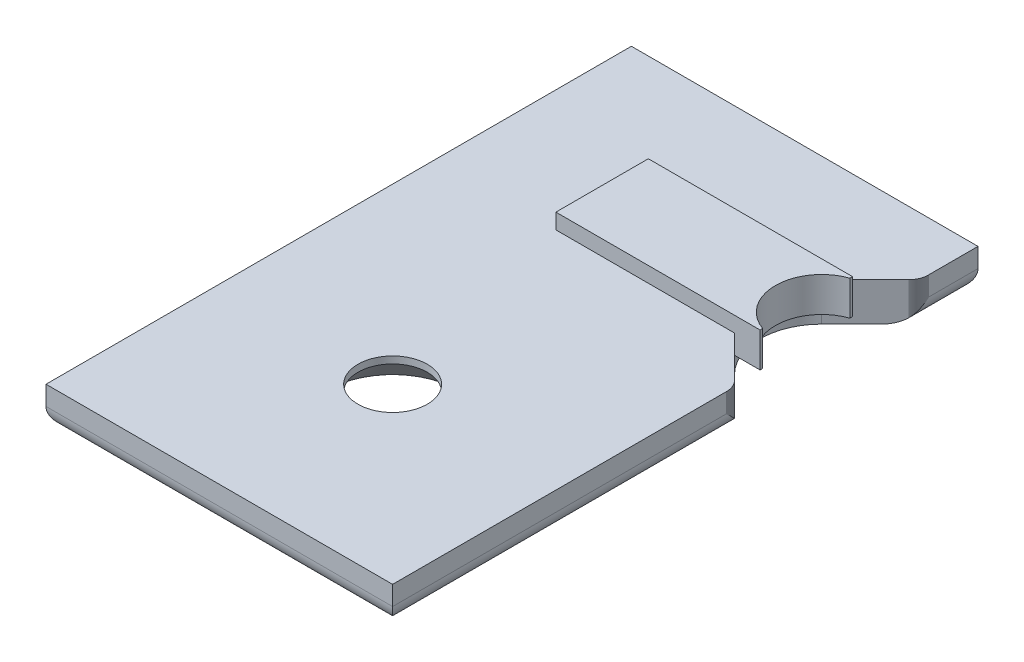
ISO-10303-21;
HEADER;
FILE_DESCRIPTION(('STEP AP214'),'2;1');
FILE_NAME('part.step','',(''),(''),'','','');
FILE_SCHEMA(('AUTOMOTIVE_DESIGN { 1 0 10303 214 1 1 1 1 }'));
ENDSEC;
DATA;
#1=APPLICATION_CONTEXT('core data for automotive mechanical design processes');
#2=APPLICATION_PROTOCOL_DEFINITION('international standard','automotive_design',2000,#1);
#3=PRODUCT_CONTEXT('',#1,'mechanical');
#4=PRODUCT('Part','Part','',(#3));
#5=PRODUCT_RELATED_PRODUCT_CATEGORY('part','',(#4));
#6=PRODUCT_DEFINITION_FORMATION('','',#4);
#7=PRODUCT_DEFINITION_CONTEXT('part definition',#1,'design');
#8=PRODUCT_DEFINITION('design','',#6,#7);
#9=PRODUCT_DEFINITION_SHAPE('','',#8);
#10=(LENGTH_UNIT() NAMED_UNIT(*) SI_UNIT(.MILLI.,.METRE.));
#11=(NAMED_UNIT(*) PLANE_ANGLE_UNIT() SI_UNIT($,.RADIAN.));
#12=(NAMED_UNIT(*) SI_UNIT($,.STERADIAN.) SOLID_ANGLE_UNIT());
#13=UNCERTAINTY_MEASURE_WITH_UNIT(LENGTH_MEASURE(1.E-05),#10,'distance_accuracy_value','');
#14=(GEOMETRIC_REPRESENTATION_CONTEXT(3) GLOBAL_UNCERTAINTY_ASSIGNED_CONTEXT((#13)) GLOBAL_UNIT_ASSIGNED_CONTEXT((#10,
#11,#12)) REPRESENTATION_CONTEXT('',''));
#15=CARTESIAN_POINT('',(0.,0.,0.));
#16=DIRECTION('',(0.,0.,1.));
#17=DIRECTION('',(1.,0.,0.));
#18=AXIS2_PLACEMENT_3D('',#15,#16,#17);
#19=CARTESIAN_POINT('',(-0.201180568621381,0.,-68.5666925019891));
#20=DIRECTION('',(0.923879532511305,0.,0.382683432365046));
#21=DIRECTION('',(0.382683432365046,0.,-0.923879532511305));
#22=AXIS2_PLACEMENT_3D('',#19,#20,#21);
#23=PLANE('',#22);
#24=DIRECTION('',(0.382683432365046,0.,-0.923879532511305));
#25=VECTOR('',#24,1.);
#26=CARTESIAN_POINT('',(-0.201180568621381,0.,-68.5666925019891));
#27=LINE('',#26,#25);
#28=CARTESIAN_POINT('',(-0.17971252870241,0.,-68.618520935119));
#29=VERTEX_POINT('',#28);
#30=CARTESIAN_POINT('',(-0.20118056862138,0.,-68.5666925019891));
#31=VERTEX_POINT('',#30);
#32=EDGE_CURVE('E574',#29,#31,#27,.F.);
#33=ORIENTED_EDGE('',*,*,#32,.T.);
#34=DIRECTION('',(0.,1.,0.));
#35=VECTOR('',#34,1.);
#36=CARTESIAN_POINT('',(-0.20118056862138,0.,-68.5666925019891));
#37=LINE('',#36,#35);
#38=CARTESIAN_POINT('',(-0.201180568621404,-3.48256257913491,-68.566692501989));
#39=VERTEX_POINT('',#38);
#40=EDGE_CURVE('E576',#39,#31,#37,.T.);
#41=ORIENTED_EDGE('',*,*,#40,.F.);
#42=CARTESIAN_POINT('',(-2.5,-2.50000000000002,-63.0168514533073));
#43=DIRECTION('',(0.923879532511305,0.,0.382683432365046));
#44=DIRECTION('',(0.382683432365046,0.,-0.923879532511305));
#45=AXIS2_PLACEMENT_3D('',#42,#43,#44);
#46=ELLIPSE('',#45,6.53281482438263,2.5);
#47=CARTESIAN_POINT('',(-0.179712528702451,-3.43073414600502,-68.6185209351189));
#48=VERTEX_POINT('',#47);
#49=EDGE_CURVE('E19',#39,#48,#46,.T.);
#50=ORIENTED_EDGE('',*,*,#49,.T.);
#51=DIRECTION('',(0.,1.,0.));
#52=VECTOR('',#51,1.);
#53=CARTESIAN_POINT('',(-0.17971252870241,0.,-68.618520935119));
#54=LINE('',#53,#52);
#55=EDGE_CURVE('E598',#29,#48,#54,.F.);
#56=ORIENTED_EDGE('',*,*,#55,.F.);
#57=EDGE_LOOP('',(#33,#41,#50,#56));
#58=FACE_BOUND('',#57,.T.);
#59=ADVANCED_FACE('F16',(#58),#23,.T.);
#60=CARTESIAN_POINT('',(-0.179712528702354,0.,-44.281479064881));
#61=DIRECTION('',(0.923879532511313,0.,-0.382683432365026));
#62=DIRECTION('',(-0.382683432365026,0.,-0.923879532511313));
#63=AXIS2_PLACEMENT_3D('',#60,#61,#62);
#64=PLANE('',#63);
#65=DIRECTION('',(-0.382683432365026,0.,-0.923879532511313));
#66=VECTOR('',#65,1.);
#67=CARTESIAN_POINT('',(-0.179712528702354,0.,-44.281479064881));
#68=LINE('',#67,#66);
#69=CARTESIAN_POINT('',(-0.201180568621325,0.,-44.333307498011));
#70=VERTEX_POINT('',#69);
#71=CARTESIAN_POINT('',(-0.179712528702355,0.,-44.281479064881));
#72=VERTEX_POINT('',#71);
#73=EDGE_CURVE('E585',#70,#72,#68,.F.);
#74=ORIENTED_EDGE('',*,*,#73,.T.);
#75=DIRECTION('',(0.,1.,0.));
#76=VECTOR('',#75,1.);
#77=CARTESIAN_POINT('',(-0.179712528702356,0.,-44.281479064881));
#78=LINE('',#77,#76);
#79=CARTESIAN_POINT('',(-0.179712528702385,-3.43073414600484,-44.2814790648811));
#80=VERTEX_POINT('',#79);
#81=EDGE_CURVE('E950',#80,#72,#78,.T.);
#82=ORIENTED_EDGE('',*,*,#81,.F.);
#83=CARTESIAN_POINT('',(-2.5,-2.50000000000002,-49.8831485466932));
#84=DIRECTION('',(0.923879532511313,0.,-0.382683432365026));
#85=DIRECTION('',(-0.382683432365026,0.,-0.923879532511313));
#86=AXIS2_PLACEMENT_3D('',#83,#84,#85);
#87=ELLIPSE('',#86,6.53281482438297,2.5);
#88=CARTESIAN_POINT('',(-0.201180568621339,-3.48256257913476,-44.333307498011));
#89=VERTEX_POINT('',#88);
#90=EDGE_CURVE('E587',#80,#89,#87,.T.);
#91=ORIENTED_EDGE('',*,*,#90,.T.);
#92=DIRECTION('',(0.,1.,0.));
#93=VECTOR('',#92,1.);
#94=CARTESIAN_POINT('',(-0.201180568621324,0.,-44.333307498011));
#95=LINE('',#94,#93);
#96=EDGE_CURVE('E943',#70,#89,#95,.F.);
#97=ORIENTED_EDGE('',*,*,#96,.F.);
#98=EDGE_LOOP('',(#74,#82,#91,#97));
#99=FACE_BOUND('',#98,.T.);
#100=ADVANCED_FACE('F988',(#99),#64,.T.);
#101=CARTESIAN_POINT('',(-0.223806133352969,0.,-68.5153588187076));
#102=DIRECTION('',(0.915060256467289,0.,0.403317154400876));
#103=DIRECTION('',(0.403317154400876,0.,-0.915060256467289));
#104=AXIS2_PLACEMENT_3D('',#101,#102,#103);
#105=PLANE('',#104);
#106=DIRECTION('',(0.403317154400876,0.,-0.915060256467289));
#107=VECTOR('',#106,1.);
#108=CARTESIAN_POINT('',(-0.223806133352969,0.,-68.5153588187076));
#109=LINE('',#108,#107);
#110=CARTESIAN_POINT('',(-0.223806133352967,0.,-68.5153588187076));
#111=VERTEX_POINT('',#110);
#112=EDGE_CURVE('E579',#31,#111,#109,.F.);
#113=ORIENTED_EDGE('',*,*,#112,.T.);
#114=DIRECTION('',(0.,1.,0.));
#115=VECTOR('',#114,1.);
#116=CARTESIAN_POINT('',(-0.223806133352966,0.,-68.5153588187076));
#117=LINE('',#116,#115);
#118=CARTESIAN_POINT('',(-0.223806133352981,-3.53389626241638,-68.5153588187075));
#119=VERTEX_POINT('',#118);
#120=EDGE_CURVE('E583',#119,#111,#117,.T.);
#121=ORIENTED_EDGE('',*,*,#120,.F.);
#122=CARTESIAN_POINT('',(-2.5,-2.50000000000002,-63.3510494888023));
#123=DIRECTION('',(0.915060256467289,0.,0.403317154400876));
#124=DIRECTION('',(0.403317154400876,0.,-0.915060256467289));
#125=AXIS2_PLACEMENT_3D('',#122,#123,#124);
#126=ELLIPSE('',#125,6.19859575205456,2.5);
#127=EDGE_CURVE('E567',#119,#39,#126,.T.);
#128=ORIENTED_EDGE('',*,*,#127,.T.);
#129=ORIENTED_EDGE('',*,*,#40,.T.);
#130=EDGE_LOOP('',(#113,#121,#128,#129));
#131=FACE_BOUND('',#130,.T.);
#132=ADVANCED_FACE('F581',(#131),#105,.T.);
#133=CARTESIAN_POINT('',(-0.17971252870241,0.,-68.618520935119));
#134=DIRECTION('',(0.932233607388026,0.,0.361857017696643));
#135=DIRECTION('',(0.361857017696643,0.,-0.932233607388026));
#136=AXIS2_PLACEMENT_3D('',#133,#134,#135);
#137=PLANE('',#136);
#138=DIRECTION('',(0.361857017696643,0.,-0.932233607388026));
#139=VECTOR('',#138,1.);
#140=CARTESIAN_POINT('',(-0.17971252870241,0.,-68.618520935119));
#141=LINE('',#140,#139);
#142=CARTESIAN_POINT('',(-0.159412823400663,0.,-68.6708180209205));
#143=VERTEX_POINT('',#142);
#144=EDGE_CURVE('E954',#143,#29,#141,.F.);
#145=ORIENTED_EDGE('',*,*,#144,.T.);
#146=ORIENTED_EDGE('',*,*,#55,.T.);
#147=CARTESIAN_POINT('',(-2.5,-2.50000000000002,-62.64088376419));
#148=DIRECTION('',(0.932233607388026,0.,0.361857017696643));
#149=DIRECTION('',(0.361857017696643,0.,-0.932233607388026));
#150=AXIS2_PLACEMENT_3D('',#147,#148,#149);
#151=ELLIPSE('',#150,6.90880617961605,2.5);
#152=CARTESIAN_POINT('',(-0.159412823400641,-3.37843706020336,-68.6708180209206));
#153=VERTEX_POINT('',#152);
#154=EDGE_CURVE('E570',#48,#153,#151,.T.);
#155=ORIENTED_EDGE('',*,*,#154,.T.);
#156=DIRECTION('',(0.,1.,0.));
#157=VECTOR('',#156,1.);
#158=CARTESIAN_POINT('',(-0.159412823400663,0.,-68.6708180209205));
#159=LINE('',#158,#157);
#160=EDGE_CURVE('E935',#143,#153,#159,.F.);
#161=ORIENTED_EDGE('',*,*,#160,.F.);
#162=EDGE_LOOP('',(#145,#146,#155,#161));
#163=FACE_BOUND('',#162,.T.);
#164=ADVANCED_FACE('F1345',(#163),#137,.T.);
#165=CARTESIAN_POINT('',(-0.159412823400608,0.,-44.2291819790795));
#166=DIRECTION('',(0.932233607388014,0.,-0.361857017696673));
#167=DIRECTION('',(-0.361857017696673,0.,-0.932233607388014));
#168=AXIS2_PLACEMENT_3D('',#165,#166,#167);
#169=PLANE('',#168);
#170=DIRECTION('',(-0.361857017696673,0.,-0.932233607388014));
#171=VECTOR('',#170,1.);
#172=CARTESIAN_POINT('',(-0.159412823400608,0.,-44.2291819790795));
#173=LINE('',#172,#171);
#174=CARTESIAN_POINT('',(-0.159412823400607,0.,-44.2291819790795));
#175=VERTEX_POINT('',#174);
#176=EDGE_CURVE('E947',#72,#175,#173,.F.);
#177=ORIENTED_EDGE('',*,*,#176,.T.);
#178=DIRECTION('',(0.,1.,0.));
#179=VECTOR('',#178,1.);
#180=CARTESIAN_POINT('',(-0.159412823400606,0.,-44.2291819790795));
#181=LINE('',#180,#179);
#182=CARTESIAN_POINT('',(-0.159412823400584,-3.37843706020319,-44.2291819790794));
#183=VERTEX_POINT('',#182);
#184=EDGE_CURVE('E934',#183,#175,#181,.T.);
#185=ORIENTED_EDGE('',*,*,#184,.F.);
#186=CARTESIAN_POINT('',(-2.5,-2.50000000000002,-50.2591162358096));
#187=DIRECTION('',(0.932233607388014,0.,-0.361857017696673));
#188=DIRECTION('',(-0.361857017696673,0.,-0.932233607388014));
#189=AXIS2_PLACEMENT_3D('',#186,#187,#188);
#190=ELLIPSE('',#189,6.90880617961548,2.5);
#191=EDGE_CURVE('E948',#183,#80,#190,.T.);
#192=ORIENTED_EDGE('',*,*,#191,.T.);
#193=ORIENTED_EDGE('',*,*,#81,.T.);
#194=EDGE_LOOP('',(#177,#185,#192,#193));
#195=FACE_BOUND('',#194,.T.);
#196=ADVANCED_FACE('F974',(#195),#169,.T.);
#197=CARTESIAN_POINT('',(-0.201180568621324,0.,-44.333307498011));
#198=DIRECTION('',(0.915060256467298,0.,-0.403317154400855));
#199=DIRECTION('',(-0.403317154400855,0.,-0.915060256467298));
#200=AXIS2_PLACEMENT_3D('',#197,#198,#199);
#201=PLANE('',#200);
#202=DIRECTION('',(-0.403317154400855,0.,-0.915060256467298));
#203=VECTOR('',#202,1.);
#204=CARTESIAN_POINT('',(-0.201180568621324,0.,-44.333307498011));
#205=LINE('',#204,#203);
#206=CARTESIAN_POINT('',(-0.223806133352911,0.,-44.3846411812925));
#207=VERTEX_POINT('',#206);
#208=EDGE_CURVE('E946',#207,#70,#205,.F.);
#209=ORIENTED_EDGE('',*,*,#208,.T.);
#210=ORIENTED_EDGE('',*,*,#96,.T.);
#211=CARTESIAN_POINT('',(-2.5,-2.50000000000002,-49.5489505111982));
#212=DIRECTION('',(0.915060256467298,0.,-0.403317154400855));
#213=DIRECTION('',(-0.403317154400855,0.,-0.915060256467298));
#214=AXIS2_PLACEMENT_3D('',#211,#212,#213);
#215=ELLIPSE('',#214,6.19859575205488,2.5);
#216=CARTESIAN_POINT('',(-0.223806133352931,-3.53389626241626,-44.3846411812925));
#217=VERTEX_POINT('',#216);
#218=EDGE_CURVE('E944',#89,#217,#215,.T.);
#219=ORIENTED_EDGE('',*,*,#218,.T.);
#220=DIRECTION('',(0.,1.,0.));
#221=VECTOR('',#220,1.);
#222=CARTESIAN_POINT('',(-0.223806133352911,0.,-44.3846411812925));
#223=LINE('',#222,#221);
#224=EDGE_CURVE('E925',#207,#217,#223,.F.);
#225=ORIENTED_EDGE('',*,*,#224,.F.);
#226=EDGE_LOOP('',(#209,#210,#219,#225));
#227=FACE_BOUND('',#226,.T.);
#228=ADVANCED_FACE('F992',(#227),#201,.T.);
#229=CARTESIAN_POINT('',(-0.247577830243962,0.,-68.46454573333));
#230=DIRECTION('',(0.905780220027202,0.,0.423747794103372));
#231=DIRECTION('',(0.423747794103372,0.,-0.905780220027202));
#232=AXIS2_PLACEMENT_3D('',#229,#230,#231);
#233=PLANE('',#232);
#234=DIRECTION('',(0.423747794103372,0.,-0.905780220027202));
#235=VECTOR('',#234,1.);
#236=CARTESIAN_POINT('',(-0.247577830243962,0.,-68.46454573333));
#237=LINE('',#236,#235);
#238=CARTESIAN_POINT('',(-0.247577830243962,0.,-68.46454573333));
#239=VERTEX_POINT('',#238);
#240=EDGE_CURVE('E940',#111,#239,#237,.F.);
#241=ORIENTED_EDGE('',*,*,#240,.T.);
#242=DIRECTION('',(0.,1.,0.));
#243=VECTOR('',#242,1.);
#244=CARTESIAN_POINT('',(-0.247577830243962,0.,-68.46454573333));
#245=LINE('',#244,#243);
#246=CARTESIAN_POINT('',(-0.247577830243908,-3.58470934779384,-68.4645457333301));
#247=VERTEX_POINT('',#246);
#248=EDGE_CURVE('E924',#247,#239,#245,.T.);
#249=ORIENTED_EDGE('',*,*,#248,.F.);
#250=CARTESIAN_POINT('',(-2.5,-2.50000000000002,-63.6498907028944));
#251=DIRECTION('',(0.905780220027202,0.,0.423747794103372));
#252=DIRECTION('',(0.423747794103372,0.,-0.905780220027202));
#253=AXIS2_PLACEMENT_3D('',#250,#251,#252);
#254=ELLIPSE('',#253,5.89973572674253,2.5);
#255=EDGE_CURVE('E941',#247,#119,#254,.T.);
#256=ORIENTED_EDGE('',*,*,#255,.T.);
#257=ORIENTED_EDGE('',*,*,#120,.T.);
#258=EDGE_LOOP('',(#241,#249,#256,#257));
#259=FACE_BOUND('',#258,.T.);
#260=ADVANCED_FACE('F1011',(#259),#233,.T.);
#261=CARTESIAN_POINT('',(-0.159412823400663,0.,-68.6708180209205));
#262=DIRECTION('',(0.940118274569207,0.,0.340848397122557));
#263=DIRECTION('',(0.340848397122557,0.,-0.940118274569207));
#264=AXIS2_PLACEMENT_3D('',#261,#262,#263);
#265=PLANE('',#264);
#266=DIRECTION('',(0.340848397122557,0.,-0.940118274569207));
#267=VECTOR('',#266,1.);
#268=CARTESIAN_POINT('',(-0.159412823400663,0.,-68.6708180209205));
#269=LINE('',#268,#267);
#270=CARTESIAN_POINT('',(-0.140291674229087,0.,-68.723557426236));
#271=VERTEX_POINT('',#270);
#272=EDGE_CURVE('E939',#271,#143,#269,.F.);
#273=ORIENTED_EDGE('',*,*,#272,.T.);
#274=ORIENTED_EDGE('',*,*,#160,.T.);
#275=CARTESIAN_POINT('',(-2.5,-2.50000000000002,-62.2150775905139));
#276=DIRECTION('',(0.940118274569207,0.,0.340848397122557));
#277=DIRECTION('',(0.340848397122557,0.,-0.940118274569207));
#278=AXIS2_PLACEMENT_3D('',#275,#276,#277);
#279=ELLIPSE('',#278,7.3346391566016,2.5);
#280=CARTESIAN_POINT('',(-0.140291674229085,-3.32569765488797,-68.723557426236));
#281=VERTEX_POINT('',#280);
#282=EDGE_CURVE('E936',#153,#281,#279,.T.);
#283=ORIENTED_EDGE('',*,*,#282,.T.);
#284=DIRECTION('',(0.,1.,0.));
#285=VECTOR('',#284,1.);
#286=CARTESIAN_POINT('',(-0.140291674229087,0.,-68.723557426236));
#287=LINE('',#286,#285);
#288=EDGE_CURVE('E915',#271,#281,#287,.F.);
#289=ORIENTED_EDGE('',*,*,#288,.F.);
#290=EDGE_LOOP('',(#273,#274,#283,#289));
#291=FACE_BOUND('',#290,.T.);
#292=ADVANCED_FACE('F1344',(#291),#265,.T.);
#293=CARTESIAN_POINT('',(-0.140291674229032,0.,-44.1764425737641));
#294=DIRECTION('',(0.940118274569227,0.,-0.340848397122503));
#295=DIRECTION('',(-0.340848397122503,0.,-0.940118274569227));
#296=AXIS2_PLACEMENT_3D('',#293,#294,#295);
#297=PLANE('',#296);
#298=DIRECTION('',(-0.340848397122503,0.,-0.940118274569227));
#299=VECTOR('',#298,1.);
#300=CARTESIAN_POINT('',(-0.140291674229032,0.,-44.1764425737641));
#301=LINE('',#300,#299);
#302=CARTESIAN_POINT('',(-0.140291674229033,0.,-44.1764425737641));
#303=VERTEX_POINT('',#302);
#304=EDGE_CURVE('E930',#175,#303,#301,.F.);
#305=ORIENTED_EDGE('',*,*,#304,.T.);
#306=DIRECTION('',(0.,1.,0.));
#307=VECTOR('',#306,1.);
#308=CARTESIAN_POINT('',(-0.140291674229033,0.,-44.1764425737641));
#309=LINE('',#308,#307);
#310=CARTESIAN_POINT('',(-0.140291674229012,-3.32569765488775,-44.176442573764));
#311=VERTEX_POINT('',#310);
#312=EDGE_CURVE('E914',#311,#303,#309,.T.);
#313=ORIENTED_EDGE('',*,*,#312,.F.);
#314=CARTESIAN_POINT('',(-2.5,-2.50000000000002,-50.6849224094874));
#315=DIRECTION('',(0.940118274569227,0.,-0.340848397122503));
#316=DIRECTION('',(-0.340848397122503,0.,-0.940118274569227));
#317=AXIS2_PLACEMENT_3D('',#314,#315,#316);
#318=ELLIPSE('',#317,7.33463915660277,2.5);
#319=EDGE_CURVE('E931',#311,#183,#318,.T.);
#320=ORIENTED_EDGE('',*,*,#319,.T.);
#321=ORIENTED_EDGE('',*,*,#184,.T.);
#322=EDGE_LOOP('',(#305,#313,#320,#321));
#323=FACE_BOUND('',#322,.T.);
#324=ADVANCED_FACE('F984',(#323),#297,.T.);
#325=CARTESIAN_POINT('',(-0.223806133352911,0.,-44.3846411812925));
#326=DIRECTION('',(0.90578022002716,0.,-0.423747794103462));
#327=DIRECTION('',(-0.423747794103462,0.,-0.90578022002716));
#328=AXIS2_PLACEMENT_3D('',#325,#326,#327);
#329=PLANE('',#328);
#330=DIRECTION('',(-0.423747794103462,0.,-0.90578022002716));
#331=VECTOR('',#330,1.);
#332=CARTESIAN_POINT('',(-0.223806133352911,0.,-44.3846411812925));
#333=LINE('',#332,#331);
#334=CARTESIAN_POINT('',(-0.247577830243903,0.,-44.43545426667));
#335=VERTEX_POINT('',#334);
#336=EDGE_CURVE('E929',#335,#207,#333,.F.);
#337=ORIENTED_EDGE('',*,*,#336,.T.);
#338=ORIENTED_EDGE('',*,*,#224,.T.);
#339=CARTESIAN_POINT('',(-2.5,-2.50000000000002,-49.2501092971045));
#340=DIRECTION('',(0.90578022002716,0.,-0.423747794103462));
#341=DIRECTION('',(-0.423747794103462,0.,-0.90578022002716));
#342=AXIS2_PLACEMENT_3D('',#339,#340,#341);
#343=ELLIPSE('',#342,5.89973572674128,2.5);
#344=CARTESIAN_POINT('',(-0.247577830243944,-3.5847093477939,-44.4354542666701));
#345=VERTEX_POINT('',#344);
#346=EDGE_CURVE('E926',#217,#345,#343,.T.);
#347=ORIENTED_EDGE('',*,*,#346,.T.);
#348=DIRECTION('',(0.,1.,0.));
#349=VECTOR('',#348,1.);
#350=CARTESIAN_POINT('',(-0.247577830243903,0.,-44.43545426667));
#351=LINE('',#350,#349);
#352=EDGE_CURVE('E905',#335,#345,#351,.F.);
#353=ORIENTED_EDGE('',*,*,#352,.F.);
#354=EDGE_LOOP('',(#337,#338,#347,#353));
#355=FACE_BOUND('',#354,.T.);
#356=ADVANCED_FACE('F994',(#355),#329,.T.);
#357=CARTESIAN_POINT('',(-0.272483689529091,0.,-68.414278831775));
#358=DIRECTION('',(0.896044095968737,0.,0.443965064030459));
#359=DIRECTION('',(0.443965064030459,0.,-0.896044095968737));
#360=AXIS2_PLACEMENT_3D('',#357,#358,#359);
#361=PLANE('',#360);
#362=DIRECTION('',(0.443965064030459,0.,-0.896044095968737));
#363=VECTOR('',#362,1.);
#364=CARTESIAN_POINT('',(-0.272483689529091,0.,-68.414278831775));
#365=LINE('',#364,#363);
#366=CARTESIAN_POINT('',(-0.272483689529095,0.,-68.414278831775));
#367=VERTEX_POINT('',#366);
#368=EDGE_CURVE('E920',#239,#367,#365,.F.);
#369=ORIENTED_EDGE('',*,*,#368,.T.);
#370=DIRECTION('',(0.,1.,0.));
#371=VECTOR('',#370,1.);
#372=CARTESIAN_POINT('',(-0.272483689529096,0.,-68.414278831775));
#373=LINE('',#372,#371);
#374=CARTESIAN_POINT('',(-0.272483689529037,-3.63497624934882,-68.4142788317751));
#375=VERTEX_POINT('',#374);
#376=EDGE_CURVE('E904',#375,#367,#373,.T.);
#377=ORIENTED_EDGE('',*,*,#376,.F.);
#378=CARTESIAN_POINT('',(-2.5,-2.50000000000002,-63.9185358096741));
#379=DIRECTION('',(0.896044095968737,0.,0.443965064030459));
#380=DIRECTION('',(0.443965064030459,0.,-0.896044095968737));
#381=AXIS2_PLACEMENT_3D('',#378,#379,#380);
#382=ELLIPSE('',#381,5.6310737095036,2.5);
#383=EDGE_CURVE('E921',#375,#247,#382,.T.);
#384=ORIENTED_EDGE('',*,*,#383,.T.);
#385=ORIENTED_EDGE('',*,*,#248,.T.);
#386=EDGE_LOOP('',(#369,#377,#384,#385));
#387=FACE_BOUND('',#386,.T.);
#388=ADVANCED_FACE('F1017',(#387),#361,.T.);
#389=CARTESIAN_POINT('',(-0.140291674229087,0.,-68.723557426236));
#390=DIRECTION('',(0.947529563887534,0.,0.319668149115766));
#391=DIRECTION('',(0.319668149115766,0.,-0.947529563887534));
#392=AXIS2_PLACEMENT_3D('',#389,#390,#391);
#393=PLANE('',#392);
#394=DIRECTION('',(0.319668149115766,0.,-0.947529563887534));
#395=VECTOR('',#394,1.);
#396=CARTESIAN_POINT('',(-0.140291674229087,0.,-68.723557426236));
#397=LINE('',#396,#395);
#398=CARTESIAN_POINT('',(-0.12235870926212,0.,-68.7767125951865));
#399=VERTEX_POINT('',#398);
#400=EDGE_CURVE('E919',#399,#271,#397,.F.);
#401=ORIENTED_EDGE('',*,*,#400,.T.);
#402=ORIENTED_EDGE('',*,*,#288,.T.);
#403=CARTESIAN_POINT('',(-2.5,-2.50000000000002,-61.7291370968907));
#404=DIRECTION('',(0.947529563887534,0.,0.319668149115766));
#405=DIRECTION('',(0.319668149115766,0.,-0.947529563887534));
#406=AXIS2_PLACEMENT_3D('',#403,#404,#405);
#407=ELLIPSE('',#406,7.82061023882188,2.5);
#408=CARTESIAN_POINT('',(-0.122358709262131,-3.27254248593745,-68.7767125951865));
#409=VERTEX_POINT('',#408);
#410=EDGE_CURVE('E916',#281,#409,#407,.T.);
#411=ORIENTED_EDGE('',*,*,#410,.T.);
#412=DIRECTION('',(0.,1.,0.));
#413=VECTOR('',#412,1.);
#414=CARTESIAN_POINT('',(-0.122358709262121,0.,-68.7767125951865));
#415=LINE('',#414,#413);
#416=EDGE_CURVE('E895',#399,#409,#415,.F.);
#417=ORIENTED_EDGE('',*,*,#416,.F.);
#418=EDGE_LOOP('',(#401,#402,#411,#417));
#419=FACE_BOUND('',#418,.T.);
#420=ADVANCED_FACE('F1339',(#419),#393,.T.);
#421=CARTESIAN_POINT('',(-0.122358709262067,0.,-44.1232874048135));
#422=DIRECTION('',(0.947529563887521,0.,-0.319668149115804));
#423=DIRECTION('',(-0.319668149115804,0.,-0.947529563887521));
#424=AXIS2_PLACEMENT_3D('',#421,#422,#423);
#425=PLANE('',#424);
#426=DIRECTION('',(-0.319668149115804,0.,-0.947529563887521));
#427=VECTOR('',#426,1.);
#428=CARTESIAN_POINT('',(-0.122358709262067,0.,-44.1232874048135));
#429=LINE('',#428,#427);
#430=CARTESIAN_POINT('',(-0.122358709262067,0.,-44.1232874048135));
#431=VERTEX_POINT('',#430);
#432=EDGE_CURVE('E910',#303,#431,#429,.F.);
#433=ORIENTED_EDGE('',*,*,#432,.T.);
#434=DIRECTION('',(0.,1.,0.));
#435=VECTOR('',#434,1.);
#436=CARTESIAN_POINT('',(-0.122358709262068,0.,-44.1232874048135));
#437=LINE('',#436,#435);
#438=CARTESIAN_POINT('',(-0.122358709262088,-3.27254248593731,-44.1232874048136));
#439=VERTEX_POINT('',#438);
#440=EDGE_CURVE('E894',#439,#431,#437,.T.);
#441=ORIENTED_EDGE('',*,*,#440,.F.);
#442=CARTESIAN_POINT('',(-2.5,-2.50000000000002,-51.1708629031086));
#443=DIRECTION('',(0.947529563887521,0.,-0.319668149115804));
#444=DIRECTION('',(-0.319668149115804,0.,-0.947529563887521));
#445=AXIS2_PLACEMENT_3D('',#442,#443,#444);
#446=ELLIPSE('',#445,7.82061023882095,2.5);
#447=EDGE_CURVE('E911',#439,#311,#446,.T.);
#448=ORIENTED_EDGE('',*,*,#447,.T.);
#449=ORIENTED_EDGE('',*,*,#312,.T.);
#450=EDGE_LOOP('',(#433,#441,#448,#449));
#451=FACE_BOUND('',#450,.T.);
#452=ADVANCED_FACE('F1698',(#451),#425,.T.);
#453=CARTESIAN_POINT('',(-0.247577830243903,0.,-44.43545426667));
#454=DIRECTION('',(0.896044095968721,0.,-0.443965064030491));
#455=DIRECTION('',(-0.443965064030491,0.,-0.896044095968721));
#456=AXIS2_PLACEMENT_3D('',#453,#454,#455);
#457=PLANE('',#456);
#458=DIRECTION('',(-0.443965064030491,0.,-0.896044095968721));
#459=VECTOR('',#458,1.);
#460=CARTESIAN_POINT('',(-0.247577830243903,0.,-44.43545426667));
#461=LINE('',#460,#459);
#462=CARTESIAN_POINT('',(-0.27248368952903,0.,-44.485721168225));
#463=VERTEX_POINT('',#462);
#464=EDGE_CURVE('E909',#463,#335,#461,.F.);
#465=ORIENTED_EDGE('',*,*,#464,.T.);
#466=ORIENTED_EDGE('',*,*,#352,.T.);
#467=CARTESIAN_POINT('',(-2.5,-2.50000000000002,-48.9814641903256));
#468=DIRECTION('',(0.896044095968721,0.,-0.443965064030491));
#469=DIRECTION('',(-0.443965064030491,0.,-0.896044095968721));
#470=AXIS2_PLACEMENT_3D('',#467,#468,#469);
#471=ELLIPSE('',#470,5.6310737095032,2.5);
#472=CARTESIAN_POINT('',(-0.272483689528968,-3.63497624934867,-44.4857211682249));
#473=VERTEX_POINT('',#472);
#474=EDGE_CURVE('E906',#345,#473,#471,.T.);
#475=ORIENTED_EDGE('',*,*,#474,.T.);
#476=DIRECTION('',(0.,1.,0.));
#477=VECTOR('',#476,1.);
#478=CARTESIAN_POINT('',(-0.272483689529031,0.,-44.485721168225));
#479=LINE('',#478,#477);
#480=EDGE_CURVE('E885',#463,#473,#479,.F.);
#481=ORIENTED_EDGE('',*,*,#480,.F.);
#482=EDGE_LOOP('',(#465,#466,#475,#481));
#483=FACE_BOUND('',#482,.T.);
#484=ADVANCED_FACE('F1695',(#483),#457,.T.);
#485=CARTESIAN_POINT('',(-0.298511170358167,0.,-68.3645834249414));
#486=DIRECTION('',(0.885856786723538,0.,0.463958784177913));
#487=DIRECTION('',(0.463958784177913,0.,-0.885856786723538));
#488=AXIS2_PLACEMENT_3D('',#485,#486,#487);
#489=PLANE('',#488);
#490=DIRECTION('',(0.463958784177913,0.,-0.885856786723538));
#491=VECTOR('',#490,1.);
#492=CARTESIAN_POINT('',(-0.298511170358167,0.,-68.3645834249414));
#493=LINE('',#492,#491);
#494=CARTESIAN_POINT('',(-0.298511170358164,0.,-68.3645834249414));
#495=VERTEX_POINT('',#494);
#496=EDGE_CURVE('E900',#367,#495,#493,.F.);
#497=ORIENTED_EDGE('',*,*,#496,.T.);
#498=DIRECTION('',(0.,1.,0.));
#499=VECTOR('',#498,1.);
#500=CARTESIAN_POINT('',(-0.298511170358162,0.,-68.3645834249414));
#501=LINE('',#500,#499);
#502=CARTESIAN_POINT('',(-0.298511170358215,-3.68467165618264,-68.3645834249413));
#503=VERTEX_POINT('',#502);
#504=EDGE_CURVE('E884',#503,#495,#501,.T.);
#505=ORIENTED_EDGE('',*,*,#504,.F.);
#506=CARTESIAN_POINT('',(-2.5,-2.50000000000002,-64.1611845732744));
#507=DIRECTION('',(0.885856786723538,0.,0.463958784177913));
#508=DIRECTION('',(0.463958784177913,0.,-0.885856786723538));
#509=AXIS2_PLACEMENT_3D('',#506,#507,#508);
#510=ELLIPSE('',#509,5.38840967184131,2.5);
#511=EDGE_CURVE('E901',#503,#375,#510,.T.);
#512=ORIENTED_EDGE('',*,*,#511,.T.);
#513=ORIENTED_EDGE('',*,*,#376,.T.);
#514=EDGE_LOOP('',(#497,#505,#512,#513));
#515=FACE_BOUND('',#514,.T.);
#516=ADVANCED_FACE('F1022',(#515),#489,.T.);
#517=CARTESIAN_POINT('',(-0.122358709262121,0.,-68.7767125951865));
#518=DIRECTION('',(0.954463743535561,0.,0.298326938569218));
#519=DIRECTION('',(0.298326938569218,0.,-0.954463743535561));
#520=AXIS2_PLACEMENT_3D('',#517,#518,#519);
#521=PLANE('',#520);
#522=DIRECTION('',(0.298326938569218,0.,-0.954463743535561));
#523=VECTOR('',#522,1.);
#524=CARTESIAN_POINT('',(-0.122358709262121,0.,-68.7767125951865));
#525=LINE('',#524,#523);
#526=CARTESIAN_POINT('',(-0.105622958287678,0.,-68.8302567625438));
#527=VERTEX_POINT('',#526);
#528=EDGE_CURVE('E899',#527,#399,#525,.F.);
#529=ORIENTED_EDGE('',*,*,#528,.T.);
#530=ORIENTED_EDGE('',*,*,#416,.T.);
#531=CARTESIAN_POINT('',(-2.5,-2.50000000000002,-61.169714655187));
#532=DIRECTION('',(0.954463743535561,0.,0.298326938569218));
#533=DIRECTION('',(0.298326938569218,0.,-0.954463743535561));
#534=AXIS2_PLACEMENT_3D('',#531,#532,#533);
#535=ELLIPSE('',#534,8.380067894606,2.5);
#536=CARTESIAN_POINT('',(-0.105622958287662,-3.21899831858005,-68.8302567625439));
#537=VERTEX_POINT('',#536);
#538=EDGE_CURVE('E896',#409,#537,#535,.T.);
#539=ORIENTED_EDGE('',*,*,#538,.T.);
#540=DIRECTION('',(0.,1.,0.));
#541=VECTOR('',#540,1.);
#542=CARTESIAN_POINT('',(-0.105622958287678,0.,-68.8302567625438));
#543=LINE('',#542,#541);
#544=EDGE_CURVE('E875',#527,#537,#543,.F.);
#545=ORIENTED_EDGE('',*,*,#544,.F.);
#546=EDGE_LOOP('',(#529,#530,#539,#545));
#547=FACE_BOUND('',#546,.T.);
#548=ADVANCED_FACE('F1688',(#547),#521,.T.);
#549=CARTESIAN_POINT('',(-0.105622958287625,0.,-44.0697432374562));
#550=DIRECTION('',(0.954463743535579,0.,-0.298326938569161));
#551=DIRECTION('',(-0.298326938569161,0.,-0.954463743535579));
#552=AXIS2_PLACEMENT_3D('',#549,#550,#551);
#553=PLANE('',#552);
#554=DIRECTION('',(-0.298326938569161,0.,-0.954463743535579));
#555=VECTOR('',#554,1.);
#556=CARTESIAN_POINT('',(-0.105622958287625,0.,-44.0697432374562));
#557=LINE('',#556,#555);
#558=CARTESIAN_POINT('',(-0.105622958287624,0.,-44.0697432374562));
#559=VERTEX_POINT('',#558);
#560=EDGE_CURVE('E890',#431,#559,#557,.F.);
#561=ORIENTED_EDGE('',*,*,#560,.T.);
#562=DIRECTION('',(0.,1.,0.));
#563=VECTOR('',#562,1.);
#564=CARTESIAN_POINT('',(-0.105622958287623,0.,-44.0697432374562));
#565=LINE('',#564,#563);
#566=CARTESIAN_POINT('',(-0.1056229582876,-3.21899831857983,-44.0697432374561));
#567=VERTEX_POINT('',#566);
#568=EDGE_CURVE('E874',#567,#559,#565,.T.);
#569=ORIENTED_EDGE('',*,*,#568,.F.);
#570=CARTESIAN_POINT('',(-2.5,-2.50000000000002,-51.7302853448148));
#571=DIRECTION('',(0.954463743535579,0.,-0.298326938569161));
#572=DIRECTION('',(-0.298326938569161,0.,-0.954463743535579));
#573=AXIS2_PLACEMENT_3D('',#570,#571,#572);
#574=ELLIPSE('',#573,8.3800678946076,2.5);
#575=EDGE_CURVE('E891',#567,#439,#574,.T.);
#576=ORIENTED_EDGE('',*,*,#575,.T.);
#577=ORIENTED_EDGE('',*,*,#440,.T.);
#578=EDGE_LOOP('',(#561,#569,#576,#577));
#579=FACE_BOUND('',#578,.T.);
#580=ADVANCED_FACE('F1684',(#579),#553,.T.);
#581=CARTESIAN_POINT('',(-0.272483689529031,0.,-44.485721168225));
#582=DIRECTION('',(0.885856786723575,0.,-0.463958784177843));
#583=DIRECTION('',(-0.463958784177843,0.,-0.885856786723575));
#584=AXIS2_PLACEMENT_3D('',#581,#582,#583);
#585=PLANE('',#584);
#586=DIRECTION('',(-0.463958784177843,0.,-0.885856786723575));
#587=VECTOR('',#586,1.);
#588=CARTESIAN_POINT('',(-0.272483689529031,0.,-44.485721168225));
#589=LINE('',#588,#587);
#590=CARTESIAN_POINT('',(-0.298511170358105,0.,-44.5354165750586));
#591=VERTEX_POINT('',#590);
#592=EDGE_CURVE('E889',#591,#463,#589,.F.);
#593=ORIENTED_EDGE('',*,*,#592,.T.);
#594=ORIENTED_EDGE('',*,*,#480,.T.);
#595=CARTESIAN_POINT('',(-2.5,-2.50000000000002,-48.7388154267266));
#596=DIRECTION('',(0.885856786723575,0.,-0.463958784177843));
#597=DIRECTION('',(-0.463958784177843,0.,-0.885856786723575));
#598=AXIS2_PLACEMENT_3D('',#595,#596,#597);
#599=ELLIPSE('',#598,5.38840967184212,2.5);
#600=CARTESIAN_POINT('',(-0.298511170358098,-3.68467165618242,-44.5354165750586));
#601=VERTEX_POINT('',#600);
#602=EDGE_CURVE('E886',#473,#601,#599,.T.);
#603=ORIENTED_EDGE('',*,*,#602,.T.);
#604=DIRECTION('',(0.,1.,0.));
#605=VECTOR('',#604,1.);
#606=CARTESIAN_POINT('',(-0.298511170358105,0.,-44.5354165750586));
#607=LINE('',#606,#605);
#608=EDGE_CURVE('E865',#591,#601,#607,.F.);
#609=ORIENTED_EDGE('',*,*,#608,.F.);
#610=EDGE_LOOP('',(#593,#594,#603,#609));
#611=FACE_BOUND('',#610,.T.);
#612=ADVANCED_FACE('F1681',(#611),#585,.T.);
#613=CARTESIAN_POINT('',(-0.325647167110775,0.,-68.315484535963));
#614=DIRECTION('',(0.875223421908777,0.,0.483718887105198));
#615=DIRECTION('',(0.483718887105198,0.,-0.875223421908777));
#616=AXIS2_PLACEMENT_3D('',#613,#614,#615);
#617=PLANE('',#616);
#618=DIRECTION('',(0.483718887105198,0.,-0.875223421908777));
#619=VECTOR('',#618,1.);
#620=CARTESIAN_POINT('',(-0.325647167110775,0.,-68.315484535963));
#621=LINE('',#620,#619);
#622=CARTESIAN_POINT('',(-0.325647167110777,0.,-68.315484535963));
#623=VERTEX_POINT('',#622);
#624=EDGE_CURVE('E880',#495,#623,#621,.F.);
#625=ORIENTED_EDGE('',*,*,#624,.T.);
#626=DIRECTION('',(0.,1.,0.));
#627=VECTOR('',#626,1.);
#628=CARTESIAN_POINT('',(-0.325647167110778,0.,-68.315484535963));
#629=LINE('',#628,#627);
#630=CARTESIAN_POINT('',(-0.325647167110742,-3.73377054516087,-68.3154845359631));
#631=VERTEX_POINT('',#630);
#632=EDGE_CURVE('E864',#631,#623,#629,.T.);
#633=ORIENTED_EDGE('',*,*,#632,.F.);
#634=CARTESIAN_POINT('',(-2.5,-2.50000000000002,-64.3812893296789));
#635=DIRECTION('',(0.875223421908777,0.,0.483718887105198));
#636=DIRECTION('',(0.483718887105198,0.,-0.875223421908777));
#637=AXIS2_PLACEMENT_3D('',#634,#635,#636);
#638=ELLIPSE('',#637,5.16829106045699,2.5);
#639=EDGE_CURVE('E881',#631,#503,#638,.T.);
#640=ORIENTED_EDGE('',*,*,#639,.T.);
#641=ORIENTED_EDGE('',*,*,#504,.T.);
#642=EDGE_LOOP('',(#625,#633,#640,#641));
#643=FACE_BOUND('',#642,.T.);
#644=ADVANCED_FACE('F1025',(#643),#617,.T.);
#645=CARTESIAN_POINT('',(-0.105622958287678,0.,-68.8302567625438));
#646=DIRECTION('',(0.960917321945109,0.,0.276835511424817));
#647=DIRECTION('',(0.276835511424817,0.,-0.960917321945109));
#648=AXIS2_PLACEMENT_3D('',#645,#646,#647);
#649=PLANE('',#648);
#650=DIRECTION('',(0.276835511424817,0.,-0.960917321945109));
#651=VECTOR('',#650,1.);
#652=CARTESIAN_POINT('',(-0.105622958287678,0.,-68.8302567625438));
#653=LINE('',#652,#651);
#654=CARTESIAN_POINT('',(-0.090092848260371,0.,-68.8841629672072));
#655=VERTEX_POINT('',#654);
#656=EDGE_CURVE('E879',#655,#527,#653,.F.);
#657=ORIENTED_EDGE('',*,*,#656,.T.);
#658=ORIENTED_EDGE('',*,*,#544,.T.);
#659=CARTESIAN_POINT('',(-2.5,-2.50000000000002,-60.5191901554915));
#660=DIRECTION('',(0.960917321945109,0.,0.276835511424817));
#661=DIRECTION('',(0.276835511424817,0.,-0.960917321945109));
#662=AXIS2_PLACEMENT_3D('',#659,#660,#661);
#663=ELLIPSE('',#662,9.03063334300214,2.5);
#664=CARTESIAN_POINT('',(-0.0900928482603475,-3.16509211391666,-68.8841629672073));
#665=VERTEX_POINT('',#664);
#666=EDGE_CURVE('E876',#537,#665,#663,.T.);
#667=ORIENTED_EDGE('',*,*,#666,.T.);
#668=DIRECTION('',(0.,1.,0.));
#669=VECTOR('',#668,1.);
#670=CARTESIAN_POINT('',(-0.090092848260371,0.,-68.8841629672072));
#671=LINE('',#670,#669);
#672=EDGE_CURVE('E855',#655,#665,#671,.F.);
#673=ORIENTED_EDGE('',*,*,#672,.F.);
#674=EDGE_LOOP('',(#657,#658,#667,#673));
#675=FACE_BOUND('',#674,.T.);
#676=ADVANCED_FACE('F1674',(#675),#649,.T.);
#677=CARTESIAN_POINT('',(-0.090092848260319,0.,-44.0158370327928));
#678=DIRECTION('',(0.960917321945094,0.,-0.27683551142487));
#679=DIRECTION('',(-0.27683551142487,0.,-0.960917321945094));
#680=AXIS2_PLACEMENT_3D('',#677,#678,#679);
#681=PLANE('',#680);
#682=DIRECTION('',(-0.27683551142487,0.,-0.960917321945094));
#683=VECTOR('',#682,1.);
#684=CARTESIAN_POINT('',(-0.090092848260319,0.,-44.0158370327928));
#685=LINE('',#684,#683);
#686=CARTESIAN_POINT('',(-0.0900928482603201,0.,-44.0158370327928));
#687=VERTEX_POINT('',#686);
#688=EDGE_CURVE('E870',#559,#687,#685,.F.);
#689=ORIENTED_EDGE('',*,*,#688,.T.);
#690=DIRECTION('',(0.,1.,0.));
#691=VECTOR('',#690,1.);
#692=CARTESIAN_POINT('',(-0.0900928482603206,0.,-44.0158370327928));
#693=LINE('',#692,#691);
#694=CARTESIAN_POINT('',(-0.0900928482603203,-3.16509211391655,-44.0158370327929));
#695=VERTEX_POINT('',#694);
#696=EDGE_CURVE('E854',#695,#687,#693,.T.);
#697=ORIENTED_EDGE('',*,*,#696,.F.);
#698=CARTESIAN_POINT('',(-2.5,-2.50000000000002,-52.380809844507));
#699=DIRECTION('',(0.960917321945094,0.,-0.27683551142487));
#700=DIRECTION('',(-0.27683551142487,0.,-0.960917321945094));
#701=AXIS2_PLACEMENT_3D('',#698,#699,#700);
#702=ELLIPSE('',#701,9.03063334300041,2.5);
#703=EDGE_CURVE('E871',#695,#567,#702,.T.);
#704=ORIENTED_EDGE('',*,*,#703,.T.);
#705=ORIENTED_EDGE('',*,*,#568,.T.);
#706=EDGE_LOOP('',(#689,#697,#704,#705));
#707=FACE_BOUND('',#706,.T.);
#708=ADVANCED_FACE('F1670',(#707),#681,.T.);
#709=CARTESIAN_POINT('',(-0.298511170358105,0.,-44.5354165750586));
#710=DIRECTION('',(0.875223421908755,0.,-0.483718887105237));
#711=DIRECTION('',(-0.483718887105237,0.,-0.875223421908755));
#712=AXIS2_PLACEMENT_3D('',#709,#710,#711);
#713=PLANE('',#712);
#714=DIRECTION('',(-0.483718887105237,0.,-0.875223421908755));
#715=VECTOR('',#714,1.);
#716=CARTESIAN_POINT('',(-0.298511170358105,0.,-44.5354165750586));
#717=LINE('',#716,#715);
#718=CARTESIAN_POINT('',(-0.325647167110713,0.,-44.584515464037));
#719=VERTEX_POINT('',#718);
#720=EDGE_CURVE('E869',#719,#591,#717,.F.);
#721=ORIENTED_EDGE('',*,*,#720,.T.);
#722=ORIENTED_EDGE('',*,*,#608,.T.);
#723=CARTESIAN_POINT('',(-2.5,-2.50000000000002,-48.5187106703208));
#724=DIRECTION('',(0.875223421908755,0.,-0.483718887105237));
#725=DIRECTION('',(-0.483718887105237,0.,-0.875223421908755));
#726=AXIS2_PLACEMENT_3D('',#723,#724,#725);
#727=ELLIPSE('',#726,5.16829106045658,2.5);
#728=CARTESIAN_POINT('',(-0.325647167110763,-3.73377054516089,-44.5845154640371));
#729=VERTEX_POINT('',#728);
#730=EDGE_CURVE('E866',#601,#729,#727,.T.);
#731=ORIENTED_EDGE('',*,*,#730,.T.);
#732=DIRECTION('',(0.,1.,0.));
#733=VECTOR('',#732,1.);
#734=CARTESIAN_POINT('',(-0.325647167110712,0.,-44.584515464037));
#735=LINE('',#734,#733);
#736=EDGE_CURVE('E845',#719,#729,#735,.F.);
#737=ORIENTED_EDGE('',*,*,#736,.F.);
#738=EDGE_LOOP('',(#721,#722,#731,#737));
#739=FACE_BOUND('',#738,.T.);
#740=ADVANCED_FACE('F1667',(#739),#713,.T.);
#741=CARTESIAN_POINT('',(-0.353878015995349,0.,-68.2670068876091));
#742=DIRECTION('',(0.864149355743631,0.,0.50323542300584));
#743=DIRECTION('',(0.50323542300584,0.,-0.864149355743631));
#744=AXIS2_PLACEMENT_3D('',#741,#742,#743);
#745=PLANE('',#744);
#746=DIRECTION('',(0.50323542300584,0.,-0.864149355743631));
#747=VECTOR('',#746,1.);
#748=CARTESIAN_POINT('',(-0.353878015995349,0.,-68.2670068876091));
#749=LINE('',#748,#747);
#750=CARTESIAN_POINT('',(-0.353878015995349,0.,-68.2670068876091));
#751=VERTEX_POINT('',#750);
#752=EDGE_CURVE('E860',#623,#751,#749,.F.);
#753=ORIENTED_EDGE('',*,*,#752,.T.);
#754=DIRECTION('',(0.,1.,0.));
#755=VECTOR('',#754,1.);
#756=CARTESIAN_POINT('',(-0.353878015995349,0.,-68.2670068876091));
#757=LINE('',#756,#755);
#758=CARTESIAN_POINT('',(-0.353878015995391,-3.78224819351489,-68.267006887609));
#759=VERTEX_POINT('',#758);
#760=EDGE_CURVE('E844',#759,#751,#757,.T.);
#761=ORIENTED_EDGE('',*,*,#760,.F.);
#762=CARTESIAN_POINT('',(-2.5,-2.50000000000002,-64.5817139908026));
#763=DIRECTION('',(0.864149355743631,0.,0.50323542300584));
#764=DIRECTION('',(0.50323542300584,0.,-0.864149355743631));
#765=AXIS2_PLACEMENT_3D('',#762,#763,#764);
#766=ELLIPSE('',#765,4.96785378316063,2.5);
#767=EDGE_CURVE('E861',#759,#631,#766,.T.);
#768=ORIENTED_EDGE('',*,*,#767,.T.);
#769=ORIENTED_EDGE('',*,*,#632,.T.);
#770=EDGE_LOOP('',(#753,#761,#768,#769));
#771=FACE_BOUND('',#770,.T.);
#772=ADVANCED_FACE('F1031',(#771),#745,.T.);
#773=CARTESIAN_POINT('',(-0.090092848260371,0.,-68.8841629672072));
#774=DIRECTION('',(0.966887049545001,0.,0.255204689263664));
#775=DIRECTION('',(0.255204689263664,0.,-0.966887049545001));
#776=AXIS2_PLACEMENT_3D('',#773,#774,#775);
#777=PLANE('',#776);
#778=DIRECTION('',(0.255204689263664,0.,-0.966887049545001));
#779=VECTOR('',#778,1.);
#780=CARTESIAN_POINT('',(-0.090092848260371,0.,-68.8841629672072));
#781=LINE('',#780,#779);
#782=CARTESIAN_POINT('',(-0.075776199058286,0.,-68.9384040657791));
#783=VERTEX_POINT('',#782);
#784=EDGE_CURVE('E859',#783,#655,#781,.F.);
#785=ORIENTED_EDGE('',*,*,#784,.T.);
#786=ORIENTED_EDGE('',*,*,#672,.T.);
#787=CARTESIAN_POINT('',(-2.5,-2.50000000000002,-59.7538134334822));
#788=DIRECTION('',(0.966887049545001,0.,0.255204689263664));
#789=DIRECTION('',(0.255204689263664,0.,-0.966887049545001));
#790=AXIS2_PLACEMENT_3D('',#787,#788,#789);
#791=ELLIPSE('',#790,9.79605824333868,2.5);
#792=CARTESIAN_POINT('',(-0.0757761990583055,-3.11085101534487,-68.9384040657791));
#793=VERTEX_POINT('',#792);
#794=EDGE_CURVE('E856',#665,#793,#791,.T.);
#795=ORIENTED_EDGE('',*,*,#794,.T.);
#796=DIRECTION('',(0.,1.,0.));
#797=VECTOR('',#796,1.);
#798=CARTESIAN_POINT('',(-0.075776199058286,0.,-68.9384040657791));
#799=LINE('',#798,#797);
#800=EDGE_CURVE('E835',#783,#793,#799,.F.);
#801=ORIENTED_EDGE('',*,*,#800,.F.);
#802=EDGE_LOOP('',(#785,#786,#795,#801));
#803=FACE_BOUND('',#802,.T.);
#804=ADVANCED_FACE('F1660',(#803),#777,.T.);
#805=CARTESIAN_POINT('',(-0.075776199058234,0.,-43.9615959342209));
#806=DIRECTION('',(0.966887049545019,0.,-0.255204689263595));
#807=DIRECTION('',(-0.255204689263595,0.,-0.966887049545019));
#808=AXIS2_PLACEMENT_3D('',#805,#806,#807);
#809=PLANE('',#808);
#810=DIRECTION('',(-0.255204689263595,0.,-0.966887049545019));
#811=VECTOR('',#810,1.);
#812=CARTESIAN_POINT('',(-0.075776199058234,0.,-43.9615959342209));
#813=LINE('',#812,#811);
#814=CARTESIAN_POINT('',(-0.075776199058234,0.,-43.9615959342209));
#815=VERTEX_POINT('',#814);
#816=EDGE_CURVE('E850',#687,#815,#813,.F.);
#817=ORIENTED_EDGE('',*,*,#816,.T.);
#818=DIRECTION('',(0.,1.,0.));
#819=VECTOR('',#818,1.);
#820=CARTESIAN_POINT('',(-0.0757761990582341,0.,-43.9615959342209));
#821=LINE('',#820,#819);
#822=CARTESIAN_POINT('',(-0.0757761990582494,-3.11085101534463,-43.9615959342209));
#823=VERTEX_POINT('',#822);
#824=EDGE_CURVE('E834',#823,#815,#821,.T.);
#825=ORIENTED_EDGE('',*,*,#824,.F.);
#826=CARTESIAN_POINT('',(-2.5,-2.50000000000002,-53.1461865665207));
#827=DIRECTION('',(0.966887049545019,0.,-0.255204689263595));
#828=DIRECTION('',(-0.255204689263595,0.,-0.966887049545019));
#829=AXIS2_PLACEMENT_3D('',#826,#827,#828);
#830=ELLIPSE('',#829,9.79605824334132,2.5);
#831=EDGE_CURVE('E851',#823,#695,#830,.T.);
#832=ORIENTED_EDGE('',*,*,#831,.T.);
#833=ORIENTED_EDGE('',*,*,#696,.T.);
#834=EDGE_LOOP('',(#817,#825,#832,#833));
#835=FACE_BOUND('',#834,.T.);
#836=ADVANCED_FACE('F1656',(#835),#809,.T.);
#837=CARTESIAN_POINT('',(-0.325647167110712,0.,-44.584515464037));
#838=DIRECTION('',(0.86414935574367,0.,-0.503235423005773));
#839=DIRECTION('',(-0.503235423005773,0.,-0.86414935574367));
#840=AXIS2_PLACEMENT_3D('',#837,#838,#839);
#841=PLANE('',#840);
#842=DIRECTION('',(-0.503235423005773,0.,-0.86414935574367));
#843=VECTOR('',#842,1.);
#844=CARTESIAN_POINT('',(-0.325647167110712,0.,-44.584515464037));
#845=LINE('',#844,#843);
#846=CARTESIAN_POINT('',(-0.353878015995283,0.,-44.6329931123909));
#847=VERTEX_POINT('',#846);
#848=EDGE_CURVE('E849',#847,#719,#845,.F.);
#849=ORIENTED_EDGE('',*,*,#848,.T.);
#850=ORIENTED_EDGE('',*,*,#736,.T.);
#851=CARTESIAN_POINT('',(-2.5,-2.50000000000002,-48.3182860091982));
#852=DIRECTION('',(0.86414935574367,0.,-0.503235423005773));
#853=DIRECTION('',(-0.503235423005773,0.,-0.86414935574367));
#854=AXIS2_PLACEMENT_3D('',#851,#852,#853);
#855=ELLIPSE('',#854,4.96785378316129,2.5);
#856=CARTESIAN_POINT('',(-0.353878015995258,-3.78224819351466,-44.6329931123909));
#857=VERTEX_POINT('',#856);
#858=EDGE_CURVE('E846',#729,#857,#855,.T.);
#859=ORIENTED_EDGE('',*,*,#858,.T.);
#860=DIRECTION('',(0.,1.,0.));
#861=VECTOR('',#860,1.);
#862=CARTESIAN_POINT('',(-0.353878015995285,0.,-44.6329931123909));
#863=LINE('',#862,#861);
#864=EDGE_CURVE('E825',#847,#857,#863,.F.);
#865=ORIENTED_EDGE('',*,*,#864,.F.);
#866=EDGE_LOOP('',(#849,#850,#859,#865));
#867=FACE_BOUND('',#866,.T.);
#868=ADVANCED_FACE('F1653',(#867),#841,.T.);
#869=CARTESIAN_POINT('',(-0.383189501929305,0.,-68.2191748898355));
#870=DIRECTION('',(0.852640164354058,0.,0.522498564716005));
#871=DIRECTION('',(0.522498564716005,0.,-0.852640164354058));
#872=AXIS2_PLACEMENT_3D('',#869,#870,#871);
#873=PLANE('',#872);
#874=DIRECTION('',(0.522498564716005,0.,-0.852640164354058));
#875=VECTOR('',#874,1.);
#876=CARTESIAN_POINT('',(-0.383189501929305,0.,-68.2191748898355));
#877=LINE('',#876,#875);
#878=CARTESIAN_POINT('',(-0.38318950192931,0.,-68.2191748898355));
#879=VERTEX_POINT('',#878);
#880=EDGE_CURVE('E840',#751,#879,#877,.F.);
#881=ORIENTED_EDGE('',*,*,#880,.T.);
#882=DIRECTION('',(0.,1.,0.));
#883=VECTOR('',#882,1.);
#884=CARTESIAN_POINT('',(-0.383189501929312,0.,-68.2191748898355));
#885=LINE('',#884,#883);
#886=CARTESIAN_POINT('',(-0.383189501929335,-3.83008019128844,-68.2191748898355));
#887=VERTEX_POINT('',#886);
#888=EDGE_CURVE('E824',#887,#879,#885,.T.);
#889=ORIENTED_EDGE('',*,*,#888,.F.);
#890=CARTESIAN_POINT('',(-2.5,-2.50000000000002,-64.7648541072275));
#891=DIRECTION('',(0.852640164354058,0.,0.522498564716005));
#892=DIRECTION('',(0.522498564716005,0.,-0.852640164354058));
#893=AXIS2_PLACEMENT_3D('',#890,#891,#892);
#894=ELLIPSE('',#893,4.78470213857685,2.5);
#895=EDGE_CURVE('E841',#887,#759,#894,.T.);
#896=ORIENTED_EDGE('',*,*,#895,.T.);
#897=ORIENTED_EDGE('',*,*,#760,.T.);
#898=EDGE_LOOP('',(#881,#889,#896,#897));
#899=FACE_BOUND('',#898,.T.);
#900=ADVANCED_FACE('F1037',(#899),#873,.T.);
#901=CARTESIAN_POINT('',(-0.075776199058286,0.,-68.9384040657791));
#902=DIRECTION('',(0.97236992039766,0.,0.233445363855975));
#903=DIRECTION('',(0.233445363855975,0.,-0.97236992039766));
#904=AXIS2_PLACEMENT_3D('',#901,#902,#903);
#905=PLANE('',#904);
#906=DIRECTION('',(0.233445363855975,0.,-0.97236992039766));
#907=VECTOR('',#906,1.);
#908=CARTESIAN_POINT('',(-0.075776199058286,0.,-68.9384040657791));
#909=LINE('',#908,#907);
#910=CARTESIAN_POINT('',(-0.0626802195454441,0.,-68.9929527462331));
#911=VERTEX_POINT('',#910);
#912=EDGE_CURVE('E839',#911,#783,#909,.F.);
#913=ORIENTED_EDGE('',*,*,#912,.T.);
#914=ORIENTED_EDGE('',*,*,#800,.T.);
#915=CARTESIAN_POINT('',(-2.5,-2.50000000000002,-58.8407852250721));
#916=DIRECTION('',(0.97236992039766,0.,0.233445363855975));
#917=DIRECTION('',(0.233445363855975,0.,-0.97236992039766));
#918=AXIS2_PLACEMENT_3D('',#915,#916,#917);
#919=ELLIPSE('',#918,10.7091439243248,2.5);
#920=CARTESIAN_POINT('',(-0.0626802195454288,-3.05630233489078,-68.9929527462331));
#921=VERTEX_POINT('',#920);
#922=EDGE_CURVE('E836',#793,#921,#919,.T.);
#923=ORIENTED_EDGE('',*,*,#922,.T.);
#924=DIRECTION('',(0.,1.,0.));
#925=VECTOR('',#924,1.);
#926=CARTESIAN_POINT('',(-0.062680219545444,0.,-68.9929527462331));
#927=LINE('',#926,#925);
#928=EDGE_CURVE('E815',#911,#921,#927,.F.);
#929=ORIENTED_EDGE('',*,*,#928,.F.);
#930=EDGE_LOOP('',(#913,#914,#923,#929));
#931=FACE_BOUND('',#930,.T.);
#932=ADVANCED_FACE('F1646',(#931),#905,.T.);
#933=CARTESIAN_POINT('',(-0.062680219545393,0.,-43.9070472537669));
#934=DIRECTION('',(0.972369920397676,0.,-0.233445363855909));
#935=DIRECTION('',(-0.233445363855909,0.,-0.972369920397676));
#936=AXIS2_PLACEMENT_3D('',#933,#934,#935);
#937=PLANE('',#936);
#938=DIRECTION('',(-0.233445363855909,0.,-0.972369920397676));
#939=VECTOR('',#938,1.);
#940=CARTESIAN_POINT('',(-0.062680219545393,0.,-43.9070472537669));
#941=LINE('',#940,#939);
#942=CARTESIAN_POINT('',(-0.0626802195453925,0.,-43.9070472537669));
#943=VERTEX_POINT('',#942);
#944=EDGE_CURVE('E830',#815,#943,#941,.F.);
#945=ORIENTED_EDGE('',*,*,#944,.T.);
#946=DIRECTION('',(0.,1.,0.));
#947=VECTOR('',#946,1.);
#948=CARTESIAN_POINT('',(-0.0626802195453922,0.,-43.9070472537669));
#949=LINE('',#948,#947);
#950=CARTESIAN_POINT('',(-0.0626802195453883,-3.05630233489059,-43.9070472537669));
#951=VERTEX_POINT('',#950);
#952=EDGE_CURVE('E814',#951,#943,#949,.T.);
#953=ORIENTED_EDGE('',*,*,#952,.F.);
#954=CARTESIAN_POINT('',(-2.5,-2.50000000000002,-54.0592147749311));
#955=DIRECTION('',(0.972369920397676,0.,-0.233445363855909));
#956=DIRECTION('',(-0.233445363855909,0.,-0.972369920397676));
#957=AXIS2_PLACEMENT_3D('',#954,#955,#956);
#958=ELLIPSE('',#957,10.7091439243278,2.5);
#959=EDGE_CURVE('E831',#951,#823,#958,.T.);
#960=ORIENTED_EDGE('',*,*,#959,.T.);
#961=ORIENTED_EDGE('',*,*,#824,.T.);
#962=EDGE_LOOP('',(#945,#953,#960,#961));
#963=FACE_BOUND('',#962,.T.);
#964=ADVANCED_FACE('F1642',(#963),#937,.T.);
#965=CARTESIAN_POINT('',(-0.353878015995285,0.,-44.6329931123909));
#966=DIRECTION('',(0.852640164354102,0.,-0.522498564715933));
#967=DIRECTION('',(-0.522498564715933,0.,-0.852640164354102));
#968=AXIS2_PLACEMENT_3D('',#965,#966,#967);
#969=PLANE('',#968);
#970=DIRECTION('',(-0.522498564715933,0.,-0.852640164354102));
#971=VECTOR('',#970,1.);
#972=CARTESIAN_POINT('',(-0.353878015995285,0.,-44.6329931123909));
#973=LINE('',#972,#971);
#974=CARTESIAN_POINT('',(-0.38318950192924,0.,-44.6808251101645));
#975=VERTEX_POINT('',#974);
#976=EDGE_CURVE('E829',#975,#847,#973,.F.);
#977=ORIENTED_EDGE('',*,*,#976,.T.);
#978=ORIENTED_EDGE('',*,*,#864,.T.);
#979=CARTESIAN_POINT('',(-2.5,-2.50000000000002,-48.1351458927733));
#980=DIRECTION('',(0.852640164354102,0.,-0.522498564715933));
#981=DIRECTION('',(-0.522498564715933,0.,-0.852640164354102));
#982=AXIS2_PLACEMENT_3D('',#979,#980,#981);
#983=ELLIPSE('',#982,4.7847021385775,2.5);
#984=CARTESIAN_POINT('',(-0.383189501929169,-3.83008019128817,-44.6808251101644));
#985=VERTEX_POINT('',#984);
#986=EDGE_CURVE('E826',#857,#985,#983,.T.);
#987=ORIENTED_EDGE('',*,*,#986,.T.);
#988=DIRECTION('',(0.,1.,0.));
#989=VECTOR('',#988,1.);
#990=CARTESIAN_POINT('',(-0.38318950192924,0.,-44.6808251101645));
#991=LINE('',#990,#989);
#992=EDGE_CURVE('E805',#975,#985,#991,.F.);
#993=ORIENTED_EDGE('',*,*,#992,.F.);
#994=EDGE_LOOP('',(#977,#978,#987,#993));
#995=FACE_BOUND('',#994,.T.);
#996=ADVANCED_FACE('F1639',(#995),#969,.T.);
#997=CARTESIAN_POINT('',(-0.41356686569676,0.,-68.1720126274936));
#998=DIRECTION('',(0.840701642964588,0.,0.541498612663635));
#999=DIRECTION('',(0.541498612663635,0.,-0.840701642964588));
#1000=AXIS2_PLACEMENT_3D('',#997,#998,#999);
#1001=PLANE('',#1000);
#1002=DIRECTION('',(0.541498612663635,0.,-0.840701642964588));
#1003=VECTOR('',#1002,1.);
#1004=CARTESIAN_POINT('',(-0.41356686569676,0.,-68.1720126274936));
#1005=LINE('',#1004,#1003);
#1006=CARTESIAN_POINT('',(-0.413566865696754,0.,-68.1720126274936));
#1007=VERTEX_POINT('',#1006);
#1008=EDGE_CURVE('E820',#879,#1007,#1005,.F.);
#1009=ORIENTED_EDGE('',*,*,#1008,.T.);
#1010=DIRECTION('',(0.,1.,0.));
#1011=VECTOR('',#1010,1.);
#1012=CARTESIAN_POINT('',(-0.413566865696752,0.,-68.1720126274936));
#1013=LINE('',#1012,#1011);
#1014=CARTESIAN_POINT('',(-0.413566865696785,-3.87724245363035,-68.1720126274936));
#1015=VERTEX_POINT('',#1014);
#1016=EDGE_CURVE('E804',#1015,#1007,#1013,.T.);
#1017=ORIENTED_EDGE('',*,*,#1016,.F.);
#1018=CARTESIAN_POINT('',(-2.5,-2.50000000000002,-64.9327286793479));
#1019=DIRECTION('',(0.840701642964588,0.,0.541498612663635));
#1020=DIRECTION('',(0.541498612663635,0.,-0.840701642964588));
#1021=AXIS2_PLACEMENT_3D('',#1018,#1019,#1020);
#1022=ELLIPSE('',#1021,4.61681699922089,2.5);
#1023=EDGE_CURVE('E821',#1015,#887,#1022,.T.);
#1024=ORIENTED_EDGE('',*,*,#1023,.T.);
#1025=ORIENTED_EDGE('',*,*,#888,.T.);
#1026=EDGE_LOOP('',(#1009,#1017,#1024,#1025));
#1027=FACE_BOUND('',#1026,.T.);
#1028=ADVANCED_FACE('F1042',(#1027),#1001,.T.);
#1029=CARTESIAN_POINT('',(-0.062680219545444,0.,-68.9929527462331));
#1030=DIRECTION('',(0.977363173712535,0.,0.211568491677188));
#1031=DIRECTION('',(0.211568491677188,0.,-0.977363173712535));
#1032=AXIS2_PLACEMENT_3D('',#1029,#1030,#1031);
#1033=PLANE('',#1032);
#1034=DIRECTION('',(0.211568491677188,0.,-0.977363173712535));
#1035=VECTOR('',#1034,1.);
#1036=CARTESIAN_POINT('',(-0.062680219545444,0.,-68.9929527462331));
#1037=LINE('',#1036,#1035);
#1038=CARTESIAN_POINT('',(-0.0508115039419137,0.,-69.0477815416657));
#1039=VERTEX_POINT('',#1038);
#1040=EDGE_CURVE('E819',#1039,#911,#1037,.F.);
#1041=ORIENTED_EDGE('',*,*,#1040,.T.);
#1042=ORIENTED_EDGE('',*,*,#928,.T.);
#1043=CARTESIAN_POINT('',(-2.5,-2.50000000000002,-57.7334945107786));
#1044=DIRECTION('',(0.977363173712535,0.,0.211568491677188));
#1045=DIRECTION('',(0.211568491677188,0.,-0.977363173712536));
#1046=AXIS2_PLACEMENT_3D('',#1043,#1044,#1045);
#1047=ELLIPSE('',#1046,11.8165043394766,2.5);
#1048=CARTESIAN_POINT('',(-0.0508115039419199,-3.00147353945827,-69.0477815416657));
#1049=VERTEX_POINT('',#1048);
#1050=EDGE_CURVE('E816',#921,#1049,#1047,.T.);
#1051=ORIENTED_EDGE('',*,*,#1050,.T.);
#1052=DIRECTION('',(0.,1.,0.));
#1053=VECTOR('',#1052,1.);
#1054=CARTESIAN_POINT('',(-0.050811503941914,0.,-69.0477815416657));
#1055=LINE('',#1054,#1053);
#1056=EDGE_CURVE('E795',#1039,#1049,#1055,.F.);
#1057=ORIENTED_EDGE('',*,*,#1056,.F.);
#1058=EDGE_LOOP('',(#1041,#1042,#1051,#1057));
#1059=FACE_BOUND('',#1058,.T.);
#1060=ADVANCED_FACE('F1632',(#1059),#1033,.T.);
#1061=CARTESIAN_POINT('',(-0.050811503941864,0.,-43.8522184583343));
#1062=DIRECTION('',(0.977363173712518,0.,-0.21156849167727));
#1063=DIRECTION('',(-0.21156849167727,0.,-0.977363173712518));
#1064=AXIS2_PLACEMENT_3D('',#1061,#1062,#1063);
#1065=PLANE('',#1064);
#1066=DIRECTION('',(-0.21156849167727,0.,-0.977363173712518));
#1067=VECTOR('',#1066,1.);
#1068=CARTESIAN_POINT('',(-0.050811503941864,0.,-43.8522184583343));
#1069=LINE('',#1068,#1067);
#1070=CARTESIAN_POINT('',(-0.0508115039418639,0.,-43.8522184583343));
#1071=VERTEX_POINT('',#1070);
#1072=EDGE_CURVE('E810',#943,#1071,#1069,.F.);
#1073=ORIENTED_EDGE('',*,*,#1072,.T.);
#1074=DIRECTION('',(0.,1.,0.));
#1075=VECTOR('',#1074,1.);
#1076=CARTESIAN_POINT('',(-0.0508115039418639,0.,-43.8522184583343));
#1077=LINE('',#1076,#1075);
#1078=CARTESIAN_POINT('',(-0.0508115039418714,-3.00147353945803,-43.8522184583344));
#1079=VERTEX_POINT('',#1078);
#1080=EDGE_CURVE('E794',#1079,#1071,#1077,.T.);
#1081=ORIENTED_EDGE('',*,*,#1080,.F.);
#1082=CARTESIAN_POINT('',(-2.5,-2.50000000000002,-55.1665054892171));
#1083=DIRECTION('',(0.977363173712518,0.,-0.21156849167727));
#1084=DIRECTION('',(-0.21156849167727,0.,-0.977363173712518));
#1085=AXIS2_PLACEMENT_3D('',#1082,#1083,#1084);
#1086=ELLIPSE('',#1085,11.816504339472,2.5);
#1087=EDGE_CURVE('E811',#1079,#951,#1086,.T.);
#1088=ORIENTED_EDGE('',*,*,#1087,.T.);
#1089=ORIENTED_EDGE('',*,*,#952,.T.);
#1090=EDGE_LOOP('',(#1073,#1081,#1088,#1089));
#1091=FACE_BOUND('',#1090,.T.);
#1092=ADVANCED_FACE('F1628',(#1091),#1065,.T.);
#1093=CARTESIAN_POINT('',(-0.38318950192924,0.,-44.6808251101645));
#1094=DIRECTION('',(0.840701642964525,0.,-0.541498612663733));
#1095=DIRECTION('',(-0.541498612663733,0.,-0.840701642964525));
#1096=AXIS2_PLACEMENT_3D('',#1093,#1094,#1095);
#1097=PLANE('',#1096);
#1098=DIRECTION('',(-0.541498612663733,0.,-0.840701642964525));
#1099=VECTOR('',#1098,1.);
#1100=CARTESIAN_POINT('',(-0.38318950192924,0.,-44.6808251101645));
#1101=LINE('',#1100,#1099);
#1102=CARTESIAN_POINT('',(-0.413566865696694,0.,-44.7279873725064));
#1103=VERTEX_POINT('',#1102);
#1104=EDGE_CURVE('E809',#1103,#975,#1101,.F.);
#1105=ORIENTED_EDGE('',*,*,#1104,.T.);
#1106=ORIENTED_EDGE('',*,*,#992,.T.);
#1107=CARTESIAN_POINT('',(-2.5,-2.50000000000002,-47.9672713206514));
#1108=DIRECTION('',(0.840701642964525,0.,-0.541498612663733));
#1109=DIRECTION('',(-0.541498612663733,0.,-0.840701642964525));
#1110=AXIS2_PLACEMENT_3D('',#1107,#1108,#1109);
#1111=ELLIPSE('',#1110,4.61681699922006,2.5);
#1112=CARTESIAN_POINT('',(-0.413566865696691,-3.8772424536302,-44.7279873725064));
#1113=VERTEX_POINT('',#1112);
#1114=EDGE_CURVE('E806',#985,#1113,#1111,.T.);
#1115=ORIENTED_EDGE('',*,*,#1114,.T.);
#1116=DIRECTION('',(0.,1.,0.));
#1117=VECTOR('',#1116,1.);
#1118=CARTESIAN_POINT('',(-0.413566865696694,0.,-44.7279873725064));
#1119=LINE('',#1118,#1117);
#1120=EDGE_CURVE('E785',#1103,#1113,#1119,.F.);
#1121=ORIENTED_EDGE('',*,*,#1120,.F.);
#1122=EDGE_LOOP('',(#1105,#1106,#1115,#1121));
#1123=FACE_BOUND('',#1122,.T.);
#1124=ADVANCED_FACE('F1625',(#1123),#1097,.T.);
#1125=CARTESIAN_POINT('',(-0.444994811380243,0.,-68.1255438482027));
#1126=DIRECTION('',(0.828339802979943,0.,0.560225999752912));
#1127=DIRECTION('',(0.560225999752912,0.,-0.828339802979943));
#1128=AXIS2_PLACEMENT_3D('',#1125,#1126,#1127);
#1129=PLANE('',#1128);
#1130=DIRECTION('',(0.560225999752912,0.,-0.828339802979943));
#1131=VECTOR('',#1130,1.);
#1132=CARTESIAN_POINT('',(-0.444994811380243,0.,-68.1255438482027));
#1133=LINE('',#1132,#1131);
#1134=CARTESIAN_POINT('',(-0.444994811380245,0.,-68.1255438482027));
#1135=VERTEX_POINT('',#1134);
#1136=EDGE_CURVE('E800',#1007,#1135,#1133,.F.);
#1137=ORIENTED_EDGE('',*,*,#1136,.T.);
#1138=DIRECTION('',(0.,1.,0.));
#1139=VECTOR('',#1138,1.);
#1140=CARTESIAN_POINT('',(-0.444994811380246,0.,-68.1255438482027));
#1141=LINE('',#1140,#1139);
#1142=CARTESIAN_POINT('',(-0.444994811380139,-3.92371123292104,-68.1255438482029));
#1143=VERTEX_POINT('',#1142);
#1144=EDGE_CURVE('E784',#1143,#1135,#1141,.T.);
#1145=ORIENTED_EDGE('',*,*,#1144,.F.);
#1146=CARTESIAN_POINT('',(-2.5,-2.50000000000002,-65.0870511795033));
#1147=DIRECTION('',(0.828339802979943,0.,0.560225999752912));
#1148=DIRECTION('',(0.560225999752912,0.,-0.828339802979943));
#1149=AXIS2_PLACEMENT_3D('',#1146,#1147,#1148);
#1150=ELLIPSE('',#1149,4.46248478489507,2.5);
#1151=EDGE_CURVE('E801',#1143,#1015,#1150,.T.);
#1152=ORIENTED_EDGE('',*,*,#1151,.T.);
#1153=ORIENTED_EDGE('',*,*,#1016,.T.);
#1154=EDGE_LOOP('',(#1137,#1145,#1152,#1153));
#1155=FACE_BOUND('',#1154,.T.);
#1156=ADVANCED_FACE('F1048',(#1155),#1129,.T.);
#1157=CARTESIAN_POINT('',(-0.050811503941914,0.,-69.0477815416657));
#1158=DIRECTION('',(0.981864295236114,0.,0.189585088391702));
#1159=DIRECTION('',(0.189585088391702,0.,-0.981864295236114));
#1160=AXIS2_PLACEMENT_3D('',#1157,#1158,#1159);
#1161=PLANE('',#1160);
#1162=DIRECTION('',(0.189585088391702,0.,-0.981864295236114));
#1163=VECTOR('',#1162,1.);
#1164=CARTESIAN_POINT('',(-0.050811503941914,0.,-69.0477815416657));
#1165=LINE('',#1164,#1163);
#1166=CARTESIAN_POINT('',(-0.0401760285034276,0.,-69.1028628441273));
#1167=VERTEX_POINT('',#1166);
#1168=EDGE_CURVE('E799',#1167,#1039,#1165,.F.);
#1169=ORIENTED_EDGE('',*,*,#1168,.T.);
#1170=ORIENTED_EDGE('',*,*,#1056,.T.);
#1171=CARTESIAN_POINT('',(-2.5,-2.50000000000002,-56.3633939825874));
#1172=DIRECTION('',(0.981864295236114,0.,0.189585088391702));
#1173=DIRECTION('',(0.189585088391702,0.,-0.981864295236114));
#1174=AXIS2_PLACEMENT_3D('',#1171,#1172,#1173);
#1175=ELLIPSE('',#1174,13.1866911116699,2.5);
#1176=CARTESIAN_POINT('',(-0.0401760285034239,-2.94639223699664,-69.1028628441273));
#1177=VERTEX_POINT('',#1176);
#1178=EDGE_CURVE('E796',#1049,#1177,#1175,.T.);
#1179=ORIENTED_EDGE('',*,*,#1178,.T.);
#1180=DIRECTION('',(0.,1.,0.));
#1181=VECTOR('',#1180,1.);
#1182=CARTESIAN_POINT('',(-0.040176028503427,0.,-69.1028628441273));
#1183=LINE('',#1182,#1181);
#1184=EDGE_CURVE('E775',#1167,#1177,#1183,.F.);
#1185=ORIENTED_EDGE('',*,*,#1184,.F.);
#1186=EDGE_LOOP('',(#1169,#1170,#1179,#1185));
#1187=FACE_BOUND('',#1186,.T.);
#1188=ADVANCED_FACE('F1618',(#1187),#1161,.T.);
#1189=CARTESIAN_POINT('',(-0.040176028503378,0.,-43.7971371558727));
#1190=DIRECTION('',(0.981864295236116,0.,-0.189585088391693));
#1191=DIRECTION('',(-0.189585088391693,0.,-0.981864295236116));
#1192=AXIS2_PLACEMENT_3D('',#1189,#1190,#1191);
#1193=PLANE('',#1192);
#1194=DIRECTION('',(-0.189585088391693,0.,-0.981864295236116));
#1195=VECTOR('',#1194,1.);
#1196=CARTESIAN_POINT('',(-0.040176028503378,0.,-43.7971371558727));
#1197=LINE('',#1196,#1195);
#1198=CARTESIAN_POINT('',(-0.0401760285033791,0.,-43.7971371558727));
#1199=VERTEX_POINT('',#1198);
#1200=EDGE_CURVE('E790',#1071,#1199,#1197,.F.);
#1201=ORIENTED_EDGE('',*,*,#1200,.T.);
#1202=DIRECTION('',(0.,1.,0.));
#1203=VECTOR('',#1202,1.);
#1204=CARTESIAN_POINT('',(-0.0401760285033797,0.,-43.7971371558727));
#1205=LINE('',#1204,#1203);
#1206=CARTESIAN_POINT('',(-0.0401760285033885,-2.94639223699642,-43.7971371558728));
#1207=VERTEX_POINT('',#1206);
#1208=EDGE_CURVE('E774',#1207,#1199,#1205,.T.);
#1209=ORIENTED_EDGE('',*,*,#1208,.F.);
#1210=CARTESIAN_POINT('',(-2.5,-2.50000000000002,-56.5366060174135));
#1211=DIRECTION('',(0.981864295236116,0.,-0.189585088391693));
#1212=DIRECTION('',(-0.189585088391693,0.,-0.981864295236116));
#1213=AXIS2_PLACEMENT_3D('',#1210,#1211,#1212);
#1214=ELLIPSE('',#1213,13.1866911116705,2.5);
#1215=EDGE_CURVE('E791',#1207,#1079,#1214,.T.);
#1216=ORIENTED_EDGE('',*,*,#1215,.T.);
#1217=ORIENTED_EDGE('',*,*,#1080,.T.);
#1218=EDGE_LOOP('',(#1201,#1209,#1216,#1217));
#1219=FACE_BOUND('',#1218,.T.);
#1220=ADVANCED_FACE('F1614',(#1219),#1193,.T.);
#1221=CARTESIAN_POINT('',(-0.413566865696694,0.,-44.7279873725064));
#1222=DIRECTION('',(0.828339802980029,0.,-0.560225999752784));
#1223=DIRECTION('',(-0.560225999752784,0.,-0.828339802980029));
#1224=AXIS2_PLACEMENT_3D('',#1221,#1222,#1223);
#1225=PLANE('',#1224);
#1226=DIRECTION('',(-0.560225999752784,0.,-0.828339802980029));
#1227=VECTOR('',#1226,1.);
#1228=CARTESIAN_POINT('',(-0.413566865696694,0.,-44.7279873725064));
#1229=LINE('',#1228,#1227);
#1230=CARTESIAN_POINT('',(-0.444994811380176,0.,-44.7744561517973));
#1231=VERTEX_POINT('',#1230);
#1232=EDGE_CURVE('E789',#1231,#1103,#1229,.F.);
#1233=ORIENTED_EDGE('',*,*,#1232,.T.);
#1234=ORIENTED_EDGE('',*,*,#1120,.T.);
#1235=CARTESIAN_POINT('',(-2.5,-2.50000000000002,-47.8129488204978));
#1236=DIRECTION('',(0.828339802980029,0.,-0.560225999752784));
#1237=DIRECTION('',(-0.560225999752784,0.,-0.828339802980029));
#1238=AXIS2_PLACEMENT_3D('',#1235,#1236,#1237);
#1239=ELLIPSE('',#1238,4.46248478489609,2.5);
#1240=CARTESIAN_POINT('',(-0.444994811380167,-3.92371123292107,-44.7744561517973));
#1241=VERTEX_POINT('',#1240);
#1242=EDGE_CURVE('E786',#1113,#1241,#1239,.T.);
#1243=ORIENTED_EDGE('',*,*,#1242,.T.);
#1244=DIRECTION('',(0.,1.,0.));
#1245=VECTOR('',#1244,1.);
#1246=CARTESIAN_POINT('',(-0.444994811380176,0.,-44.7744561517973));
#1247=LINE('',#1246,#1245);
#1248=EDGE_CURVE('E765',#1231,#1241,#1247,.F.);
#1249=ORIENTED_EDGE('',*,*,#1248,.F.);
#1250=EDGE_LOOP('',(#1233,#1234,#1243,#1249));
#1251=FACE_BOUND('',#1250,.T.);
#1252=ADVANCED_FACE('F1611',(#1251),#1225,.T.);
#1253=CARTESIAN_POINT('',(-0.477457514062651,0.,-68.0797919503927));
#1254=DIRECTION('',(0.815560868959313,0.,0.578671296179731));
#1255=DIRECTION('',(0.578671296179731,0.,-0.815560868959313));
#1256=AXIS2_PLACEMENT_3D('',#1253,#1254,#1255);
#1257=PLANE('',#1256);
#1258=DIRECTION('',(0.578671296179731,0.,-0.815560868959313));
#1259=VECTOR('',#1258,1.);
#1260=CARTESIAN_POINT('',(-0.477457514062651,0.,-68.0797919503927));
#1261=LINE('',#1260,#1259);
#1262=CARTESIAN_POINT('',(-0.477457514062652,0.,-68.0797919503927));
#1263=VERTEX_POINT('',#1262);
#1264=EDGE_CURVE('E780',#1135,#1263,#1261,.F.);
#1265=ORIENTED_EDGE('',*,*,#1264,.T.);
#1266=DIRECTION('',(0.,1.,0.));
#1267=VECTOR('',#1266,1.);
#1268=CARTESIAN_POINT('',(-0.477457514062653,0.,-68.0797919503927));
#1269=LINE('',#1268,#1267);
#1270=CARTESIAN_POINT('',(-0.477457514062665,-3.96946313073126,-68.0797919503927));
#1271=VERTEX_POINT('',#1270);
#1272=EDGE_CURVE('E764',#1271,#1263,#1269,.T.);
#1273=ORIENTED_EDGE('',*,*,#1272,.F.);
#1274=CARTESIAN_POINT('',(-2.5,-2.50000000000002,-65.2292850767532));
#1275=DIRECTION('',(0.815560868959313,0.,0.578671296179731));
#1276=DIRECTION('',(0.578671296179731,0.,-0.815560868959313));
#1277=AXIS2_PLACEMENT_3D('',#1274,#1275,#1276);
#1278=ELLIPSE('',#1277,4.32024193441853,2.5);
#1279=EDGE_CURVE('E781',#1271,#1143,#1278,.T.);
#1280=ORIENTED_EDGE('',*,*,#1279,.T.);
#1281=ORIENTED_EDGE('',*,*,#1144,.T.);
#1282=EDGE_LOOP('',(#1265,#1273,#1280,#1281));
#1283=FACE_BOUND('',#1282,.T.);
#1284=ADVANCED_FACE('F1054',(#1283),#1257,.T.);
#1285=CARTESIAN_POINT('',(-0.040176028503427,0.,-69.1028628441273));
#1286=DIRECTION('',(0.985871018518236,0.,0.167506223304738));
#1287=DIRECTION('',(0.167506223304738,0.,-0.985871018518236));
#1288=AXIS2_PLACEMENT_3D('',#1285,#1286,#1287);
#1289=PLANE('',#1288);
#1290=DIRECTION('',(0.167506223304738,0.,-0.985871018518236));
#1291=VECTOR('',#1290,1.);
#1292=CARTESIAN_POINT('',(-0.040176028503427,0.,-69.1028628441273));
#1293=LINE('',#1292,#1291);
#1294=CARTESIAN_POINT('',(-0.0307791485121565,0.,-69.1581689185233));
#1295=VERTEX_POINT('',#1294);
#1296=EDGE_CURVE('E779',#1295,#1167,#1293,.F.);
#1297=ORIENTED_EDGE('',*,*,#1296,.T.);
#1298=ORIENTED_EDGE('',*,*,#1184,.T.);
#1299=CARTESIAN_POINT('',(-2.5,-2.50000000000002,-54.6253758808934));
#1300=DIRECTION('',(0.985871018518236,0.,0.167506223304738));
#1301=DIRECTION('',(0.167506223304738,0.,-0.985871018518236));
#1302=AXIS2_PLACEMENT_3D('',#1299,#1300,#1301);
#1303=ELLIPSE('',#1302,14.9248186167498,2.5);
#1304=CARTESIAN_POINT('',(-0.0307791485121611,-2.89108616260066,-69.1581689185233));
#1305=VERTEX_POINT('',#1304);
#1306=EDGE_CURVE('E776',#1177,#1305,#1303,.T.);
#1307=ORIENTED_EDGE('',*,*,#1306,.T.);
#1308=DIRECTION('',(0.,1.,0.));
#1309=VECTOR('',#1308,1.);
#1310=CARTESIAN_POINT('',(-0.030779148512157,0.,-69.1581689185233));
#1311=LINE('',#1310,#1309);
#1312=EDGE_CURVE('E755',#1295,#1305,#1311,.F.);
#1313=ORIENTED_EDGE('',*,*,#1312,.F.);
#1314=EDGE_LOOP('',(#1297,#1298,#1307,#1313));
#1315=FACE_BOUND('',#1314,.T.);
#1316=ADVANCED_FACE('F1604',(#1315),#1289,.T.);
#1317=CARTESIAN_POINT('',(-0.030779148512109,0.,-43.7418310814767));
#1318=DIRECTION('',(0.985871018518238,0.,-0.167506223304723));
#1319=DIRECTION('',(-0.167506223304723,0.,-0.985871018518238));
#1320=AXIS2_PLACEMENT_3D('',#1317,#1318,#1319);
#1321=PLANE('',#1320);
#1322=DIRECTION('',(-0.167506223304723,0.,-0.985871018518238));
#1323=VECTOR('',#1322,1.);
#1324=CARTESIAN_POINT('',(-0.030779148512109,0.,-43.7418310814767));
#1325=LINE('',#1324,#1323);
#1326=CARTESIAN_POINT('',(-0.0307791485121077,0.,-43.7418310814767));
#1327=VERTEX_POINT('',#1326);
#1328=EDGE_CURVE('E770',#1199,#1327,#1325,.F.);
#1329=ORIENTED_EDGE('',*,*,#1328,.T.);
#1330=DIRECTION('',(0.,1.,0.));
#1331=VECTOR('',#1330,1.);
#1332=CARTESIAN_POINT('',(-0.030779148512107,0.,-43.7418310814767));
#1333=LINE('',#1332,#1331);
#1334=CARTESIAN_POINT('',(-0.0307791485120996,-2.89108616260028,-43.7418310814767));
#1335=VERTEX_POINT('',#1334);
#1336=EDGE_CURVE('E754',#1335,#1327,#1333,.T.);
#1337=ORIENTED_EDGE('',*,*,#1336,.F.);
#1338=CARTESIAN_POINT('',(-2.5,-2.50000000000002,-58.2746241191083));
#1339=DIRECTION('',(0.985871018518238,0.,-0.167506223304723));
#1340=DIRECTION('',(-0.167506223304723,0.,-0.985871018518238));
#1341=AXIS2_PLACEMENT_3D('',#1338,#1339,#1340);
#1342=ELLIPSE('',#1341,14.9248186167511,2.5);
#1343=EDGE_CURVE('E771',#1335,#1207,#1342,.T.);
#1344=ORIENTED_EDGE('',*,*,#1343,.T.);
#1345=ORIENTED_EDGE('',*,*,#1208,.T.);
#1346=EDGE_LOOP('',(#1329,#1337,#1344,#1345));
#1347=FACE_BOUND('',#1346,.T.);
#1348=ADVANCED_FACE('F1600',(#1347),#1321,.T.);
#1349=CARTESIAN_POINT('',(-0.444994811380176,0.,-44.7744561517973));
#1350=DIRECTION('',(0.815560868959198,0.,-0.578671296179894));
#1351=DIRECTION('',(-0.578671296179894,0.,-0.815560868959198));
#1352=AXIS2_PLACEMENT_3D('',#1349,#1350,#1351);
#1353=PLANE('',#1352);
#1354=DIRECTION('',(-0.578671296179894,0.,-0.815560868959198));
#1355=VECTOR('',#1354,1.);
#1356=CARTESIAN_POINT('',(-0.444994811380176,0.,-44.7744561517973));
#1357=LINE('',#1356,#1355);
#1358=CARTESIAN_POINT('',(-0.477457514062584,0.,-44.8202080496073));
#1359=VERTEX_POINT('',#1358);
#1360=EDGE_CURVE('E769',#1359,#1231,#1357,.F.);
#1361=ORIENTED_EDGE('',*,*,#1360,.T.);
#1362=ORIENTED_EDGE('',*,*,#1248,.T.);
#1363=CARTESIAN_POINT('',(-2.5,-2.50000000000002,-47.6707149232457));
#1364=DIRECTION('',(0.815560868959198,0.,-0.578671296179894));
#1365=DIRECTION('',(-0.578671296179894,0.,-0.815560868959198));
#1366=AXIS2_PLACEMENT_3D('',#1363,#1364,#1365);
#1367=ELLIPSE('',#1366,4.32024193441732,2.5);
#1368=CARTESIAN_POINT('',(-0.477457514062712,-3.96946313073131,-44.8202080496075));
#1369=VERTEX_POINT('',#1368);
#1370=EDGE_CURVE('E766',#1241,#1369,#1367,.T.);
#1371=ORIENTED_EDGE('',*,*,#1370,.T.);
#1372=DIRECTION('',(0.,1.,0.));
#1373=VECTOR('',#1372,1.);
#1374=CARTESIAN_POINT('',(-0.477457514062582,0.,-44.8202080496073));
#1375=LINE('',#1374,#1373);
#1376=EDGE_CURVE('E745',#1359,#1369,#1375,.F.);
#1377=ORIENTED_EDGE('',*,*,#1376,.F.);
#1378=EDGE_LOOP('',(#1361,#1362,#1371,#1377));
#1379=FACE_BOUND('',#1378,.T.);
#1380=ADVANCED_FACE('F1597',(#1379),#1353,.T.);
#1381=CARTESIAN_POINT('',(-0.510938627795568,0.,-68.0347799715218));
#1382=DIRECTION('',(0.802371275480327,0.,0.596825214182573));
#1383=DIRECTION('',(0.596825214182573,0.,-0.802371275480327));
#1384=AXIS2_PLACEMENT_3D('',#1381,#1382,#1383);
#1385=PLANE('',#1384);
#1386=DIRECTION('',(0.596825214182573,0.,-0.802371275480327));
#1387=VECTOR('',#1386,1.);
#1388=CARTESIAN_POINT('',(-0.510938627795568,0.,-68.0347799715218));
#1389=LINE('',#1388,#1387);
#1390=CARTESIAN_POINT('',(-0.510938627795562,0.,-68.0347799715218));
#1391=VERTEX_POINT('',#1390);
#1392=EDGE_CURVE('E760',#1263,#1391,#1389,.F.);
#1393=ORIENTED_EDGE('',*,*,#1392,.T.);
#1394=DIRECTION('',(0.,1.,0.));
#1395=VECTOR('',#1394,1.);
#1396=CARTESIAN_POINT('',(-0.51093862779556,0.,-68.0347799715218));
#1397=LINE('',#1396,#1395);
#1398=CARTESIAN_POINT('',(-0.510938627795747,-4.01447510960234,-68.0347799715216));
#1399=VERTEX_POINT('',#1398);
#1400=EDGE_CURVE('E744',#1399,#1391,#1397,.T.);
#1401=ORIENTED_EDGE('',*,*,#1400,.F.);
#1402=CARTESIAN_POINT('',(-2.5,-2.50000000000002,-65.360687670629));
#1403=DIRECTION('',(0.802371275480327,0.,0.596825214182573));
#1404=DIRECTION('',(0.596825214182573,0.,-0.802371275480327));
#1405=AXIS2_PLACEMENT_3D('',#1402,#1403,#1404);
#1406=ELLIPSE('',#1405,4.18883106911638,2.5);
#1407=EDGE_CURVE('E761',#1399,#1271,#1406,.T.);
#1408=ORIENTED_EDGE('',*,*,#1407,.T.);
#1409=ORIENTED_EDGE('',*,*,#1272,.T.);
#1410=EDGE_LOOP('',(#1393,#1401,#1408,#1409));
#1411=FACE_BOUND('',#1410,.T.);
#1412=ADVANCED_FACE('F1059',(#1411),#1385,.T.);
#1413=CARTESIAN_POINT('',(-0.030779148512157,0.,-69.1581689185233));
#1414=DIRECTION('',(0.989381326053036,0.,0.145343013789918));
#1415=DIRECTION('',(0.145343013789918,0.,-0.989381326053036));
#1416=AXIS2_PLACEMENT_3D('',#1413,#1414,#1415);
#1417=PLANE('',#1416);
#1418=DIRECTION('',(0.145343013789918,0.,-0.989381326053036));
#1419=VECTOR('',#1418,1.);
#1420=CARTESIAN_POINT('',(-0.030779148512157,0.,-69.1581689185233));
#1421=LINE('',#1420,#1419);
#1422=CARTESIAN_POINT('',(-0.0226255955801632,0.,-69.2136719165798));
#1423=VERTEX_POINT('',#1422);
#1424=EDGE_CURVE('E759',#1423,#1295,#1421,.F.);
#1425=ORIENTED_EDGE('',*,*,#1424,.T.);
#1426=ORIENTED_EDGE('',*,*,#1312,.T.);
#1427=CARTESIAN_POINT('',(-2.5,-2.50000000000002,-52.3496486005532));
#1428=DIRECTION('',(0.989381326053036,0.,0.145343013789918));
#1429=DIRECTION('',(0.145343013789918,0.,-0.989381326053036));
#1430=AXIS2_PLACEMENT_3D('',#1427,#1428,#1429);
#1431=ELLIPSE('',#1430,17.2006891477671,2.5);
#1432=CARTESIAN_POINT('',(-0.0226255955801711,-2.83558316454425,-69.2136719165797));
#1433=VERTEX_POINT('',#1432);
#1434=EDGE_CURVE('E756',#1305,#1433,#1431,.T.);
#1435=ORIENTED_EDGE('',*,*,#1434,.T.);
#1436=DIRECTION('',(0.,1.,0.));
#1437=VECTOR('',#1436,1.);
#1438=CARTESIAN_POINT('',(-0.022625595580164,0.,-69.2136719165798));
#1439=LINE('',#1438,#1437);
#1440=EDGE_CURVE('E735',#1423,#1433,#1439,.F.);
#1441=ORIENTED_EDGE('',*,*,#1440,.F.);
#1442=EDGE_LOOP('',(#1425,#1426,#1435,#1441));
#1443=FACE_BOUND('',#1442,.T.);
#1444=ADVANCED_FACE('F1590',(#1443),#1417,.T.);
#1445=CARTESIAN_POINT('',(-0.022625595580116,0.,-43.6863280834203));
#1446=DIRECTION('',(0.989381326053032,0.,-0.145343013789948));
#1447=DIRECTION('',(-0.145343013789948,0.,-0.989381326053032));
#1448=AXIS2_PLACEMENT_3D('',#1445,#1446,#1447);
#1449=PLANE('',#1448);
#1450=DIRECTION('',(-0.145343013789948,0.,-0.989381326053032));
#1451=VECTOR('',#1450,1.);
#1452=CARTESIAN_POINT('',(-0.022625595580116,0.,-43.6863280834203));
#1453=LINE('',#1452,#1451);
#1454=CARTESIAN_POINT('',(-0.0226255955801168,0.,-43.6863280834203));
#1455=VERTEX_POINT('',#1454);
#1456=EDGE_CURVE('E750',#1327,#1455,#1453,.F.);
#1457=ORIENTED_EDGE('',*,*,#1456,.T.);
#1458=DIRECTION('',(0.,1.,0.));
#1459=VECTOR('',#1458,1.);
#1460=CARTESIAN_POINT('',(-0.0226255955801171,0.,-43.6863280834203));
#1461=LINE('',#1460,#1459);
#1462=CARTESIAN_POINT('',(-0.0226255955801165,-2.83558316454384,-43.6863280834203));
#1463=VERTEX_POINT('',#1462);
#1464=EDGE_CURVE('E734',#1463,#1455,#1461,.T.);
#1465=ORIENTED_EDGE('',*,*,#1464,.F.);
#1466=CARTESIAN_POINT('',(-2.5,-2.50000000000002,-60.5503513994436));
#1467=DIRECTION('',(0.989381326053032,0.,-0.145343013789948));
#1468=DIRECTION('',(-0.145343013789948,0.,-0.989381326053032));
#1469=AXIS2_PLACEMENT_3D('',#1466,#1467,#1468);
#1470=ELLIPSE('',#1469,17.2006891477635,2.5);
#1471=EDGE_CURVE('E751',#1463,#1335,#1470,.T.);
#1472=ORIENTED_EDGE('',*,*,#1471,.T.);
#1473=ORIENTED_EDGE('',*,*,#1336,.T.);
#1474=EDGE_LOOP('',(#1457,#1465,#1472,#1473));
#1475=FACE_BOUND('',#1474,.T.);
#1476=ADVANCED_FACE('F1586',(#1475),#1449,.T.);
#1477=CARTESIAN_POINT('',(-0.477457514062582,0.,-44.8202080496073));
#1478=DIRECTION('',(0.802371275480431,0.,-0.596825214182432));
#1479=DIRECTION('',(-0.596825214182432,0.,-0.802371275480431));
#1480=AXIS2_PLACEMENT_3D('',#1477,#1478,#1479);
#1481=PLANE('',#1480);
#1482=DIRECTION('',(-0.596825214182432,0.,-0.802371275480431));
#1483=VECTOR('',#1482,1.);
#1484=CARTESIAN_POINT('',(-0.477457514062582,0.,-44.8202080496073));
#1485=LINE('',#1484,#1483);
#1486=CARTESIAN_POINT('',(-0.510938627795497,0.,-44.8652200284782));
#1487=VERTEX_POINT('',#1486);
#1488=EDGE_CURVE('E749',#1487,#1359,#1485,.F.);
#1489=ORIENTED_EDGE('',*,*,#1488,.T.);
#1490=ORIENTED_EDGE('',*,*,#1376,.T.);
#1491=CARTESIAN_POINT('',(-2.5,-2.50000000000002,-47.5393123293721));
#1492=DIRECTION('',(0.802371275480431,0.,-0.596825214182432));
#1493=DIRECTION('',(-0.596825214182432,0.,-0.802371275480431));
#1494=AXIS2_PLACEMENT_3D('',#1491,#1492,#1493);
#1495=ELLIPSE('',#1494,4.18883106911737,2.5);
#1496=CARTESIAN_POINT('',(-0.510938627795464,-4.01447510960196,-44.8652200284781));
#1497=VERTEX_POINT('',#1496);
#1498=EDGE_CURVE('E746',#1369,#1497,#1495,.T.);
#1499=ORIENTED_EDGE('',*,*,#1498,.T.);
#1500=DIRECTION('',(0.,1.,0.));
#1501=VECTOR('',#1500,1.);
#1502=CARTESIAN_POINT('',(-0.510938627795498,0.,-44.8652200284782));
#1503=LINE('',#1502,#1501);
#1504=EDGE_CURVE('E725',#1487,#1497,#1503,.F.);
#1505=ORIENTED_EDGE('',*,*,#1504,.F.);
#1506=EDGE_LOOP('',(#1489,#1490,#1499,#1505));
#1507=FACE_BOUND('',#1506,.T.);
#1508=ADVANCED_FACE('F1583',(#1507),#1481,.T.);
#1509=CARTESIAN_POINT('',(-0.545421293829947,0.,-67.990530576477));
#1510=DIRECTION('',(0.788777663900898,0.,0.614678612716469));
#1511=DIRECTION('',(0.614678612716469,0.,-0.788777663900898));
#1512=AXIS2_PLACEMENT_3D('',#1509,#1510,#1511);
#1513=PLANE('',#1512);
#1514=DIRECTION('',(0.614678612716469,0.,-0.788777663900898));
#1515=VECTOR('',#1514,1.);
#1516=CARTESIAN_POINT('',(-0.545421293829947,0.,-67.990530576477));
#1517=LINE('',#1516,#1515);
#1518=CARTESIAN_POINT('',(-0.545421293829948,0.,-67.990530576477));
#1519=VERTEX_POINT('',#1518);
#1520=EDGE_CURVE('E740',#1391,#1519,#1517,.F.);
#1521=ORIENTED_EDGE('',*,*,#1520,.T.);
#1522=DIRECTION('',(0.,1.,0.));
#1523=VECTOR('',#1522,1.);
#1524=CARTESIAN_POINT('',(-0.545421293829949,0.,-67.990530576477));
#1525=LINE('',#1524,#1523);
#1526=CARTESIAN_POINT('',(-0.545421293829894,-4.05872450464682,-67.9905305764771));
#1527=VERTEX_POINT('',#1526);
#1528=EDGE_CURVE('E724',#1527,#1519,#1525,.T.);
#1529=ORIENTED_EDGE('',*,*,#1528,.F.);
#1530=CARTESIAN_POINT('',(-2.5,-2.50000000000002,-65.4823450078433));
#1531=DIRECTION('',(0.788777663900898,0.,0.614678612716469));
#1532=DIRECTION('',(0.614678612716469,0.,-0.788777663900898));
#1533=AXIS2_PLACEMENT_3D('',#1530,#1531,#1532);
#1534=ELLIPSE('',#1533,4.06716607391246,2.5);
#1535=EDGE_CURVE('E741',#1527,#1399,#1534,.T.);
#1536=ORIENTED_EDGE('',*,*,#1535,.T.);
#1537=ORIENTED_EDGE('',*,*,#1400,.T.);
#1538=EDGE_LOOP('',(#1521,#1529,#1536,#1537));
#1539=FACE_BOUND('',#1538,.T.);
#1540=ADVANCED_FACE('F1065',(#1539),#1513,.T.);
#1541=CARTESIAN_POINT('',(-0.022625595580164,0.,-69.2136719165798));
#1542=DIRECTION('',(0.992393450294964,0.,0.123106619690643));
#1543=DIRECTION('',(0.123106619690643,0.,-0.992393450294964));
#1544=AXIS2_PLACEMENT_3D('',#1541,#1542,#1543);
#1545=PLANE('',#1544);
#1546=DIRECTION('',(0.123106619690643,0.,-0.992393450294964));
#1547=VECTOR('',#1546,1.);
#1548=CARTESIAN_POINT('',(-0.022625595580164,0.,-69.2136719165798));
#1549=LINE('',#1548,#1547);
#1550=CARTESIAN_POINT('',(-0.0157194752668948,0.,-69.2693438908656));
#1551=VERTEX_POINT('',#1550);
#1552=EDGE_CURVE('E739',#1551,#1423,#1549,.F.);
#1553=ORIENTED_EDGE('',*,*,#1552,.T.);
#1554=ORIENTED_EDGE('',*,*,#1440,.T.);
#1555=CARTESIAN_POINT('',(-2.5,-2.50000000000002,-49.2429332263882));
#1556=DIRECTION('',(0.992393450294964,0.,0.123106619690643));
#1557=DIRECTION('',(0.123106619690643,0.,-0.992393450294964));
#1558=AXIS2_PLACEMENT_3D('',#1555,#1556,#1557);
#1559=ELLIPSE('',#1558,20.3076000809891,2.5);
#1560=CARTESIAN_POINT('',(-0.0157194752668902,-2.77991119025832,-69.2693438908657));
#1561=VERTEX_POINT('',#1560);
#1562=EDGE_CURVE('E736',#1433,#1561,#1559,.T.);
#1563=ORIENTED_EDGE('',*,*,#1562,.T.);
#1564=DIRECTION('',(0.,1.,0.));
#1565=VECTOR('',#1564,1.);
#1566=CARTESIAN_POINT('',(-0.015719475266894,0.,-69.2693438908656));
#1567=LINE('',#1566,#1565);
#1568=EDGE_CURVE('E715',#1551,#1561,#1567,.F.);
#1569=ORIENTED_EDGE('',*,*,#1568,.F.);
#1570=EDGE_LOOP('',(#1553,#1554,#1563,#1569));
#1571=FACE_BOUND('',#1570,.T.);
#1572=ADVANCED_FACE('F1576',(#1571),#1545,.T.);
#1573=CARTESIAN_POINT('',(-0.015719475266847,0.,-43.6306561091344));
#1574=DIRECTION('',(0.992393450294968,0.,-0.123106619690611));
#1575=DIRECTION('',(-0.123106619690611,0.,-0.992393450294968));
#1576=AXIS2_PLACEMENT_3D('',#1573,#1574,#1575);
#1577=PLANE('',#1576);
#1578=DIRECTION('',(-0.123106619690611,0.,-0.992393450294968));
#1579=VECTOR('',#1578,1.);
#1580=CARTESIAN_POINT('',(-0.015719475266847,0.,-43.6306561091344));
#1581=LINE('',#1580,#1579);
#1582=CARTESIAN_POINT('',(-0.0157194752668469,0.,-43.6306561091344));
#1583=VERTEX_POINT('',#1582);
#1584=EDGE_CURVE('E730',#1455,#1583,#1581,.F.);
#1585=ORIENTED_EDGE('',*,*,#1584,.T.);
#1586=DIRECTION('',(0.,1.,0.));
#1587=VECTOR('',#1586,1.);
#1588=CARTESIAN_POINT('',(-0.0157194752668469,0.,-43.6306561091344));
#1589=LINE('',#1588,#1587);
#1590=CARTESIAN_POINT('',(-0.0157194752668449,-2.77991119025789,-43.6306561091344));
#1591=VERTEX_POINT('',#1590);
#1592=EDGE_CURVE('E714',#1591,#1583,#1589,.T.);
#1593=ORIENTED_EDGE('',*,*,#1592,.F.);
#1594=CARTESIAN_POINT('',(-2.5,-2.50000000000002,-63.6570667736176));
#1595=DIRECTION('',(0.992393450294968,0.,-0.123106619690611));
#1596=DIRECTION('',(-0.123106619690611,0.,-0.992393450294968));
#1597=AXIS2_PLACEMENT_3D('',#1594,#1595,#1596);
#1598=ELLIPSE('',#1597,20.3076000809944,2.5);
#1599=EDGE_CURVE('E731',#1591,#1463,#1598,.T.);
#1600=ORIENTED_EDGE('',*,*,#1599,.T.);
#1601=ORIENTED_EDGE('',*,*,#1464,.T.);
#1602=EDGE_LOOP('',(#1585,#1593,#1600,#1601));
#1603=FACE_BOUND('',#1602,.T.);
#1604=ADVANCED_FACE('F1572',(#1603),#1577,.T.);
#1605=CARTESIAN_POINT('',(-0.510938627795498,0.,-44.8652200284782));
#1606=DIRECTION('',(0.788777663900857,0.,-0.614678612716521));
#1607=DIRECTION('',(-0.614678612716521,0.,-0.788777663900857));
#1608=AXIS2_PLACEMENT_3D('',#1605,#1606,#1607);
#1609=PLANE('',#1608);
#1610=DIRECTION('',(-0.614678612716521,0.,-0.788777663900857));
#1611=VECTOR('',#1610,1.);
#1612=CARTESIAN_POINT('',(-0.510938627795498,0.,-44.8652200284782));
#1613=LINE('',#1612,#1611);
#1614=CARTESIAN_POINT('',(-0.545421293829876,0.,-44.909469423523));
#1615=VERTEX_POINT('',#1614);
#1616=EDGE_CURVE('E729',#1615,#1487,#1613,.F.);
#1617=ORIENTED_EDGE('',*,*,#1616,.T.);
#1618=ORIENTED_EDGE('',*,*,#1504,.T.);
#1619=CARTESIAN_POINT('',(-2.5,-2.50000000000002,-47.4176549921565));
#1620=DIRECTION('',(0.788777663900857,0.,-0.614678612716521));
#1621=DIRECTION('',(-0.614678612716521,0.,-0.788777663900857));
#1622=AXIS2_PLACEMENT_3D('',#1619,#1620,#1621);
#1623=ELLIPSE('',#1622,4.06716607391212,2.5);
#1624=CARTESIAN_POINT('',(-0.54542129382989,-4.05872450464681,-44.909469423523));
#1625=VERTEX_POINT('',#1624);
#1626=EDGE_CURVE('E726',#1497,#1625,#1623,.T.);
#1627=ORIENTED_EDGE('',*,*,#1626,.T.);
#1628=DIRECTION('',(0.,1.,0.));
#1629=VECTOR('',#1628,1.);
#1630=CARTESIAN_POINT('',(-0.545421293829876,0.,-44.909469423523));
#1631=LINE('',#1630,#1629);
#1632=EDGE_CURVE('E705',#1615,#1625,#1631,.F.);
#1633=ORIENTED_EDGE('',*,*,#1632,.F.);
#1634=EDGE_LOOP('',(#1617,#1618,#1627,#1633));
#1635=FACE_BOUND('',#1634,.T.);
#1636=ADVANCED_FACE('F1569',(#1635),#1609,.T.);
#1637=CARTESIAN_POINT('',(-0.580888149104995,0.,-67.9470660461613));
#1638=DIRECTION('',(0.774786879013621,0.,0.632222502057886));
#1639=DIRECTION('',(0.632222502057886,0.,-0.774786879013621));
#1640=AXIS2_PLACEMENT_3D('',#1637,#1638,#1639);
#1641=PLANE('',#1640);
#1642=DIRECTION('',(0.632222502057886,0.,-0.774786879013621));
#1643=VECTOR('',#1642,1.);
#1644=CARTESIAN_POINT('',(-0.580888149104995,0.,-67.9470660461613));
#1645=LINE('',#1644,#1643);
#1646=CARTESIAN_POINT('',(-0.580888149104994,0.,-67.9470660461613));
#1647=VERTEX_POINT('',#1646);
#1648=EDGE_CURVE('E720',#1519,#1647,#1645,.F.);
#1649=ORIENTED_EDGE('',*,*,#1648,.T.);
#1650=DIRECTION('',(0.,1.,0.));
#1651=VECTOR('',#1650,1.);
#1652=CARTESIAN_POINT('',(-0.580888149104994,0.,-67.9470660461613));
#1653=LINE('',#1652,#1651);
#1654=CARTESIAN_POINT('',(-0.58088814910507,-4.10218903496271,-67.9470660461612));
#1655=VERTEX_POINT('',#1654);
#1656=EDGE_CURVE('E704',#1655,#1647,#1653,.T.);
#1657=ORIENTED_EDGE('',*,*,#1656,.F.);
#1658=CARTESIAN_POINT('',(-2.5,-2.50000000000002,-65.5951999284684));
#1659=DIRECTION('',(0.774786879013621,0.,0.632222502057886));
#1660=DIRECTION('',(0.632222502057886,0.,-0.774786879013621));
#1661=AXIS2_PLACEMENT_3D('',#1658,#1659,#1660);
#1662=ELLIPSE('',#1661,3.9543040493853,2.5);
#1663=EDGE_CURVE('E721',#1655,#1527,#1662,.T.);
#1664=ORIENTED_EDGE('',*,*,#1663,.T.);
#1665=ORIENTED_EDGE('',*,*,#1528,.T.);
#1666=EDGE_LOOP('',(#1649,#1657,#1664,#1665));
#1667=FACE_BOUND('',#1666,.T.);
#1668=ADVANCED_FACE('F1071',(#1667),#1641,.T.);
#1669=CARTESIAN_POINT('',(-0.015719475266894,0.,-69.2693438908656));
#1670=DIRECTION('',(0.994905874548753,0.,0.100808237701));
#1671=DIRECTION('',(0.100808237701,0.,-0.994905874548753));
#1672=AXIS2_PLACEMENT_3D('',#1669,#1670,#1671);
#1673=PLANE('',#1672);
#1674=DIRECTION('',(0.100808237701,0.,-0.994905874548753));
#1675=VECTOR('',#1674,1.);
#1676=CARTESIAN_POINT('',(-0.015719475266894,0.,-69.2693438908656));
#1677=LINE('',#1676,#1675);
#1678=CARTESIAN_POINT('',(-0.0100642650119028,0.,-69.3251568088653));
#1679=VERTEX_POINT('',#1678);
#1680=EDGE_CURVE('E719',#1679,#1551,#1677,.F.);
#1681=ORIENTED_EDGE('',*,*,#1680,.T.);
#1682=ORIENTED_EDGE('',*,*,#1568,.T.);
#1683=CARTESIAN_POINT('',(-2.5,-2.50000000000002,-44.7512554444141));
#1684=DIRECTION('',(0.994905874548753,0.,0.100808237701));
#1685=DIRECTION('',(0.100808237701,0.,-0.994905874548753));
#1686=AXIS2_PLACEMENT_3D('',#1683,#1684,#1685);
#1687=ELLIPSE('',#1686,24.7995606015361,2.5);
#1688=CARTESIAN_POINT('',(-0.0100642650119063,-2.7240982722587,-69.3251568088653));
#1689=VERTEX_POINT('',#1688);
#1690=EDGE_CURVE('E716',#1561,#1689,#1687,.T.);
#1691=ORIENTED_EDGE('',*,*,#1690,.T.);
#1692=DIRECTION('',(0.,1.,0.));
#1693=VECTOR('',#1692,1.);
#1694=CARTESIAN_POINT('',(-0.010064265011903,0.,-69.3251568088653));
#1695=LINE('',#1694,#1693);
#1696=EDGE_CURVE('E695',#1679,#1689,#1695,.F.);
#1697=ORIENTED_EDGE('',*,*,#1696,.F.);
#1698=EDGE_LOOP('',(#1681,#1682,#1691,#1697));
#1699=FACE_BOUND('',#1698,.T.);
#1700=ADVANCED_FACE('F1562',(#1699),#1673,.T.);
#1701=CARTESIAN_POINT('',(-0.010064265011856,0.,-43.5748431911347));
#1702=DIRECTION('',(0.994905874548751,0.,-0.100808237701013));
#1703=DIRECTION('',(-0.100808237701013,0.,-0.994905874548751));
#1704=AXIS2_PLACEMENT_3D('',#1701,#1702,#1703);
#1705=PLANE('',#1704);
#1706=DIRECTION('',(-0.100808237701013,0.,-0.994905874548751));
#1707=VECTOR('',#1706,1.);
#1708=CARTESIAN_POINT('',(-0.010064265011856,0.,-43.5748431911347));
#1709=LINE('',#1708,#1707);
#1710=CARTESIAN_POINT('',(-0.0100642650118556,0.,-43.5748431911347));
#1711=VERTEX_POINT('',#1710);
#1712=EDGE_CURVE('E710',#1583,#1711,#1709,.F.);
#1713=ORIENTED_EDGE('',*,*,#1712,.T.);
#1714=DIRECTION('',(0.,1.,0.));
#1715=VECTOR('',#1714,1.);
#1716=CARTESIAN_POINT('',(-0.0100642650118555,0.,-43.5748431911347));
#1717=LINE('',#1716,#1715);
#1718=CARTESIAN_POINT('',(-0.0100642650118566,-2.72409827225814,-43.5748431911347));
#1719=VERTEX_POINT('',#1718);
#1720=EDGE_CURVE('E694',#1719,#1711,#1717,.T.);
#1721=ORIENTED_EDGE('',*,*,#1720,.F.);
#1722=CARTESIAN_POINT('',(-2.5,-2.50000000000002,-68.1487445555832));
#1723=DIRECTION('',(0.994905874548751,0.,-0.100808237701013));
#1724=DIRECTION('',(-0.100808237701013,0.,-0.994905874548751));
#1725=AXIS2_PLACEMENT_3D('',#1722,#1723,#1724);
#1726=ELLIPSE('',#1725,24.7995606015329,2.5);
#1727=EDGE_CURVE('E711',#1719,#1591,#1726,.T.);
#1728=ORIENTED_EDGE('',*,*,#1727,.T.);
#1729=ORIENTED_EDGE('',*,*,#1592,.T.);
#1730=EDGE_LOOP('',(#1713,#1721,#1728,#1729));
#1731=FACE_BOUND('',#1730,.T.);
#1732=ADVANCED_FACE('F1558',(#1731),#1705,.T.);
#1733=CARTESIAN_POINT('',(-0.545421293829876,0.,-44.909469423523));
#1734=DIRECTION('',(0.774786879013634,0.,-0.632222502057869));
#1735=DIRECTION('',(-0.632222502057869,0.,-0.774786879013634));
#1736=AXIS2_PLACEMENT_3D('',#1733,#1734,#1735);
#1737=PLANE('',#1736);
#1738=DIRECTION('',(-0.632222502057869,0.,-0.774786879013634));
#1739=VECTOR('',#1738,1.);
#1740=CARTESIAN_POINT('',(-0.545421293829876,0.,-44.909469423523));
#1741=LINE('',#1740,#1739);
#1742=CARTESIAN_POINT('',(-0.580888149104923,0.,-44.9529339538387));
#1743=VERTEX_POINT('',#1742);
#1744=EDGE_CURVE('E709',#1743,#1615,#1741,.F.);
#1745=ORIENTED_EDGE('',*,*,#1744,.T.);
#1746=ORIENTED_EDGE('',*,*,#1632,.T.);
#1747=CARTESIAN_POINT('',(-2.5,-2.50000000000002,-47.3048000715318));
#1748=DIRECTION('',(0.774786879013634,0.,-0.632222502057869));
#1749=DIRECTION('',(-0.632222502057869,0.,-0.774786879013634));
#1750=AXIS2_PLACEMENT_3D('',#1747,#1748,#1749);
#1751=ELLIPSE('',#1750,3.9543040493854,2.5);
#1752=CARTESIAN_POINT('',(-0.580888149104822,-4.1021890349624,-44.9529339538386));
#1753=VERTEX_POINT('',#1752);
#1754=EDGE_CURVE('E706',#1625,#1753,#1751,.T.);
#1755=ORIENTED_EDGE('',*,*,#1754,.T.);
#1756=DIRECTION('',(0.,1.,0.));
#1757=VECTOR('',#1756,1.);
#1758=CARTESIAN_POINT('',(-0.580888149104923,0.,-44.9529339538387));
#1759=LINE('',#1758,#1757);
#1760=EDGE_CURVE('E685',#1743,#1753,#1759,.F.);
#1761=ORIENTED_EDGE('',*,*,#1760,.F.);
#1762=EDGE_LOOP('',(#1745,#1746,#1755,#1761));
#1763=FACE_BOUND('',#1762,.T.);
#1764=ADVANCED_FACE('F1555',(#1763),#1737,.T.);
#1765=CARTESIAN_POINT('',(-0.617321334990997,0.,-67.9044082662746));
#1766=DIRECTION('',(0.760405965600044,0.,0.649448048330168));
#1767=DIRECTION('',(0.649448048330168,0.,-0.760405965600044));
#1768=AXIS2_PLACEMENT_3D('',#1765,#1766,#1767);
#1769=PLANE('',#1768);
#1770=DIRECTION('',(0.649448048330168,0.,-0.760405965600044));
#1771=VECTOR('',#1770,1.);
#1772=CARTESIAN_POINT('',(-0.617321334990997,0.,-67.9044082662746));
#1773=LINE('',#1772,#1771);
#1774=CARTESIAN_POINT('',(-0.617321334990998,0.,-67.9044082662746));
#1775=VERTEX_POINT('',#1774);
#1776=EDGE_CURVE('E700',#1647,#1775,#1773,.F.);
#1777=ORIENTED_EDGE('',*,*,#1776,.T.);
#1778=DIRECTION('',(0.,1.,0.));
#1779=VECTOR('',#1778,1.);
#1780=CARTESIAN_POINT('',(-0.617321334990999,0.,-67.9044082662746));
#1781=LINE('',#1780,#1779);
#1782=CARTESIAN_POINT('',(-0.61732133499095,-4.14484681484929,-67.9044082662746));
#1783=VERTEX_POINT('',#1782);
#1784=EDGE_CURVE('E684',#1783,#1775,#1781,.T.);
#1785=ORIENTED_EDGE('',*,*,#1784,.F.);
#1786=CARTESIAN_POINT('',(-2.5,-2.50000000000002,-65.7000747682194));
#1787=DIRECTION('',(0.760405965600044,0.,0.649448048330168));
#1788=DIRECTION('',(0.649448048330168,0.,-0.760405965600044));
#1789=AXIS2_PLACEMENT_3D('',#1786,#1787,#1788);
#1790=ELLIPSE('',#1789,3.84942260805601,2.5);
#1791=EDGE_CURVE('E701',#1783,#1655,#1790,.T.);
#1792=ORIENTED_EDGE('',*,*,#1791,.T.);
#1793=ORIENTED_EDGE('',*,*,#1656,.T.);
#1794=EDGE_LOOP('',(#1777,#1785,#1792,#1793));
#1795=FACE_BOUND('',#1794,.T.);
#1796=ADVANCED_FACE('F1076',(#1795),#1769,.T.);
#1797=CARTESIAN_POINT('',(-0.010064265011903,0.,-69.3251568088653));
#1798=DIRECTION('',(0.996917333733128,0.,0.078459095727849));
#1799=DIRECTION('',(0.078459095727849,0.,-0.996917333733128));
#1800=AXIS2_PLACEMENT_3D('',#1797,#1798,#1799);
#1801=PLANE('',#1800);
#1802=DIRECTION('',(0.078459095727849,0.,-0.996917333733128));
#1803=VECTOR('',#1802,1.);
#1804=CARTESIAN_POINT('',(-0.010064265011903,0.,-69.3251568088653));
#1805=LINE('',#1804,#1803);
#1806=CARTESIAN_POINT('',(-0.00566281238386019,0.,-69.3810825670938));
#1807=VERTEX_POINT('',#1806);
#1808=EDGE_CURVE('E699',#1807,#1679,#1805,.F.);
#1809=ORIENTED_EDGE('',*,*,#1808,.T.);
#1810=ORIENTED_EDGE('',*,*,#1696,.T.);
#1811=CARTESIAN_POINT('',(-2.5,-2.50000000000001,-37.6875235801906));
#1812=DIRECTION('',(0.996917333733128,0.,0.078459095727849));
#1813=DIRECTION('',(0.078459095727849,0.,-0.996917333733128));
#1814=AXIS2_PLACEMENT_3D('',#1811,#1812,#1813);
#1815=ELLIPSE('',#1814,31.8637371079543,2.5);
#1816=CARTESIAN_POINT('',(-0.00566281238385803,-2.66817251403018,-69.3810825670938));
#1817=VERTEX_POINT('',#1816);
#1818=EDGE_CURVE('E696',#1689,#1817,#1815,.T.);
#1819=ORIENTED_EDGE('',*,*,#1818,.T.);
#1820=DIRECTION('',(0.,1.,0.));
#1821=VECTOR('',#1820,1.);
#1822=CARTESIAN_POINT('',(-0.00566281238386,0.,-69.3810825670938));
#1823=LINE('',#1822,#1821);
#1824=EDGE_CURVE('E676',#1807,#1817,#1823,.F.);
#1825=ORIENTED_EDGE('',*,*,#1824,.F.);
#1826=EDGE_LOOP('',(#1809,#1810,#1819,#1825));
#1827=FACE_BOUND('',#1826,.T.);
#1828=ADVANCED_FACE('F1548',(#1827),#1801,.T.);
#1829=CARTESIAN_POINT('',(-0.005662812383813,0.,-43.5189174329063));
#1830=DIRECTION('',(0.996917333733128,0.,-0.07845909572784));
#1831=DIRECTION('',(-0.07845909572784,0.,-0.996917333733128));
#1832=AXIS2_PLACEMENT_3D('',#1829,#1830,#1831);
#1833=PLANE('',#1832);
#1834=DIRECTION('',(-0.07845909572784,0.,-0.996917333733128));
#1835=VECTOR('',#1834,1.);
#1836=CARTESIAN_POINT('',(-0.005662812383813,0.,-43.5189174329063));
#1837=LINE('',#1836,#1835);
#1838=CARTESIAN_POINT('',(-0.00566281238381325,0.,-43.5189174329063));
#1839=VERTEX_POINT('',#1838);
#1840=EDGE_CURVE('E690',#1711,#1839,#1837,.F.);
#1841=ORIENTED_EDGE('',*,*,#1840,.T.);
#1842=DIRECTION('',(0.,1.,0.));
#1843=VECTOR('',#1842,1.);
#1844=CARTESIAN_POINT('',(-0.00566281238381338,0.,-43.5189174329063));
#1845=LINE('',#1844,#1843);
#1846=CARTESIAN_POINT('',(-0.00566281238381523,-2.66817251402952,-43.5189174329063));
#1847=VERTEX_POINT('',#1846);
#1848=EDGE_CURVE('E675',#1847,#1839,#1845,.T.);
#1849=ORIENTED_EDGE('',*,*,#1848,.F.);
#1850=CARTESIAN_POINT('',(-2.5,-2.50000000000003,-75.2124764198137));
#1851=DIRECTION('',(0.996917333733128,0.,-0.07845909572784));
#1852=DIRECTION('',(-0.07845909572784,0.,-0.996917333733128));
#1853=AXIS2_PLACEMENT_3D('',#1850,#1851,#1852);
#1854=ELLIPSE('',#1853,31.8637371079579,2.5);
#1855=EDGE_CURVE('E691',#1847,#1719,#1854,.T.);
#1856=ORIENTED_EDGE('',*,*,#1855,.T.);
#1857=ORIENTED_EDGE('',*,*,#1720,.T.);
#1858=EDGE_LOOP('',(#1841,#1849,#1856,#1857));
#1859=FACE_BOUND('',#1858,.T.);
#1860=ADVANCED_FACE('F1544',(#1859),#1833,.T.);
#1861=CARTESIAN_POINT('',(-0.580888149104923,0.,-44.9529339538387));
#1862=DIRECTION('',(0.76040596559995,0.,-0.649448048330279));
#1863=DIRECTION('',(-0.649448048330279,0.,-0.76040596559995));
#1864=AXIS2_PLACEMENT_3D('',#1861,#1862,#1863);
#1865=PLANE('',#1864);
#1866=DIRECTION('',(-0.649448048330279,0.,-0.76040596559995));
#1867=VECTOR('',#1866,1.);
#1868=CARTESIAN_POINT('',(-0.580888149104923,0.,-44.9529339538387));
#1869=LINE('',#1868,#1867);
#1870=CARTESIAN_POINT('',(-0.617321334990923,0.,-44.9955917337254));
#1871=VERTEX_POINT('',#1870);
#1872=EDGE_CURVE('E689',#1871,#1743,#1869,.F.);
#1873=ORIENTED_EDGE('',*,*,#1872,.T.);
#1874=ORIENTED_EDGE('',*,*,#1760,.T.);
#1875=CARTESIAN_POINT('',(-2.5,-2.50000000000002,-47.19992523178));
#1876=DIRECTION('',(0.76040596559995,0.,-0.649448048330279));
#1877=DIRECTION('',(-0.649448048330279,0.,-0.76040596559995));
#1878=AXIS2_PLACEMENT_3D('',#1875,#1876,#1877);
#1879=ELLIPSE('',#1878,3.84942260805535,2.5);
#1880=CARTESIAN_POINT('',(-0.617321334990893,-4.14484681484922,-44.9955917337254));
#1881=VERTEX_POINT('',#1880);
#1882=EDGE_CURVE('E686',#1753,#1881,#1879,.T.);
#1883=ORIENTED_EDGE('',*,*,#1882,.T.);
#1884=DIRECTION('',(0.,1.,0.));
#1885=VECTOR('',#1884,1.);
#1886=CARTESIAN_POINT('',(-0.617321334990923,0.,-44.9955917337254));
#1887=LINE('',#1886,#1885);
#1888=EDGE_CURVE('E667',#1871,#1881,#1887,.F.);
#1889=ORIENTED_EDGE('',*,*,#1888,.F.);
#1890=EDGE_LOOP('',(#1873,#1874,#1883,#1889));
#1891=FACE_BOUND('',#1890,.T.);
#1892=ADVANCED_FACE('F1541',(#1891),#1865,.T.);
#1893=CARTESIAN_POINT('',(-0.654702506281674,0.,-67.8625787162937));
#1894=DIRECTION('',(0.745642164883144,0.,0.666346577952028));
#1895=DIRECTION('',(0.666346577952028,0.,-0.745642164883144));
#1896=AXIS2_PLACEMENT_3D('',#1893,#1894,#1895);
#1897=PLANE('',#1896);
#1898=DIRECTION('',(0.666346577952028,0.,-0.745642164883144));
#1899=VECTOR('',#1898,1.);
#1900=CARTESIAN_POINT('',(-0.654702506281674,0.,-67.8625787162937));
#1901=LINE('',#1900,#1899);
#1902=CARTESIAN_POINT('',(-0.654702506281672,0.,-67.8625787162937));
#1903=VERTEX_POINT('',#1902);
#1904=EDGE_CURVE('E680',#1775,#1903,#1901,.F.);
#1905=ORIENTED_EDGE('',*,*,#1904,.T.);
#1906=DIRECTION('',(0.,1.,0.));
#1907=VECTOR('',#1906,1.);
#1908=CARTESIAN_POINT('',(-0.654702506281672,0.,-67.8625787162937));
#1909=LINE('',#1908,#1907);
#1910=CARTESIAN_POINT('',(-0.654702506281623,-4.18667636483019,-67.8625787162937));
#1911=VERTEX_POINT('',#1910);
#1912=EDGE_CURVE('E666',#1911,#1903,#1909,.T.);
#1913=ORIENTED_EDGE('',*,*,#1912,.F.);
#1914=CARTESIAN_POINT('',(-2.5,-2.50000000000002,-65.7976898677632));
#1915=DIRECTION('',(0.745642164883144,0.,0.666346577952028));
#1916=DIRECTION('',(0.666346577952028,0.,-0.745642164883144));
#1917=AXIS2_PLACEMENT_3D('',#1914,#1915,#1916);
#1918=ELLIPSE('',#1917,3.75180136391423,2.5);
#1919=EDGE_CURVE('E681',#1911,#1783,#1918,.T.);
#1920=ORIENTED_EDGE('',*,*,#1919,.T.);
#1921=ORIENTED_EDGE('',*,*,#1784,.T.);
#1922=EDGE_LOOP('',(#1905,#1913,#1920,#1921));
#1923=FACE_BOUND('',#1922,.T.);
#1924=ADVANCED_FACE('F1082',(#1923),#1897,.T.);
#1925=CARTESIAN_POINT('',(-0.00566281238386,0.,-69.3810825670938));
#1926=DIRECTION('',(0.998426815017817,0.,0.05607044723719));
#1927=DIRECTION('',(0.05607044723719,0.,-0.998426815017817));
#1928=AXIS2_PLACEMENT_3D('',#1925,#1926,#1927);
#1929=PLANE('',#1928);
#1930=DIRECTION('',(0.05607044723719,0.,-0.998426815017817));
#1931=VECTOR('',#1930,1.);
#1932=CARTESIAN_POINT('',(-0.00566281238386,0.,-69.3810825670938));
#1933=LINE('',#1932,#1931);
#1934=CARTESIAN_POINT('',(-0.00251733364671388,0.,-69.4370930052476));
#1935=VERTEX_POINT('',#1934);
#1936=EDGE_CURVE('E679',#1935,#1807,#1933,.F.);
#1937=ORIENTED_EDGE('',*,*,#1936,.T.);
#1938=ORIENTED_EDGE('',*,*,#1824,.T.);
#1939=CARTESIAN_POINT('',(-2.5,-2.50000000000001,-24.9652939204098));
#1940=DIRECTION('',(0.998426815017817,0.,0.05607044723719));
#1941=DIRECTION('',(0.05607044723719,0.,-0.998426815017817));
#1942=AXIS2_PLACEMENT_3D('',#1939,#1940,#1941);
#1943=ELLIPSE('',#1942,44.5867675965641,2.5);
#1944=CARTESIAN_POINT('',(-0.0025173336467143,-2.61216207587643,-69.4370930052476));
#1945=VERTEX_POINT('',#1944);
#1946=EDGE_CURVE('E677',#1817,#1945,#1943,.T.);
#1947=ORIENTED_EDGE('',*,*,#1946,.T.);
#1948=DIRECTION('',(0.,1.,0.));
#1949=VECTOR('',#1948,1.);
#1950=CARTESIAN_POINT('',(-0.002517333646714,0.,-69.4370930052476));
#1951=LINE('',#1950,#1949);
#1952=EDGE_CURVE('E662',#1935,#1945,#1951,.F.);
#1953=ORIENTED_EDGE('',*,*,#1952,.F.);
#1954=EDGE_LOOP('',(#1937,#1938,#1947,#1953));
#1955=FACE_BOUND('',#1954,.T.);
#1956=ADVANCED_FACE('F1534',(#1955),#1929,.T.);
#1957=CARTESIAN_POINT('',(-0.002517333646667,0.,-43.4629069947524));
#1958=DIRECTION('',(0.998426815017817,0.,-0.05607044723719));
#1959=DIRECTION('',(-0.05607044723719,0.,-0.998426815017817));
#1960=AXIS2_PLACEMENT_3D('',#1957,#1958,#1959);
#1961=PLANE('',#1960);
#1962=DIRECTION('',(-0.05607044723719,0.,-0.998426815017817));
#1963=VECTOR('',#1962,1.);
#1964=CARTESIAN_POINT('',(-0.002517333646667,0.,-43.4629069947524));
#1965=LINE('',#1964,#1963);
#1966=CARTESIAN_POINT('',(-0.00251733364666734,0.,-43.4629069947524));
#1967=VERTEX_POINT('',#1966);
#1968=EDGE_CURVE('E671',#1839,#1967,#1965,.F.);
#1969=ORIENTED_EDGE('',*,*,#1968,.T.);
#1970=DIRECTION('',(0.,1.,0.));
#1971=VECTOR('',#1970,1.);
#1972=CARTESIAN_POINT('',(-0.00251733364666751,0.,-43.4629069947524));
#1973=LINE('',#1972,#1971);
#1974=CARTESIAN_POINT('',(-0.00251733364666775,-2.61216207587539,-43.4629069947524));
#1975=VERTEX_POINT('',#1974);
#1976=EDGE_CURVE('E661',#1975,#1967,#1973,.T.);
#1977=ORIENTED_EDGE('',*,*,#1976,.F.);
#1978=CARTESIAN_POINT('',(-2.5,-2.50000000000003,-87.9347060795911));
#1979=DIRECTION('',(0.998426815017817,0.,-0.05607044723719));
#1980=DIRECTION('',(-0.05607044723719,0.,-0.998426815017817));
#1981=AXIS2_PLACEMENT_3D('',#1978,#1979,#1980);
#1982=ELLIPSE('',#1981,44.5867675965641,2.5);
#1983=EDGE_CURVE('E672',#1975,#1847,#1982,.T.);
#1984=ORIENTED_EDGE('',*,*,#1983,.T.);
#1985=ORIENTED_EDGE('',*,*,#1848,.T.);
#1986=EDGE_LOOP('',(#1969,#1977,#1984,#1985));
#1987=FACE_BOUND('',#1986,.T.);
#1988=ADVANCED_FACE('F1530',(#1987),#1961,.T.);
#1989=CARTESIAN_POINT('',(-0.617321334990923,0.,-44.9955917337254));
#1990=DIRECTION('',(0.745642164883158,0.,-0.666346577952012));
#1991=DIRECTION('',(-0.666346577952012,0.,-0.745642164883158));
#1992=AXIS2_PLACEMENT_3D('',#1989,#1990,#1991);
#1993=PLANE('',#1992);
#1994=DIRECTION('',(-0.666346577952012,0.,-0.745642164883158));
#1995=VECTOR('',#1994,1.);
#1996=CARTESIAN_POINT('',(-0.617321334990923,0.,-44.9955917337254));
#1997=LINE('',#1996,#1995);
#1998=CARTESIAN_POINT('',(-0.6547025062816,0.,-45.0374212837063));
#1999=VERTEX_POINT('',#1998);
#2000=EDGE_CURVE('E670',#1999,#1871,#1997,.F.);
#2001=ORIENTED_EDGE('',*,*,#2000,.T.);
#2002=ORIENTED_EDGE('',*,*,#1888,.T.);
#2003=CARTESIAN_POINT('',(-2.5,-2.50000000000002,-47.1023101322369));
#2004=DIRECTION('',(0.745642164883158,0.,-0.666346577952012));
#2005=DIRECTION('',(-0.666346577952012,0.,-0.745642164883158));
#2006=AXIS2_PLACEMENT_3D('',#2003,#2004,#2005);
#2007=ELLIPSE('',#2006,3.75180136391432,2.5);
#2008=CARTESIAN_POINT('',(-0.654702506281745,-4.18667636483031,-45.0374212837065));
#2009=VERTEX_POINT('',#2008);
#2010=EDGE_CURVE('E668',#1881,#2009,#2007,.T.);
#2011=ORIENTED_EDGE('',*,*,#2010,.T.);
#2012=DIRECTION('',(0.,1.,0.));
#2013=VECTOR('',#2012,1.);
#2014=CARTESIAN_POINT('',(-0.654702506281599,0.,-45.0374212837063));
#2015=LINE('',#2014,#2013);
#2016=EDGE_CURVE('E1153',#1999,#2009,#2015,.F.);
#2017=ORIENTED_EDGE('',*,*,#2016,.F.);
#2018=EDGE_LOOP('',(#2001,#2002,#2011,#2017));
#2019=FACE_BOUND('',#2018,.T.);
#2020=ADVANCED_FACE('F1527',(#2019),#1993,.T.);
#2021=CARTESIAN_POINT('',(-0.693012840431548,0.,-67.8215984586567));
#2022=DIRECTION('',(0.730502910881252,0.,0.682909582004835));
#2023=DIRECTION('',(0.682909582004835,0.,-0.730502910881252));
#2024=AXIS2_PLACEMENT_3D('',#2021,#2022,#2023);
#2025=PLANE('',#2024);
#2026=DIRECTION('',(0.682909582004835,0.,-0.730502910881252));
#2027=VECTOR('',#2026,1.);
#2028=CARTESIAN_POINT('',(-0.693012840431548,0.,-67.8215984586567));
#2029=LINE('',#2028,#2027);
#2030=CARTESIAN_POINT('',(-0.693012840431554,0.,-67.8215984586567));
#2031=VERTEX_POINT('',#2030);
#2032=EDGE_CURVE('E1092',#1903,#2031,#2029,.F.);
#2033=ORIENTED_EDGE('',*,*,#2032,.T.);
#2034=DIRECTION('',(0.,1.,0.));
#2035=VECTOR('',#2034,1.);
#2036=CARTESIAN_POINT('',(-0.693012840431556,0.,-67.8215984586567));
#2037=LINE('',#2036,#2035);
#2038=CARTESIAN_POINT('',(-0.693012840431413,-4.22765662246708,-67.8215984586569));
#2039=VERTEX_POINT('',#2038);
#2040=EDGE_CURVE('E1089',#2039,#2031,#2037,.T.);
#2041=ORIENTED_EDGE('',*,*,#2040,.F.);
#2042=CARTESIAN_POINT('',(-2.5,-2.50000000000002,-65.8886787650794));
#2043=DIRECTION('',(0.730502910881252,0.,0.682909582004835));
#2044=DIRECTION('',(0.682909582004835,0.,-0.730502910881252));
#2045=AXIS2_PLACEMENT_3D('',#2042,#2043,#2044);
#2046=ELLIPSE('',#2045,3.66080673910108,2.5);
#2047=EDGE_CURVE('E663',#2039,#1911,#2046,.T.);
#2048=ORIENTED_EDGE('',*,*,#2047,.T.);
#2049=ORIENTED_EDGE('',*,*,#1912,.T.);
#2050=EDGE_LOOP('',(#2033,#2041,#2048,#2049));
#2051=FACE_BOUND('',#2050,.T.);
#2052=ADVANCED_FACE('F1090',(#2051),#2025,.T.);
#2053=CARTESIAN_POINT('',(-0.002517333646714,0.,-69.4370930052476));
#2054=DIRECTION('',(0.999433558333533,0.,0.033653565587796));
#2055=DIRECTION('',(0.033653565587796,0.,-0.999433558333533));
#2056=AXIS2_PLACEMENT_3D('',#2053,#2054,#2055);
#2057=PLANE('',#2056);
#2058=DIRECTION('',(0.033653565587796,0.,-0.999433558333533));
#2059=VECTOR('',#2058,1.);
#2060=CARTESIAN_POINT('',(-0.002517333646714,0.,-69.4370930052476));
#2061=LINE('',#2060,#2059);
#2062=CARTESIAN_POINT('',(-0.000629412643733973,0.,-69.4931599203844));
#2063=VERTEX_POINT('',#2062);
#2064=EDGE_CURVE('E1181',#2063,#1935,#2061,.F.);
#2065=ORIENTED_EDGE('',*,*,#2064,.T.);
#2066=ORIENTED_EDGE('',*,*,#1952,.T.);
#2067=CARTESIAN_POINT('',(-0.000629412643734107,-2.55609516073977,-69.4931599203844));
#2068=CARTESIAN_POINT('',(-0.000682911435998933,-2.55847819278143,-69.491570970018));
#2069=CARTESIAN_POINT('',(-0.000738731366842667,-2.56081399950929,-69.4899131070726));
#2070=CARTESIAN_POINT('',(-0.000856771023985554,-2.56548916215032,-69.4864073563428));
#2071=CARTESIAN_POINT('',(-0.000919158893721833,-2.56782477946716,-69.4845544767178));
#2072=CARTESIAN_POINT('',(-0.0010503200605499,-2.57249955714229,-69.4806591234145));
#2073=CARTESIAN_POINT('',(-0.0011192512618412,-2.57483478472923,-69.4786119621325));
#2074=CARTESIAN_POINT('',(-0.00126351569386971,-2.57950899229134,-69.4743275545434));
#2075=CARTESIAN_POINT('',(-0.00133899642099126,-2.58184394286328,-69.4720859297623));
#2076=CARTESIAN_POINT('',(-0.00149636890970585,-2.586517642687,-69.4674123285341));
#2077=CARTESIAN_POINT('',(-0.00157839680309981,-2.58885233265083,-69.4649763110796));
#2078=CARTESIAN_POINT('',(-0.0017488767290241,-2.59352549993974,-69.4599135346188));
#2079=CARTESIAN_POINT('',(-0.00183745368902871,-2.59585994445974,-69.4572830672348));
#2080=CARTESIAN_POINT('',(-0.00202103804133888,-2.6005326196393,-69.4518312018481));
#2081=CARTESIAN_POINT('',(-0.00211615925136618,-2.60286688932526,-69.4490064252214));
#2082=CARTESIAN_POINT('',(-0.0023128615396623,-2.60753890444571,-69.4431650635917));
#2083=CARTESIAN_POINT('',(-0.00241454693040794,-2.60987278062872,-69.4401453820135));
#2084=CARTESIAN_POINT('',(-0.00251733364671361,-2.61216207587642,-69.4370930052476));
#2085=B_SPLINE_CURVE_WITH_KNOTS('',3,(#2067,#2068,#2069,#2070,#2071,#2072,#2073,#2074,#2075,
#2076,#2077,#2078,#2079,#2080,#2081,#2082,#2083,#2084),.UNSPECIFIED.,.F.,.F.,(4,2,2,2,2,2,2,2,
4),(0.,0.00859138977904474,0.0175330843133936,0.0268485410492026,0.0365585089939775,
0.0466813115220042,0.0572331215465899,0.0682282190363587,0.0796792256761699),.UNSPECIFIED.);
#2086=CARTESIAN_POINT('',(-0.000629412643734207,-2.55609516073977,-69.4931599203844));
#2087=VERTEX_POINT('',#2086);
#2088=EDGE_CURVE('E657',#2087,#1945,#2085,.T.);
#2089=ORIENTED_EDGE('',*,*,#2088,.F.);
#2090=DIRECTION('',(0.,1.,0.));
#2091=VECTOR('',#2090,1.);
#2092=CARTESIAN_POINT('',(-0.000629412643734,0.,-69.4931599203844));
#2093=LINE('',#2092,#2091);
#2094=EDGE_CURVE('E650',#2063,#2087,#2093,.F.);
#2095=ORIENTED_EDGE('',*,*,#2094,.F.);
#2096=EDGE_LOOP('',(#2065,#2066,#2089,#2095));
#2097=FACE_BOUND('',#2096,.T.);
#2098=ADVANCED_FACE('F1520',(#2097),#2057,.T.);
#2099=CARTESIAN_POINT('',(-0.000629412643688,0.,-43.4068400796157));
#2100=DIRECTION('',(0.999433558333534,0.,-0.03365356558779));
#2101=DIRECTION('',(-0.03365356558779,0.,-0.999433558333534));
#2102=AXIS2_PLACEMENT_3D('',#2099,#2100,#2101);
#2103=PLANE('',#2102);
#2104=DIRECTION('',(-0.03365356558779,0.,-0.999433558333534));
#2105=VECTOR('',#2104,1.);
#2106=CARTESIAN_POINT('',(-0.000629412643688,0.,-43.4068400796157));
#2107=LINE('',#2106,#2105);
#2108=CARTESIAN_POINT('',(-0.000629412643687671,0.,-43.4068400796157));
#2109=VERTEX_POINT('',#2108);
#2110=EDGE_CURVE('E1169',#1967,#2109,#2107,.F.);
#2111=ORIENTED_EDGE('',*,*,#2110,.T.);
#2112=DIRECTION('',(0.,1.,0.));
#2113=VECTOR('',#2112,1.);
#2114=CARTESIAN_POINT('',(-0.000629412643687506,0.,-43.4068400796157));
#2115=LINE('',#2114,#2113);
#2116=CARTESIAN_POINT('',(-0.000629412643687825,-2.5560951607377,-43.4068400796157));
#2117=VERTEX_POINT('',#2116);
#2118=EDGE_CURVE('E644',#2117,#2109,#2115,.T.);
#2119=ORIENTED_EDGE('',*,*,#2118,.F.);
#2120=CARTESIAN_POINT('',(-2.5,-2.50000000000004,-117.632402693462));
#2121=DIRECTION('',(0.999433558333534,0.,-0.03365356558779));
#2122=DIRECTION('',(-0.03365356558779,0.,-0.999433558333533));
#2123=AXIS2_PLACEMENT_3D('',#2120,#2121,#2122);
#2124=ELLIPSE('',#2123,74.2863335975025,2.5);
#2125=EDGE_CURVE('E658',#2117,#1975,#2124,.T.);
#2126=ORIENTED_EDGE('',*,*,#2125,.T.);
#2127=ORIENTED_EDGE('',*,*,#1976,.T.);
#2128=EDGE_LOOP('',(#2111,#2119,#2126,#2127));
#2129=FACE_BOUND('',#2128,.T.);
#2130=ADVANCED_FACE('F1516',(#2129),#2103,.T.);
#2131=CARTESIAN_POINT('',(-0.654702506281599,0.,-45.0374212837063));
#2132=DIRECTION('',(0.730502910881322,0.,-0.68290958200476));
#2133=DIRECTION('',(-0.68290958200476,0.,-0.730502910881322));
#2134=AXIS2_PLACEMENT_3D('',#2131,#2132,#2133);
#2135=PLANE('',#2134);
#2136=DIRECTION('',(-0.68290958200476,0.,-0.730502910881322));
#2137=VECTOR('',#2136,1.);
#2138=CARTESIAN_POINT('',(-0.654702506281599,0.,-45.0374212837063));
#2139=LINE('',#2138,#2137);
#2140=CARTESIAN_POINT('',(-0.693012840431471,0.,-45.0784015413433));
#2141=VERTEX_POINT('',#2140);
#2142=EDGE_CURVE('E1167',#2141,#1999,#2139,.F.);
#2143=ORIENTED_EDGE('',*,*,#2142,.T.);
#2144=ORIENTED_EDGE('',*,*,#2016,.T.);
#2145=CARTESIAN_POINT('',(-2.5,-2.50000000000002,-47.0113212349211));
#2146=DIRECTION('',(0.730502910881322,0.,-0.68290958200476));
#2147=DIRECTION('',(-0.68290958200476,0.,-0.730502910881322));
#2148=AXIS2_PLACEMENT_3D('',#2145,#2146,#2147);
#2149=ELLIPSE('',#2148,3.66080673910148,2.5);
#2150=CARTESIAN_POINT('',(-0.693012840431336,-4.22765662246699,-45.0784015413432));
#2151=VERTEX_POINT('',#2150);
#2152=EDGE_CURVE('E633',#2151,#2009,#2149,.F.);
#2153=ORIENTED_EDGE('',*,*,#2152,.F.);
#2154=DIRECTION('',(0.,1.,0.));
#2155=VECTOR('',#2154,1.);
#2156=CARTESIAN_POINT('',(-0.693012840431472,0.,-45.0784015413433));
#2157=LINE('',#2156,#2155);
#2158=EDGE_CURVE('E625',#2141,#2151,#2157,.F.);
#2159=ORIENTED_EDGE('',*,*,#2158,.F.);
#2160=EDGE_LOOP('',(#2143,#2144,#2153,#2159));
#2161=FACE_BOUND('',#2160,.T.);
#2162=ADVANCED_FACE('F1512',(#2161),#2135,.T.);
#2163=CARTESIAN_POINT('',(-0.750012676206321,2.,-56.45));
#2164=DIRECTION('',(0.,-1.,0.));
#2165=DIRECTION('',(0.,0.,-1.));
#2166=AXIS2_PLACEMENT_3D('',#2163,#2164,#2165);
#2167=CYLINDRICAL_SURFACE('',#2166,6.);
#2168=DIRECTION('',(0.,1.,0.));
#2169=VECTOR('',#2168,1.);
#2170=CARTESIAN_POINT('',(-2.75001267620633,2.,-62.1068542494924));
#2171=LINE('',#2170,#2169);
#2172=CARTESIAN_POINT('',(-2.75001267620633,2.,-62.1068542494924));
#2173=VERTEX_POINT('',#2172);
#2174=CARTESIAN_POINT('',(-2.75001267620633,-2.5,-62.1068542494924));
#2175=VERTEX_POINT('',#2174);
#2176=EDGE_CURVE('E1096',#2173,#2175,#2171,.F.);
#2177=ORIENTED_EDGE('',*,*,#2176,.F.);
#2178=CARTESIAN_POINT('',(-0.750012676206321,2.,-56.45));
#2179=DIRECTION('',(0.,-1.,0.));
#2180=DIRECTION('',(0.,0.,-1.));
#2181=AXIS2_PLACEMENT_3D('',#2178,#2179,#2180);
#2182=CIRCLE('',#2181,6.);
#2183=CARTESIAN_POINT('',(-2.75001267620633,2.,-50.7931457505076));
#2184=VERTEX_POINT('',#2183);
#2185=EDGE_CURVE('E616',#2184,#2173,#2182,.T.);
#2186=ORIENTED_EDGE('',*,*,#2185,.F.);
#2187=DIRECTION('',(0.,1.,0.));
#2188=VECTOR('',#2187,1.);
#2189=CARTESIAN_POINT('',(-2.75001267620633,2.,-50.7931457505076));
#2190=LINE('',#2189,#2188);
#2191=CARTESIAN_POINT('',(-2.75001267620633,-2.5,-50.7931457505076));
#2192=VERTEX_POINT('',#2191);
#2193=EDGE_CURVE('E1154',#2192,#2184,#2190,.T.);
#2194=ORIENTED_EDGE('',*,*,#2193,.F.);
#2195=CARTESIAN_POINT('',(-0.750012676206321,-2.5,-56.45));
#2196=DIRECTION('',(0.,-1.,0.));
#2197=DIRECTION('',(0.,0.,-1.));
#2198=AXIS2_PLACEMENT_3D('',#2195,#2196,#2197);
#2199=CIRCLE('',#2198,6.);
#2200=EDGE_CURVE('E620',#2192,#2175,#2199,.T.);
#2201=ORIENTED_EDGE('',*,*,#2200,.T.);
#2202=EDGE_LOOP('',(#2177,#2186,#2194,#2201));
#2203=FACE_BOUND('',#2202,.T.);
#2204=ADVANCED_FACE('F1508',(#2203),#2167,.F.);
#2205=CARTESIAN_POINT('',(-2.75001267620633,2.,-62.1068542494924));
#2206=DIRECTION('',(1.,0.,0.));
#2207=DIRECTION('',(0.,0.,-1.));
#2208=AXIS2_PLACEMENT_3D('',#2205,#2206,#2207);
#2209=PLANE('',#2208);
#2210=DIRECTION('',(0.,0.,1.));
#2211=VECTOR('',#2210,1.);
#2212=CARTESIAN_POINT('',(-2.75001267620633,2.,-56.45));
#2213=LINE('',#2212,#2211);
#2214=CARTESIAN_POINT('',(-2.75001267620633,2.,-62.45));
#2215=VERTEX_POINT('',#2214);
#2216=EDGE_CURVE('E615',#2173,#2215,#2213,.F.);
#2217=ORIENTED_EDGE('',*,*,#2216,.F.);
#2218=ORIENTED_EDGE('',*,*,#2176,.T.);
#2219=DIRECTION('',(0.,0.,1.));
#2220=VECTOR('',#2219,1.);
#2221=CARTESIAN_POINT('',(-2.75001267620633,-2.5,-56.45));
#2222=LINE('',#2221,#2220);
#2223=CARTESIAN_POINT('',(-2.75001267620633,-2.5,-62.45));
#2224=VERTEX_POINT('',#2223);
#2225=EDGE_CURVE('E622',#2175,#2224,#2222,.F.);
#2226=ORIENTED_EDGE('',*,*,#2225,.T.);
#2227=DIRECTION('',(0.,1.,0.));
#2228=VECTOR('',#2227,1.);
#2229=CARTESIAN_POINT('',(-2.75001267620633,2.,-62.45));
#2230=LINE('',#2229,#2228);
#2231=EDGE_CURVE('E1132',#2215,#2224,#2230,.F.);
#2232=ORIENTED_EDGE('',*,*,#2231,.F.);
#2233=EDGE_LOOP('',(#2217,#2218,#2226,#2232));
#2234=FACE_BOUND('',#2233,.T.);
#2235=ADVANCED_FACE('F1505',(#2234),#2209,.T.);
#2236=CARTESIAN_POINT('',(-0.73223304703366,0.,-67.7814881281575));
#2237=DIRECTION('',(0.714995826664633,0.,0.699128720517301));
#2238=DIRECTION('',(0.699128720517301,0.,-0.714995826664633));
#2239=AXIS2_PLACEMENT_3D('',#2236,#2237,#2238);
#2240=PLANE('',#2239);
#2241=DIRECTION('',(0.699128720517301,0.,-0.714995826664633));
#2242=VECTOR('',#2241,1.);
#2243=CARTESIAN_POINT('',(-0.73223304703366,0.,-67.7814881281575));
#2244=LINE('',#2243,#2242);
#2245=CARTESIAN_POINT('',(-0.732233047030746,0.,-67.7814881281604));
#2246=VERTEX_POINT('',#2245);
#2247=EDGE_CURVE('E1095',#2031,#2246,#2244,.F.);
#2248=ORIENTED_EDGE('',*,*,#2247,.T.);
#2249=DIRECTION('',(0.,1.,0.));
#2250=VECTOR('',#2249,1.);
#2251=CARTESIAN_POINT('',(-0.732233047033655,0.,-67.7814881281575));
#2252=LINE('',#2251,#2250);
#2253=CARTESIAN_POINT('',(-0.732233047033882,-4.26776695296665,-67.7814881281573));
#2254=VERTEX_POINT('',#2253);
#2255=EDGE_CURVE('E609',#2254,#2246,#2252,.T.);
#2256=ORIENTED_EDGE('',*,*,#2255,.F.);
#2257=CARTESIAN_POINT('',(-2.5,-2.50000000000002,-65.9736007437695));
#2258=DIRECTION('',(0.714995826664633,0.,0.699128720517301));
#2259=DIRECTION('',(0.699128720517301,0.,-0.714995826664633));
#2260=AXIS2_PLACEMENT_3D('',#2257,#2258,#2259);
#2261=ELLIPSE('',#2260,3.57587941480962,2.5);
#2262=EDGE_CURVE('E655',#2039,#2254,#2261,.F.);
#2263=ORIENTED_EDGE('',*,*,#2262,.F.);
#2264=ORIENTED_EDGE('',*,*,#2040,.T.);
#2265=EDGE_LOOP('',(#2248,#2256,#2263,#2264));
#2266=FACE_BOUND('',#2265,.T.);
#2267=ADVANCED_FACE('F1098',(#2266),#2240,.T.);
#2268=CARTESIAN_POINT('',(-2.5,-2.5,0.));
#2269=DIRECTION('',(0.,0.,-1.));
#2270=DIRECTION('',(0.,1.,0.));
#2271=AXIS2_PLACEMENT_3D('',#2268,#2269,#2270);
#2272=CYLINDRICAL_SURFACE('',#2271,2.5);
#2273=CARTESIAN_POINT('',(-2.5,-2.50000000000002,-66.0137211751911));
#2274=DIRECTION('',(0.707106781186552,0.,0.707106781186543));
#2275=DIRECTION('',(0.707106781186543,0.,-0.707106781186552));
#2276=AXIS2_PLACEMENT_3D('',#2273,#2274,#2275);
#2277=ELLIPSE('',#2276,3.53553390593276,2.5);
#2278=CARTESIAN_POINT('',(-2.5,-5.00000000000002,-66.0137211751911));
#2279=VERTEX_POINT('',#2278);
#2280=EDGE_CURVE('E606',#2279,#2254,#2277,.T.);
#2281=ORIENTED_EDGE('',*,*,#2280,.F.);
#2282=DIRECTION('',(0.,0.,1.));
#2283=VECTOR('',#2282,1.);
#2284=CARTESIAN_POINT('',(-2.5,-5.,-38.4713856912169));
#2285=LINE('',#2284,#2283);
#2286=CARTESIAN_POINT('',(-2.5,-5.,-73.5));
#2287=VERTEX_POINT('',#2286);
#2288=EDGE_CURVE('E1111',#2279,#2287,#2285,.F.);
#2289=ORIENTED_EDGE('',*,*,#2288,.T.);
#2290=CARTESIAN_POINT('',(-2.5,-2.50000000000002,-73.5));
#2291=DIRECTION('',(-0.707106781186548,0.,-0.707106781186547));
#2292=DIRECTION('',(-0.707106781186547,0.,0.707106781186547));
#2293=AXIS2_PLACEMENT_3D('',#2290,#2291,#2292);
#2294=ELLIPSE('',#2293,3.53553390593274,2.5);
#2295=CARTESIAN_POINT('',(0.,-2.50000000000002,-76.));
#2296=VERTEX_POINT('',#2295);
#2297=EDGE_CURVE('E647',#2296,#2287,#2294,.T.);
#2298=ORIENTED_EDGE('',*,*,#2297,.F.);
#2299=DIRECTION('',(0.,0.,-1.));
#2300=VECTOR('',#2299,1.);
#2301=CARTESIAN_POINT('',(0.,-2.50000000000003,-73.5));
#2302=LINE('',#2301,#2300);
#2303=CARTESIAN_POINT('',(0.,-2.50000000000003,-69.5492550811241));
#2304=VERTEX_POINT('',#2303);
#2305=EDGE_CURVE('E1476',#2304,#2296,#2302,.T.);
#2306=ORIENTED_EDGE('',*,*,#2305,.F.);
#2307=CARTESIAN_POINT('',(-2.5,-2.49999999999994,153.258315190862));
#2308=DIRECTION('',(0.999937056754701,0.,0.011219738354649));
#2309=DIRECTION('',(0.011219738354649,0.,-0.999937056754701));
#2310=AXIS2_PLACEMENT_3D('',#2307,#2308,#2309);
#2311=ELLIPSE('',#2310,222.821595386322,2.5);
#2312=EDGE_CURVE('E651',#2087,#2304,#2311,.T.);
#2313=ORIENTED_EDGE('',*,*,#2312,.F.);
#2314=ORIENTED_EDGE('',*,*,#2088,.T.);
#2315=ORIENTED_EDGE('',*,*,#1946,.F.);
#2316=ORIENTED_EDGE('',*,*,#1818,.F.);
#2317=ORIENTED_EDGE('',*,*,#1690,.F.);
#2318=ORIENTED_EDGE('',*,*,#1562,.F.);
#2319=ORIENTED_EDGE('',*,*,#1434,.F.);
#2320=ORIENTED_EDGE('',*,*,#1306,.F.);
#2321=ORIENTED_EDGE('',*,*,#1178,.F.);
#2322=ORIENTED_EDGE('',*,*,#1050,.F.);
#2323=ORIENTED_EDGE('',*,*,#922,.F.);
#2324=ORIENTED_EDGE('',*,*,#794,.F.);
#2325=ORIENTED_EDGE('',*,*,#666,.F.);
#2326=ORIENTED_EDGE('',*,*,#538,.F.);
#2327=ORIENTED_EDGE('',*,*,#410,.F.);
#2328=ORIENTED_EDGE('',*,*,#282,.F.);
#2329=ORIENTED_EDGE('',*,*,#154,.F.);
#2330=ORIENTED_EDGE('',*,*,#49,.F.);
#2331=ORIENTED_EDGE('',*,*,#127,.F.);
#2332=ORIENTED_EDGE('',*,*,#255,.F.);
#2333=ORIENTED_EDGE('',*,*,#383,.F.);
#2334=ORIENTED_EDGE('',*,*,#511,.F.);
#2335=ORIENTED_EDGE('',*,*,#639,.F.);
#2336=ORIENTED_EDGE('',*,*,#767,.F.);
#2337=ORIENTED_EDGE('',*,*,#895,.F.);
#2338=ORIENTED_EDGE('',*,*,#1023,.F.);
#2339=ORIENTED_EDGE('',*,*,#1151,.F.);
#2340=ORIENTED_EDGE('',*,*,#1279,.F.);
#2341=ORIENTED_EDGE('',*,*,#1407,.F.);
#2342=ORIENTED_EDGE('',*,*,#1535,.F.);
#2343=ORIENTED_EDGE('',*,*,#1663,.F.);
#2344=ORIENTED_EDGE('',*,*,#1791,.F.);
#2345=ORIENTED_EDGE('',*,*,#1919,.F.);
#2346=ORIENTED_EDGE('',*,*,#2047,.F.);
#2347=ORIENTED_EDGE('',*,*,#2262,.T.);
#2348=EDGE_LOOP('',(#2281,#2289,#2298,#2306,#2313,#2314,#2315,#2316,#2317,#2318,#2319,#2320,
#2321,#2322,#2323,#2324,#2325,#2326,#2327,#2328,#2329,#2330,#2331,#2332,#2333,#2334,#2335,#2336,
#2337,#2338,#2339,#2340,#2341,#2342,#2343,#2344,#2345,#2346,#2347));
#2349=FACE_BOUND('',#2348,.T.);
#2350=ADVANCED_FACE('F565',(#2349),#2272,.T.);
#2351=CARTESIAN_POINT('',(-0.000629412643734,0.,-69.4931599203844));
#2352=DIRECTION('',(0.999937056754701,0.,0.011219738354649));
#2353=DIRECTION('',(0.011219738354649,0.,-0.999937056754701));
#2354=AXIS2_PLACEMENT_3D('',#2351,#2352,#2353);
#2355=PLANE('',#2354);
#2356=DIRECTION('',(0.011219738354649,0.,-0.999937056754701));
#2357=VECTOR('',#2356,1.);
#2358=CARTESIAN_POINT('',(-0.000629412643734,0.,-69.4931599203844));
#2359=LINE('',#2358,#2357);
#2360=CARTESIAN_POINT('',(0.,0.,-69.5492550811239));
#2361=VERTEX_POINT('',#2360);
#2362=EDGE_CURVE('E654',#2361,#2063,#2359,.F.);
#2363=ORIENTED_EDGE('',*,*,#2362,.T.);
#2364=ORIENTED_EDGE('',*,*,#2094,.T.);
#2365=ORIENTED_EDGE('',*,*,#2312,.T.);
#2366=DIRECTION('',(0.,1.,0.));
#2367=VECTOR('',#2366,1.);
#2368=CARTESIAN_POINT('',(0.,0.,-69.5492550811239));
#2369=LINE('',#2368,#2367);
#2370=EDGE_CURVE('E1473',#2361,#2304,#2369,.F.);
#2371=ORIENTED_EDGE('',*,*,#2370,.F.);
#2372=EDGE_LOOP('',(#2363,#2364,#2365,#2371));
#2373=FACE_BOUND('',#2372,.T.);
#2374=ADVANCED_FACE('F1501',(#2373),#2355,.T.);
#2375=CARTESIAN_POINT('',(0.,-2.50000000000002,-73.5));
#2376=DIRECTION('',(-1.,0.,0.));
#2377=DIRECTION('',(0.,-1.,0.));
#2378=AXIS2_PLACEMENT_3D('',#2375,#2376,#2377);
#2379=CYLINDRICAL_SURFACE('',#2378,2.5);
#2380=CARTESIAN_POINT('',(-42.5,-2.50000000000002,-73.5));
#2381=DIRECTION('',(0.707106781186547,0.,-0.707106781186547));
#2382=DIRECTION('',(-0.707106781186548,0.,-0.707106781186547));
#2383=AXIS2_PLACEMENT_3D('',#2380,#2381,#2382);
#2384=ELLIPSE('',#2383,3.53553390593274,2.5);
#2385=CARTESIAN_POINT('',(-45.,-2.50000000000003,-76.));
#2386=VERTEX_POINT('',#2385);
#2387=CARTESIAN_POINT('',(-42.5,-5.,-73.5));
#2388=VERTEX_POINT('',#2387);
#2389=EDGE_CURVE('E645',#2386,#2388,#2384,.F.);
#2390=ORIENTED_EDGE('',*,*,#2389,.F.);
#2391=DIRECTION('',(-1.,0.,0.));
#2392=VECTOR('',#2391,1.);
#2393=CARTESIAN_POINT('',(-42.5000000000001,-2.50000000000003,-76.));
#2394=LINE('',#2393,#2392);
#2395=EDGE_CURVE('E1470',#2296,#2386,#2394,.T.);
#2396=ORIENTED_EDGE('',*,*,#2395,.F.);
#2397=ORIENTED_EDGE('',*,*,#2297,.T.);
#2398=DIRECTION('',(1.,0.,0.));
#2399=VECTOR('',#2398,1.);
#2400=CARTESIAN_POINT('',(-22.5543883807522,-5.,-73.5));
#2401=LINE('',#2400,#2399);
#2402=EDGE_CURVE('E632',#2287,#2388,#2401,.F.);
#2403=ORIENTED_EDGE('',*,*,#2402,.T.);
#2404=EDGE_LOOP('',(#2390,#2396,#2397,#2403));
#2405=FACE_BOUND('',#2404,.T.);
#2406=ADVANCED_FACE('F1985',(#2405),#2379,.T.);
#2407=CARTESIAN_POINT('',(-42.5,-2.5,0.));
#2408=DIRECTION('',(0.,0.,-1.));
#2409=DIRECTION('',(0.,1.,0.));
#2410=AXIS2_PLACEMENT_3D('',#2407,#2408,#2409);
#2411=CYLINDRICAL_SURFACE('',#2410,2.5);
#2412=CARTESIAN_POINT('',(-42.5,-2.5,-2.5));
#2413=DIRECTION('',(-0.707106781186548,0.,-0.707106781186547));
#2414=DIRECTION('',(-0.707106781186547,0.,0.707106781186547));
#2415=AXIS2_PLACEMENT_3D('',#2412,#2413,#2414);
#2416=ELLIPSE('',#2415,3.53553390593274,2.5);
#2417=CARTESIAN_POINT('',(-45.0000000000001,-2.50000000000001,0.));
#2418=VERTEX_POINT('',#2417);
#2419=CARTESIAN_POINT('',(-42.5,-5.,-2.5));
#2420=VERTEX_POINT('',#2419);
#2421=EDGE_CURVE('E641',#2418,#2420,#2416,.F.);
#2422=ORIENTED_EDGE('',*,*,#2421,.F.);
#2423=DIRECTION('',(0.,0.,1.));
#2424=VECTOR('',#2423,1.);
#2425=CARTESIAN_POINT('',(-45.0000000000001,-2.50000000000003,-2.5));
#2426=LINE('',#2425,#2424);
#2427=EDGE_CURVE('E1464',#2386,#2418,#2426,.T.);
#2428=ORIENTED_EDGE('',*,*,#2427,.F.);
#2429=ORIENTED_EDGE('',*,*,#2389,.T.);
#2430=DIRECTION('',(0.,0.,1.));
#2431=VECTOR('',#2430,1.);
#2432=CARTESIAN_POINT('',(-42.5,-5.,-38.4713856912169));
#2433=LINE('',#2432,#2431);
#2434=EDGE_CURVE('E1171',#2388,#2420,#2433,.T.);
#2435=ORIENTED_EDGE('',*,*,#2434,.T.);
#2436=EDGE_LOOP('',(#2422,#2428,#2429,#2435));
#2437=FACE_BOUND('',#2436,.T.);
#2438=ADVANCED_FACE('F1992',(#2437),#2411,.T.);
#2439=CARTESIAN_POINT('',(0.,-2.5,-2.5));
#2440=DIRECTION('',(-1.,0.,0.));
#2441=DIRECTION('',(0.,-1.,0.));
#2442=AXIS2_PLACEMENT_3D('',#2439,#2440,#2441);
#2443=CYLINDRICAL_SURFACE('',#2442,2.5);
#2444=CARTESIAN_POINT('',(-2.5,-2.5,-2.5));
#2445=DIRECTION('',(0.707106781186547,0.,-0.707106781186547));
#2446=DIRECTION('',(-0.707106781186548,0.,-0.707106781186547));
#2447=AXIS2_PLACEMENT_3D('',#2444,#2445,#2446);
#2448=ELLIPSE('',#2447,3.53553390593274,2.5);
#2449=CARTESIAN_POINT('',(0.,-2.5,0.));
#2450=VERTEX_POINT('',#2449);
#2451=CARTESIAN_POINT('',(-2.49999999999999,-5.,-2.5));
#2452=VERTEX_POINT('',#2451);
#2453=EDGE_CURVE('E637',#2450,#2452,#2448,.T.);
#2454=ORIENTED_EDGE('',*,*,#2453,.F.);
#2455=DIRECTION('',(1.,0.,0.));
#2456=VECTOR('',#2455,1.);
#2457=CARTESIAN_POINT('',(-2.5,-2.5,0.));
#2458=LINE('',#2457,#2456);
#2459=EDGE_CURVE('E1458',#2418,#2450,#2458,.T.);
#2460=ORIENTED_EDGE('',*,*,#2459,.F.);
#2461=ORIENTED_EDGE('',*,*,#2421,.T.);
#2462=DIRECTION('',(1.,0.,0.));
#2463=VECTOR('',#2462,1.);
#2464=CARTESIAN_POINT('',(-22.5543883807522,-5.,-2.5));
#2465=LINE('',#2464,#2463);
#2466=EDGE_CURVE('E1120',#2420,#2452,#2465,.T.);
#2467=ORIENTED_EDGE('',*,*,#2466,.T.);
#2468=EDGE_LOOP('',(#2454,#2460,#2461,#2467));
#2469=FACE_BOUND('',#2468,.T.);
#2470=ADVANCED_FACE('F1999',(#2469),#2443,.T.);
#2471=CARTESIAN_POINT('',(0.,0.,-43.3507449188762));
#2472=DIRECTION('',(0.999937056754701,0.,-0.011219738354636));
#2473=DIRECTION('',(-0.011219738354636,0.,-0.999937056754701));
#2474=AXIS2_PLACEMENT_3D('',#2471,#2472,#2473);
#2475=PLANE('',#2474);
#2476=DIRECTION('',(-0.011219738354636,0.,-0.999937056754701));
#2477=VECTOR('',#2476,1.);
#2478=CARTESIAN_POINT('',(0.,0.,-43.3507449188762));
#2479=LINE('',#2478,#2477);
#2480=CARTESIAN_POINT('',(0.,0.,-43.3507449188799));
#2481=VERTEX_POINT('',#2480);
#2482=EDGE_CURVE('E640',#2109,#2481,#2479,.F.);
#2483=ORIENTED_EDGE('',*,*,#2482,.T.);
#2484=DIRECTION('',(0.,1.,0.));
#2485=VECTOR('',#2484,1.);
#2486=CARTESIAN_POINT('',(0.,0.,-43.3507449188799));
#2487=LINE('',#2486,#2485);
#2488=CARTESIAN_POINT('',(0.,-2.50000000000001,-43.3507449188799));
#2489=VERTEX_POINT('',#2488);
#2490=EDGE_CURVE('E1448',#2489,#2481,#2487,.T.);
#2491=ORIENTED_EDGE('',*,*,#2490,.F.);
#2492=CARTESIAN_POINT('',(-0.000629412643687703,-2.5560951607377,-43.4068400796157));
#2493=CARTESIAN_POINT('',(-0.000603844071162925,-2.55495539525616,-43.4045615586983));
#2494=CARTESIAN_POINT('',(-0.000578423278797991,-2.55378851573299,-43.4022962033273));
#2495=CARTESIAN_POINT('',(-0.000529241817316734,-2.55145133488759,-43.3979134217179));
#2496=CARTESIAN_POINT('',(-0.000505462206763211,-2.55028419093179,-43.3957943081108));
#2497=CARTESIAN_POINT('',(-0.000459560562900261,-2.5479466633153,-43.3917037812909));
#2498=CARTESIAN_POINT('',(-0.000437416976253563,-2.54677965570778,-43.3897304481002));
#2499=CARTESIAN_POINT('',(-0.000394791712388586,-2.54444204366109,-43.3859318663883));
#2500=CARTESIAN_POINT('',(-0.000374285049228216,-2.54327506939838,-43.3841043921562));
#2501=CARTESIAN_POINT('',(-0.000334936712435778,-2.54093727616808,-43.380597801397));
#2502=CARTESIAN_POINT('',(-0.000316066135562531,-2.53977033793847,-43.3789161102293));
#2503=CARTESIAN_POINT('',(-0.00027999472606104,-2.5374323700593,-43.3757015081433));
#2504=CARTESIAN_POINT('',(-0.000262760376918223,-2.53626546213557,-43.3741656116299));
#2505=CARTESIAN_POINT('',(-0.000229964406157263,-2.5339272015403,-43.3712428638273));
#2506=CARTESIAN_POINT('',(-0.000214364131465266,-2.53276019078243,-43.3698525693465));
#2507=CARTESIAN_POINT('',(-0.000191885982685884,-2.5309793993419,-43.3678492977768));
#2508=CARTESIAN_POINT('',(-0.000184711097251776,-2.53039528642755,-43.3672098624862));
#2509=CARTESIAN_POINT('',(-0.000170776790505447,-2.5292264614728,-43.3659680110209));
#2510=CARTESIAN_POINT('',(-0.000164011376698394,-2.52864231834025,-43.3653650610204));
#2511=CARTESIAN_POINT('',(-0.000150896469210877,-2.52747345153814,-43.3641962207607));
#2512=CARTESIAN_POINT('',(-0.000144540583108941,-2.52688929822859,-43.3636297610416));
#2513=CARTESIAN_POINT('',(-0.000132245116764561,-2.52572040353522,-43.362533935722));
#2514=CARTESIAN_POINT('',(-0.000126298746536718,-2.52513623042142,-43.3620039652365));
#2515=CARTESIAN_POINT('',(-0.000114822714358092,-2.52396730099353,-43.3609811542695));
#2516=CARTESIAN_POINT('',(-0.000109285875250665,-2.52338310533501,-43.3604876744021));
#2517=CARTESIAN_POINT('',(-9.8629288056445E-05,-2.52221413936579,-43.3595378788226));
#2518=CARTESIAN_POINT('',(-9.35020011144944E-05,-2.52162991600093,-43.3590808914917));
#2519=CARTESIAN_POINT('',(-8.36648720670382E-05,-2.52046091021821,-43.3582041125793));
#2520=CARTESIAN_POINT('',(-7.89471729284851E-05,-2.51987665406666,-43.3577836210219));
#2521=CARTESIAN_POINT('',(-6.99295230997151E-05,-2.51870760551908,-43.3569798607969));
#2522=CARTESIAN_POINT('',(-6.56214631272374E-05,-2.51812331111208,-43.3565958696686));
#2523=CARTESIAN_POINT('',(-5.74233218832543E-05,-2.51695421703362,-43.3558651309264));
#2524=CARTESIAN_POINT('',(-5.35249713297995E-05,-2.51636987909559,-43.3555176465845));
#2525=CARTESIAN_POINT('',(-4.61463768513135E-05,-2.51520073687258,-43.3548599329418));
#2526=CARTESIAN_POINT('',(-4.2657825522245E-05,-2.51461635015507,-43.3545489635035));
#2527=CARTESIAN_POINT('',(-3.60988279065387E-05,-2.51344715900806,-43.3539642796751));
#2528=CARTESIAN_POINT('',(-3.30201892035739E-05,-2.51286272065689,-43.3536898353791));
#2529=CARTESIAN_POINT('',(-2.72808403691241E-05,-2.51169347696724,-43.3531781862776));
#2530=CARTESIAN_POINT('',(-2.46122367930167E-05,-2.51110898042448,-43.3529402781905));
#2531=CARTESIAN_POINT('',(-1.96926239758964E-05,-2.50993969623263,-43.3525016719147));
#2532=CARTESIAN_POINT('',(-1.74342295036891E-05,-2.5093551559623,-43.3523003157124));
#2533=CARTESIAN_POINT('',(-1.33343457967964E-05,-2.50818579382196,-43.3519347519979));
#2534=CARTESIAN_POINT('',(-1.1486209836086E-05,-2.50760115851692,-43.351769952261));
#2535=CARTESIAN_POINT('',(-9.0175863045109E-06,-2.5067210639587,-43.3515498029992));
#2536=CARTESIAN_POINT('',(-8.24886257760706E-06,-2.50642885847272,-43.3514812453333));
#2537=CARTESIAN_POINT('',(-6.81450597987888E-06,-2.50584442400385,-43.3513533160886));
#2538=CARTESIAN_POINT('',(-6.14823506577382E-06,-2.50555220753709,-43.3512938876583));
#2539=CARTESIAN_POINT('',(-4.91875945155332E-06,-2.50496776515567,-43.3511842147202));
#2540=CARTESIAN_POINT('',(-4.3549939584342E-06,-2.50467554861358,-43.3511339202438));
#2541=CARTESIAN_POINT('',(-3.33043567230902E-06,-2.50409110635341,-43.3510425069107));
#2542=CARTESIAN_POINT('',(-2.86916562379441E-06,-2.50379888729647,-43.3510013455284));
#2543=CARTESIAN_POINT('',(-2.04951750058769E-06,-2.50321444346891,-43.3509281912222));
#2544=CARTESIAN_POINT('',(-1.69075080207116E-06,-2.50292222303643,-43.3508961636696));
#2545=CARTESIAN_POINT('',(-1.07601162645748E-06,-2.50233777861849,-43.3508412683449));
#2546=CARTESIAN_POINT('',(-8.19743538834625E-07,-2.50204555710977,-43.3508183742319));
#2547=CARTESIAN_POINT('',(-4.09929537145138E-07,-2.50146111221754,-43.3507817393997));
#2548=CARTESIAN_POINT('',(-2.56184321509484E-07,-2.50116888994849,-43.3507679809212));
#2549=CARTESIAN_POINT('',(-5.12342487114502E-08,-2.50058444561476,-43.3507496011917));
#2550=CARTESIAN_POINT('',(7.11500496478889E-11,-2.50029222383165,-43.3507449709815));
#2551=CARTESIAN_POINT('',(0.,-2.50000000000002,-43.3507449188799));
#2552=B_SPLINE_CURVE_WITH_KNOTS('',3,(#2492,#2493,#2494,#2495,#2496,#2497,#2498,#2499,#2500,
#2501,#2502,#2503,#2504,#2505,#2506,#2507,#2508,#2509,#2510,#2511,#2512,#2513,#2514,#2515,#2516,
#2517,#2518,#2519,#2520,#2521,#2522,#2523,#2524,#2525,#2526,#2527,#2528,#2529,#2530,#2531,#2532,
#2533,#2534,#2535,#2536,#2537,#2538,#2539,#2540,#2541,#2542,#2543,#2544,#2545,#2546,#2547,#2548,
#2549,#2550,#2551),.UNSPECIFIED.,.F.,.F.,(4,2,2,2,2,2,2,2,2,2,2,2,2,2,2,2,2,2,2,2,2,2,2,2,2,2,2,
2,2,4),(0.,0.00764379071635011,0.0149010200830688,0.0217778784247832,0.0282816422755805,
0.0344209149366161,0.0402059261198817,0.0456489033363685,0.0482468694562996,0.0507650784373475,
0.053205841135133,0.0555716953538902,0.0578654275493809,0.0600900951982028,0.0622490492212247,
0.0643459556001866,0.0663848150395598,0.0683699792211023,0.0703061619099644,0.0721984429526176,
0.0740522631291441,0.0758734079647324,0.0767737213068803,0.0776681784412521,0.0785575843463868,
0.0794427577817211,0.0803245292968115,0.0812037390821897,0.0820812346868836,0.0829578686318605),.UNSPECIFIED.);
#2553=EDGE_CURVE('E636',#2117,#2489,#2552,.T.);
#2554=ORIENTED_EDGE('',*,*,#2553,.F.);
#2555=ORIENTED_EDGE('',*,*,#2118,.T.);
#2556=EDGE_LOOP('',(#2483,#2491,#2554,#2555));
#2557=FACE_BOUND('',#2556,.T.);
#2558=ADVANCED_FACE('F1432',(#2557),#2475,.T.);
#2559=CARTESIAN_POINT('',(-2.5,-2.5,0.));
#2560=DIRECTION('',(0.,0.,-1.));
#2561=DIRECTION('',(0.,1.,0.));
#2562=AXIS2_PLACEMENT_3D('',#2559,#2560,#2561);
#2563=CYLINDRICAL_SURFACE('',#2562,2.5);
#2564=ORIENTED_EDGE('',*,*,#2553,.T.);
#2565=DIRECTION('',(0.,0.,-1.));
#2566=VECTOR('',#2565,1.);
#2567=CARTESIAN_POINT('',(0.,-2.5,-2.5));
#2568=LINE('',#2567,#2566);
#2569=EDGE_CURVE('E1445',#2450,#2489,#2568,.T.);
#2570=ORIENTED_EDGE('',*,*,#2569,.F.);
#2571=ORIENTED_EDGE('',*,*,#2453,.T.);
#2572=DIRECTION('',(0.,0.,1.));
#2573=VECTOR('',#2572,1.);
#2574=CARTESIAN_POINT('',(-2.5,-5.,-38.4713856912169));
#2575=LINE('',#2574,#2573);
#2576=CARTESIAN_POINT('',(-2.5,-5.00000000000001,-46.8862788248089));
#2577=VERTEX_POINT('',#2576);
#2578=EDGE_CURVE('E1117',#2452,#2577,#2575,.F.);
#2579=ORIENTED_EDGE('',*,*,#2578,.T.);
#2580=CARTESIAN_POINT('',(-2.5,-2.50000000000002,-46.8862788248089));
#2581=DIRECTION('',(0.707106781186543,0.,-0.707106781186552));
#2582=DIRECTION('',(-0.707106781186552,0.,-0.707106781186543));
#2583=AXIS2_PLACEMENT_3D('',#2580,#2581,#2582);
#2584=ELLIPSE('',#2583,3.53553390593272,2.5);
#2585=CARTESIAN_POINT('',(-0.732233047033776,-4.26776695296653,-45.1185118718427));
#2586=VERTEX_POINT('',#2585);
#2587=EDGE_CURVE('E601',#2586,#2577,#2584,.T.);
#2588=ORIENTED_EDGE('',*,*,#2587,.F.);
#2589=CARTESIAN_POINT('',(-2.5,-2.50000000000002,-46.926399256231));
#2590=DIRECTION('',(0.714995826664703,0.,-0.699128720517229));
#2591=DIRECTION('',(-0.699128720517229,0.,-0.714995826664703));
#2592=AXIS2_PLACEMENT_3D('',#2589,#2590,#2591);
#2593=ELLIPSE('',#2592,3.57587941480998,2.5);
#2594=EDGE_CURVE('E626',#2151,#2586,#2593,.T.);
#2595=ORIENTED_EDGE('',*,*,#2594,.F.);
#2596=ORIENTED_EDGE('',*,*,#2152,.T.);
#2597=ORIENTED_EDGE('',*,*,#2010,.F.);
#2598=ORIENTED_EDGE('',*,*,#1882,.F.);
#2599=ORIENTED_EDGE('',*,*,#1754,.F.);
#2600=ORIENTED_EDGE('',*,*,#1626,.F.);
#2601=ORIENTED_EDGE('',*,*,#1498,.F.);
#2602=ORIENTED_EDGE('',*,*,#1370,.F.);
#2603=ORIENTED_EDGE('',*,*,#1242,.F.);
#2604=ORIENTED_EDGE('',*,*,#1114,.F.);
#2605=ORIENTED_EDGE('',*,*,#986,.F.);
#2606=ORIENTED_EDGE('',*,*,#858,.F.);
#2607=ORIENTED_EDGE('',*,*,#730,.F.);
#2608=ORIENTED_EDGE('',*,*,#602,.F.);
#2609=ORIENTED_EDGE('',*,*,#474,.F.);
#2610=ORIENTED_EDGE('',*,*,#346,.F.);
#2611=ORIENTED_EDGE('',*,*,#218,.F.);
#2612=ORIENTED_EDGE('',*,*,#90,.F.);
#2613=ORIENTED_EDGE('',*,*,#191,.F.);
#2614=ORIENTED_EDGE('',*,*,#319,.F.);
#2615=ORIENTED_EDGE('',*,*,#447,.F.);
#2616=ORIENTED_EDGE('',*,*,#575,.F.);
#2617=ORIENTED_EDGE('',*,*,#703,.F.);
#2618=ORIENTED_EDGE('',*,*,#831,.F.);
#2619=ORIENTED_EDGE('',*,*,#959,.F.);
#2620=ORIENTED_EDGE('',*,*,#1087,.F.);
#2621=ORIENTED_EDGE('',*,*,#1215,.F.);
#2622=ORIENTED_EDGE('',*,*,#1343,.F.);
#2623=ORIENTED_EDGE('',*,*,#1471,.F.);
#2624=ORIENTED_EDGE('',*,*,#1599,.F.);
#2625=ORIENTED_EDGE('',*,*,#1727,.F.);
#2626=ORIENTED_EDGE('',*,*,#1855,.F.);
#2627=ORIENTED_EDGE('',*,*,#1983,.F.);
#2628=ORIENTED_EDGE('',*,*,#2125,.F.);
#2629=EDGE_LOOP('',(#2564,#2570,#2571,#2579,#2588,#2595,#2596,#2597,#2598,#2599,#2600,#2601,
#2602,#2603,#2604,#2605,#2606,#2607,#2608,#2609,#2610,#2611,#2612,#2613,#2614,#2615,#2616,#2617,
#2618,#2619,#2620,#2621,#2622,#2623,#2624,#2625,#2626,#2627,#2628));
#2630=FACE_BOUND('',#2629,.T.);
#2631=ADVANCED_FACE('F986',(#2630),#2563,.T.);
#2632=CARTESIAN_POINT('',(-22.5543883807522,-5.,-38.4713856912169));
#2633=DIRECTION('',(0.,1.,0.));
#2634=DIRECTION('',(0.,0.,1.));
#2635=AXIS2_PLACEMENT_3D('',#2632,#2633,#2634);
#2636=PLANE('',#2635);
#2637=CARTESIAN_POINT('',(-22.5,-5.00000000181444,-22.5));
#2638=DIRECTION('',(0.,-1.,0.));
#2639=DIRECTION('',(0.,0.,-1.));
#2640=AXIS2_PLACEMENT_3D('',#2637,#2638,#2639);
#2641=CIRCLE('',#2640,8.59999999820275);
#2642=CARTESIAN_POINT('',(-22.5,-5.00000000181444,-31.0999999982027));
#2643=VERTEX_POINT('',#2642);
#2644=EDGE_CURVE('E611',#2643,#2643,#2641,.F.);
#2645=ORIENTED_EDGE('',*,*,#2644,.T.);
#2646=EDGE_LOOP('',(#2645));
#2647=FACE_BOUND('',#2646,.T.);
#2648=ORIENTED_EDGE('',*,*,#2288,.F.);
#2649=DIRECTION('',(0.707106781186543,0.,-0.707106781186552));
#2650=VECTOR('',#2649,1.);
#2651=CARTESIAN_POINT('',(-2.50000000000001,-5.00000000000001,-66.0137211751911));
#2652=LINE('',#2651,#2650);
#2653=CARTESIAN_POINT('',(-6.40686692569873,-5.00000000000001,-62.1068542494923));
#2654=VERTEX_POINT('',#2653);
#2655=EDGE_CURVE('E1109',#2654,#2279,#2652,.T.);
#2656=ORIENTED_EDGE('',*,*,#2655,.F.);
#2657=CARTESIAN_POINT('',(-0.75001267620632,-5.00000000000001,-56.45));
#2658=DIRECTION('',(0.,-1.,0.));
#2659=DIRECTION('',(0.,0.,-1.));
#2660=AXIS2_PLACEMENT_3D('',#2657,#2658,#2659);
#2661=CIRCLE('',#2660,8.00000000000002);
#2662=CARTESIAN_POINT('',(-6.40686692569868,-5.00000000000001,-50.7931457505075));
#2663=VERTEX_POINT('',#2662);
#2664=EDGE_CURVE('E630',#2654,#2663,#2661,.F.);
#2665=ORIENTED_EDGE('',*,*,#2664,.T.);
#2666=DIRECTION('',(-0.707106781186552,0.,-0.707106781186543));
#2667=VECTOR('',#2666,1.);
#2668=CARTESIAN_POINT('',(-2.49999999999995,-5.00000000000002,-46.8862788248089));
#2669=LINE('',#2668,#2667);
#2670=EDGE_CURVE('E604',#2577,#2663,#2669,.T.);
#2671=ORIENTED_EDGE('',*,*,#2670,.F.);
#2672=ORIENTED_EDGE('',*,*,#2578,.F.);
#2673=ORIENTED_EDGE('',*,*,#2466,.F.);
#2674=ORIENTED_EDGE('',*,*,#2434,.F.);
#2675=ORIENTED_EDGE('',*,*,#2402,.F.);
#2676=EDGE_LOOP('',(#2648,#2656,#2665,#2671,#2672,#2673,#2674,#2675));
#2677=FACE_BOUND('',#2676,.T.);
#2678=ADVANCED_FACE('F1114',(#2647,#2677),#2636,.F.);
#2679=CARTESIAN_POINT('',(-0.750012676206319,0.,-56.45));
#2680=DIRECTION('',(0.,-1.,0.));
#2681=DIRECTION('',(0.,0.,-1.));
#2682=AXIS2_PLACEMENT_3D('',#2679,#2680,#2681);
#2683=CYLINDRICAL_SURFACE('',#2682,8.00000000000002);
#2684=DIRECTION('',(0.,1.,0.));
#2685=VECTOR('',#2684,1.);
#2686=CARTESIAN_POINT('',(-6.4068669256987,0.,-50.7931457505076));
#2687=LINE('',#2686,#2685);
#2688=CARTESIAN_POINT('',(-6.40686692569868,-2.5,-50.7931457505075));
#2689=VERTEX_POINT('',#2688);
#2690=EDGE_CURVE('E2127',#2663,#2689,#2687,.T.);
#2691=ORIENTED_EDGE('',*,*,#2690,.F.);
#2692=ORIENTED_EDGE('',*,*,#2664,.F.);
#2693=DIRECTION('',(0.,1.,0.));
#2694=VECTOR('',#2693,1.);
#2695=CARTESIAN_POINT('',(-6.40686692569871,0.,-62.1068542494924));
#2696=LINE('',#2695,#2694);
#2697=CARTESIAN_POINT('',(-6.40686692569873,-2.5,-62.1068542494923));
#2698=VERTEX_POINT('',#2697);
#2699=EDGE_CURVE('E1124',#2698,#2654,#2696,.F.);
#2700=ORIENTED_EDGE('',*,*,#2699,.F.);
#2701=CARTESIAN_POINT('',(-0.750012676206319,-2.5,-56.45));
#2702=DIRECTION('',(0.,-1.,0.));
#2703=DIRECTION('',(0.,0.,-1.));
#2704=AXIS2_PLACEMENT_3D('',#2701,#2702,#2703);
#2705=CIRCLE('',#2704,8.00000000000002);
#2706=EDGE_CURVE('E623',#2698,#2689,#2705,.F.);
#2707=ORIENTED_EDGE('',*,*,#2706,.T.);
#2708=EDGE_LOOP('',(#2691,#2692,#2700,#2707));
#2709=FACE_BOUND('',#2708,.T.);
#2710=ADVANCED_FACE('F1421',(#2709),#2683,.F.);
#2711=CARTESIAN_POINT('',(-0.693012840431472,0.,-45.0784015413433));
#2712=DIRECTION('',(0.714995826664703,0.,-0.699128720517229));
#2713=DIRECTION('',(-0.699128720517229,0.,-0.714995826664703));
#2714=AXIS2_PLACEMENT_3D('',#2711,#2712,#2713);
#2715=PLANE('',#2714);
#2716=DIRECTION('',(-0.699128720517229,0.,-0.714995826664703));
#2717=VECTOR('',#2716,1.);
#2718=CARTESIAN_POINT('',(-0.693012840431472,0.,-45.0784015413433));
#2719=LINE('',#2718,#2717);
#2720=CARTESIAN_POINT('',(-0.732233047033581,0.,-45.1185118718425));
#2721=VERTEX_POINT('',#2720);
#2722=EDGE_CURVE('E629',#2721,#2141,#2719,.F.);
#2723=ORIENTED_EDGE('',*,*,#2722,.T.);
#2724=ORIENTED_EDGE('',*,*,#2158,.T.);
#2725=ORIENTED_EDGE('',*,*,#2594,.T.);
#2726=DIRECTION('',(0.,1.,0.));
#2727=VECTOR('',#2726,1.);
#2728=CARTESIAN_POINT('',(-0.732233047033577,0.,-45.1185118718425));
#2729=LINE('',#2728,#2727);
#2730=EDGE_CURVE('E2120',#2721,#2586,#2729,.F.);
#2731=ORIENTED_EDGE('',*,*,#2730,.F.);
#2732=EDGE_LOOP('',(#2723,#2724,#2725,#2731));
#2733=FACE_BOUND('',#2732,.T.);
#2734=ADVANCED_FACE('F1417',(#2733),#2715,.T.);
#2735=CARTESIAN_POINT('',(-15.8598885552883,-2.5,-56.45));
#2736=DIRECTION('',(0.,1.,0.));
#2737=DIRECTION('',(0.,0.,1.));
#2738=AXIS2_PLACEMENT_3D('',#2735,#2736,#2737);
#2739=PLANE('',#2738);
#2740=DIRECTION('',(-1.,0.,0.));
#2741=VECTOR('',#2740,1.);
#2742=CARTESIAN_POINT('',(-6.06372117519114,-2.5,-62.45));
#2743=LINE('',#2742,#2741);
#2744=CARTESIAN_POINT('',(-6.06372117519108,-2.5,-62.45));
#2745=VERTEX_POINT('',#2744);
#2746=EDGE_CURVE('E610',#2224,#2745,#2743,.T.);
#2747=ORIENTED_EDGE('',*,*,#2746,.F.);
#2748=ORIENTED_EDGE('',*,*,#2225,.F.);
#2749=ORIENTED_EDGE('',*,*,#2200,.F.);
#2750=DIRECTION('',(0.,0.,-1.));
#2751=VECTOR('',#2750,1.);
#2752=CARTESIAN_POINT('',(-2.75001267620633,-2.5,-50.45));
#2753=LINE('',#2752,#2751);
#2754=CARTESIAN_POINT('',(-2.75001267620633,-2.5,-50.45));
#2755=VERTEX_POINT('',#2754);
#2756=EDGE_CURVE('E1156',#2755,#2192,#2753,.T.);
#2757=ORIENTED_EDGE('',*,*,#2756,.F.);
#2758=DIRECTION('',(1.,0.,0.));
#2759=VECTOR('',#2758,1.);
#2760=CARTESIAN_POINT('',(-6.06372117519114,-2.5,-50.45));
#2761=LINE('',#2760,#2759);
#2762=CARTESIAN_POINT('',(-6.06372117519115,-2.5,-50.45));
#2763=VERTEX_POINT('',#2762);
#2764=EDGE_CURVE('E1162',#2763,#2755,#2761,.T.);
#2765=ORIENTED_EDGE('',*,*,#2764,.F.);
#2766=DIRECTION('',(-0.707106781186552,0.,-0.707106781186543));
#2767=VECTOR('',#2766,1.);
#2768=CARTESIAN_POINT('',(-2.49999999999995,-2.5,-46.8862788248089));
#2769=LINE('',#2768,#2767);
#2770=EDGE_CURVE('E2124',#2689,#2763,#2769,.F.);
#2771=ORIENTED_EDGE('',*,*,#2770,.F.);
#2772=ORIENTED_EDGE('',*,*,#2706,.F.);
#2773=DIRECTION('',(0.707106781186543,0.,-0.707106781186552));
#2774=VECTOR('',#2773,1.);
#2775=CARTESIAN_POINT('',(-2.50000000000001,-2.5,-66.0137211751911));
#2776=LINE('',#2775,#2774);
#2777=EDGE_CURVE('E1126',#2745,#2698,#2776,.F.);
#2778=ORIENTED_EDGE('',*,*,#2777,.F.);
#2779=EDGE_LOOP('',(#2747,#2748,#2749,#2757,#2765,#2771,#2772,#2778));
#2780=FACE_BOUND('',#2779,.T.);
#2781=ADVANCED_FACE('F1413',(#2780),#2739,.F.);
#2782=CARTESIAN_POINT('',(-2.75001267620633,2.,-50.45));
#2783=DIRECTION('',(1.,0.,0.));
#2784=DIRECTION('',(0.,0.,-1.));
#2785=AXIS2_PLACEMENT_3D('',#2782,#2783,#2784);
#2786=PLANE('',#2785);
#2787=DIRECTION('',(0.,0.,1.));
#2788=VECTOR('',#2787,1.);
#2789=CARTESIAN_POINT('',(-2.75001267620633,2.,-56.45));
#2790=LINE('',#2789,#2788);
#2791=CARTESIAN_POINT('',(-2.75001267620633,2.,-50.45));
#2792=VERTEX_POINT('',#2791);
#2793=EDGE_CURVE('E619',#2792,#2184,#2790,.F.);
#2794=ORIENTED_EDGE('',*,*,#2793,.F.);
#2795=DIRECTION('',(0.,1.,0.));
#2796=VECTOR('',#2795,1.);
#2797=CARTESIAN_POINT('',(-2.75001267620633,2.,-50.45));
#2798=LINE('',#2797,#2796);
#2799=EDGE_CURVE('E1159',#2755,#2792,#2798,.T.);
#2800=ORIENTED_EDGE('',*,*,#2799,.F.);
#2801=ORIENTED_EDGE('',*,*,#2756,.T.);
#2802=ORIENTED_EDGE('',*,*,#2193,.T.);
#2803=EDGE_LOOP('',(#2794,#2800,#2801,#2802));
#2804=FACE_BOUND('',#2803,.T.);
#2805=ADVANCED_FACE('F1409',(#2804),#2786,.T.);
#2806=CARTESIAN_POINT('',(-15.8598885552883,2.,-56.45));
#2807=DIRECTION('',(0.,1.,0.));
#2808=DIRECTION('',(0.,0.,1.));
#2809=AXIS2_PLACEMENT_3D('',#2806,#2807,#2808);
#2810=PLANE('',#2809);
#2811=DIRECTION('',(0.,0.,1.));
#2812=VECTOR('',#2811,1.);
#2813=CARTESIAN_POINT('',(-29.2500126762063,2.,-62.45));
#2814=LINE('',#2813,#2812);
#2815=CARTESIAN_POINT('',(-29.2500126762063,2.,-50.45));
#2816=VERTEX_POINT('',#2815);
#2817=CARTESIAN_POINT('',(-29.2500126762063,2.,-62.45));
#2818=VERTEX_POINT('',#2817);
#2819=EDGE_CURVE('E1148',#2816,#2818,#2814,.F.);
#2820=ORIENTED_EDGE('',*,*,#2819,.F.);
#2821=DIRECTION('',(1.,0.,0.));
#2822=VECTOR('',#2821,1.);
#2823=CARTESIAN_POINT('',(-6.06372117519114,2.,-50.45));
#2824=LINE('',#2823,#2822);
#2825=EDGE_CURVE('E1157',#2792,#2816,#2824,.F.);
#2826=ORIENTED_EDGE('',*,*,#2825,.F.);
#2827=ORIENTED_EDGE('',*,*,#2793,.T.);
#2828=ORIENTED_EDGE('',*,*,#2185,.T.);
#2829=ORIENTED_EDGE('',*,*,#2216,.T.);
#2830=DIRECTION('',(-1.,0.,0.));
#2831=VECTOR('',#2830,1.);
#2832=CARTESIAN_POINT('',(-6.06372117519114,2.,-62.45));
#2833=LINE('',#2832,#2831);
#2834=EDGE_CURVE('E614',#2818,#2215,#2833,.F.);
#2835=ORIENTED_EDGE('',*,*,#2834,.F.);
#2836=EDGE_LOOP('',(#2820,#2826,#2827,#2828,#2829,#2835));
#2837=FACE_BOUND('',#2836,.T.);
#2838=ADVANCED_FACE('F1405',(#2837),#2810,.T.);
#2839=CARTESIAN_POINT('',(-22.5,-5.0000000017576,-22.5));
#2840=DIRECTION('',(0.,-1.,0.));
#2841=DIRECTION('',(0.,0.,-1.));
#2842=AXIS2_PLACEMENT_3D('',#2839,#2840,#2841);
#2843=CONICAL_SURFACE('',#2842,8.5999999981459,0.785398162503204);
#2844=CARTESIAN_POINT('',(-22.5,-0.900000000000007,-22.5));
#2845=DIRECTION('',(0.,-1.,0.));
#2846=DIRECTION('',(0.,0.,-1.));
#2847=AXIS2_PLACEMENT_3D('',#2844,#2845,#2846);
#2848=CIRCLE('',#2847,4.5);
#2849=CARTESIAN_POINT('',(-22.5,-0.900000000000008,-27.));
#2850=VERTEX_POINT('',#2849);
#2851=EDGE_CURVE('E1139',#2850,#2850,#2848,.F.);
#2852=ORIENTED_EDGE('',*,*,#2851,.T.);
#2853=EDGE_LOOP('',(#2852));
#2854=FACE_BOUND('',#2853,.T.);
#2855=ORIENTED_EDGE('',*,*,#2644,.F.);
#2856=EDGE_LOOP('',(#2855));
#2857=FACE_BOUND('',#2856,.T.);
#2858=ADVANCED_FACE('F1401',(#2854,#2857),#2843,.F.);
#2859=CARTESIAN_POINT('',(-6.06372117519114,2.,-62.45));
#2860=DIRECTION('',(0.,0.,-1.));
#2861=DIRECTION('',(-1.,0.,0.));
#2862=AXIS2_PLACEMENT_3D('',#2859,#2860,#2861);
#2863=PLANE('',#2862);
#2864=ORIENTED_EDGE('',*,*,#2231,.T.);
#2865=ORIENTED_EDGE('',*,*,#2746,.T.);
#2866=DIRECTION('',(0.,1.,0.));
#2867=VECTOR('',#2866,1.);
#2868=CARTESIAN_POINT('',(-6.06372117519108,0.,-62.45));
#2869=LINE('',#2868,#2867);
#2870=CARTESIAN_POINT('',(-6.06372117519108,0.,-62.45));
#2871=VERTEX_POINT('',#2870);
#2872=EDGE_CURVE('E1103',#2871,#2745,#2869,.F.);
#2873=ORIENTED_EDGE('',*,*,#2872,.F.);
#2874=DIRECTION('',(1.,0.,0.));
#2875=VECTOR('',#2874,1.);
#2876=CARTESIAN_POINT('',(-22.5543883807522,0.,-62.45));
#2877=LINE('',#2876,#2875);
#2878=CARTESIAN_POINT('',(-29.2500126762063,0.,-62.45));
#2879=VERTEX_POINT('',#2878);
#2880=EDGE_CURVE('E1136',#2879,#2871,#2877,.T.);
#2881=ORIENTED_EDGE('',*,*,#2880,.F.);
#2882=DIRECTION('',(0.,1.,0.));
#2883=VECTOR('',#2882,1.);
#2884=CARTESIAN_POINT('',(-29.2500126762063,2.,-62.45));
#2885=LINE('',#2884,#2883);
#2886=EDGE_CURVE('E1145',#2818,#2879,#2885,.F.);
#2887=ORIENTED_EDGE('',*,*,#2886,.F.);
#2888=ORIENTED_EDGE('',*,*,#2834,.T.);
#2889=EDGE_LOOP('',(#2864,#2865,#2873,#2881,#2887,#2888));
#2890=FACE_BOUND('',#2889,.T.);
#2891=ADVANCED_FACE('F1398',(#2890),#2863,.T.);
#2892=CARTESIAN_POINT('',(-2.50000000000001,0.,-66.0137211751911));
#2893=DIRECTION('',(0.707106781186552,0.,0.707106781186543));
#2894=DIRECTION('',(0.707106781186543,0.,-0.707106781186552));
#2895=AXIS2_PLACEMENT_3D('',#2892,#2893,#2894);
#2896=PLANE('',#2895);
#2897=ORIENTED_EDGE('',*,*,#2699,.T.);
#2898=ORIENTED_EDGE('',*,*,#2655,.T.);
#2899=ORIENTED_EDGE('',*,*,#2280,.T.);
#2900=ORIENTED_EDGE('',*,*,#2255,.T.);
#2901=DIRECTION('',(0.707106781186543,0.,-0.707106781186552));
#2902=VECTOR('',#2901,1.);
#2903=CARTESIAN_POINT('',(-6.06372117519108,0.,-62.45));
#2904=LINE('',#2903,#2902);
#2905=EDGE_CURVE('E1133',#2871,#2246,#2904,.T.);
#2906=ORIENTED_EDGE('',*,*,#2905,.F.);
#2907=ORIENTED_EDGE('',*,*,#2872,.T.);
#2908=ORIENTED_EDGE('',*,*,#2777,.T.);
#2909=EDGE_LOOP('',(#2897,#2898,#2899,#2900,#2906,#2907,#2908));
#2910=FACE_BOUND('',#2909,.T.);
#2911=ADVANCED_FACE('F1107',(#2910),#2896,.T.);
#2912=CARTESIAN_POINT('',(0.,0.,-73.5));
#2913=DIRECTION('',(1.,0.,0.));
#2914=DIRECTION('',(0.,0.,-1.));
#2915=AXIS2_PLACEMENT_3D('',#2912,#2913,#2914);
#2916=PLANE('',#2915);
#2917=DIRECTION('',(0.,0.,1.));
#2918=VECTOR('',#2917,1.);
#2919=CARTESIAN_POINT('',(0.,0.,-38.4713856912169));
#2920=LINE('',#2919,#2918);
#2921=CARTESIAN_POINT('',(0.,0.,-76.));
#2922=VERTEX_POINT('',#2921);
#2923=EDGE_CURVE('E1135',#2361,#2922,#2920,.F.);
#2924=ORIENTED_EDGE('',*,*,#2923,.F.);
#2925=ORIENTED_EDGE('',*,*,#2370,.T.);
#2926=ORIENTED_EDGE('',*,*,#2305,.T.);
#2927=DIRECTION('',(0.,1.,0.));
#2928=VECTOR('',#2927,1.);
#2929=CARTESIAN_POINT('',(0.,0.,-76.));
#2930=LINE('',#2929,#2928);
#2931=EDGE_CURVE('E1467',#2922,#2296,#2930,.F.);
#2932=ORIENTED_EDGE('',*,*,#2931,.F.);
#2933=EDGE_LOOP('',(#2924,#2925,#2926,#2932));
#2934=FACE_BOUND('',#2933,.T.);
#2935=ADVANCED_FACE('F1391',(#2934),#2916,.T.);
#2936=CARTESIAN_POINT('',(-42.5000000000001,0.,-76.));
#2937=DIRECTION('',(0.,0.,-1.));
#2938=DIRECTION('',(-1.,0.,0.));
#2939=AXIS2_PLACEMENT_3D('',#2936,#2937,#2938);
#2940=PLANE('',#2939);
#2941=DIRECTION('',(1.,0.,0.));
#2942=VECTOR('',#2941,1.);
#2943=CARTESIAN_POINT('',(-22.5543883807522,0.,-76.));
#2944=LINE('',#2943,#2942);
#2945=CARTESIAN_POINT('',(-45.0000000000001,0.,-76.));
#2946=VERTEX_POINT('',#2945);
#2947=EDGE_CURVE('E1488',#2922,#2946,#2944,.F.);
#2948=ORIENTED_EDGE('',*,*,#2947,.F.);
#2949=ORIENTED_EDGE('',*,*,#2931,.T.);
#2950=ORIENTED_EDGE('',*,*,#2395,.T.);
#2951=DIRECTION('',(0.,1.,0.));
#2952=VECTOR('',#2951,1.);
#2953=CARTESIAN_POINT('',(-45.0000000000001,0.,-76.));
#2954=LINE('',#2953,#2952);
#2955=EDGE_CURVE('E1461',#2946,#2386,#2954,.F.);
#2956=ORIENTED_EDGE('',*,*,#2955,.F.);
#2957=EDGE_LOOP('',(#2948,#2949,#2950,#2956));
#2958=FACE_BOUND('',#2957,.T.);
#2959=ADVANCED_FACE('F1387',(#2958),#2940,.T.);
#2960=CARTESIAN_POINT('',(-45.0000000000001,0.,-2.5));
#2961=DIRECTION('',(-1.,0.,0.));
#2962=DIRECTION('',(0.,0.,1.));
#2963=AXIS2_PLACEMENT_3D('',#2960,#2961,#2962);
#2964=PLANE('',#2963);
#2965=DIRECTION('',(0.,0.,1.));
#2966=VECTOR('',#2965,1.);
#2967=CARTESIAN_POINT('',(-45.0000000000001,0.,-38.4713856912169));
#2968=LINE('',#2967,#2966);
#2969=CARTESIAN_POINT('',(-45.0000000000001,0.,0.));
#2970=VERTEX_POINT('',#2969);
#2971=EDGE_CURVE('E2107',#2946,#2970,#2968,.T.);
#2972=ORIENTED_EDGE('',*,*,#2971,.F.);
#2973=ORIENTED_EDGE('',*,*,#2955,.T.);
#2974=ORIENTED_EDGE('',*,*,#2427,.T.);
#2975=DIRECTION('',(0.,1.,0.));
#2976=VECTOR('',#2975,1.);
#2977=CARTESIAN_POINT('',(-45.0000000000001,0.,0.));
#2978=LINE('',#2977,#2976);
#2979=EDGE_CURVE('E1449',#2970,#2418,#2978,.F.);
#2980=ORIENTED_EDGE('',*,*,#2979,.F.);
#2981=EDGE_LOOP('',(#2972,#2973,#2974,#2980));
#2982=FACE_BOUND('',#2981,.T.);
#2983=ADVANCED_FACE('F1383',(#2982),#2964,.T.);
#2984=CARTESIAN_POINT('',(-2.5,0.,0.));
#2985=DIRECTION('',(0.,0.,1.));
#2986=DIRECTION('',(1.,0.,0.));
#2987=AXIS2_PLACEMENT_3D('',#2984,#2985,#2986);
#2988=PLANE('',#2987);
#2989=DIRECTION('',(1.,0.,0.));
#2990=VECTOR('',#2989,1.);
#2991=CARTESIAN_POINT('',(-22.5543883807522,0.,0.));
#2992=LINE('',#2991,#2990);
#2993=CARTESIAN_POINT('',(0.,0.,0.));
#2994=VERTEX_POINT('',#2993);
#2995=EDGE_CURVE('E1457',#2970,#2994,#2992,.T.);
#2996=ORIENTED_EDGE('',*,*,#2995,.F.);
#2997=ORIENTED_EDGE('',*,*,#2979,.T.);
#2998=ORIENTED_EDGE('',*,*,#2459,.T.);
#2999=DIRECTION('',(0.,1.,0.));
#3000=VECTOR('',#2999,1.);
#3001=CARTESIAN_POINT('',(0.,0.,0.));
#3002=LINE('',#3001,#3000);
#3003=EDGE_CURVE('E605',#2994,#2450,#3002,.F.);
#3004=ORIENTED_EDGE('',*,*,#3003,.F.);
#3005=EDGE_LOOP('',(#2996,#2997,#2998,#3004));
#3006=FACE_BOUND('',#3005,.T.);
#3007=ADVANCED_FACE('F1379',(#3006),#2988,.T.);
#3008=CARTESIAN_POINT('',(0.,0.,-2.5));
#3009=DIRECTION('',(1.,0.,0.));
#3010=DIRECTION('',(0.,0.,-1.));
#3011=AXIS2_PLACEMENT_3D('',#3008,#3009,#3010);
#3012=PLANE('',#3011);
#3013=DIRECTION('',(0.,0.,1.));
#3014=VECTOR('',#3013,1.);
#3015=CARTESIAN_POINT('',(0.,0.,-38.4713856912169));
#3016=LINE('',#3015,#3014);
#3017=EDGE_CURVE('E1453',#2994,#2481,#3016,.F.);
#3018=ORIENTED_EDGE('',*,*,#3017,.F.);
#3019=ORIENTED_EDGE('',*,*,#3003,.T.);
#3020=ORIENTED_EDGE('',*,*,#2569,.T.);
#3021=ORIENTED_EDGE('',*,*,#2490,.T.);
#3022=EDGE_LOOP('',(#3018,#3019,#3020,#3021));
#3023=FACE_BOUND('',#3022,.T.);
#3024=ADVANCED_FACE('F1375',(#3023),#3012,.T.);
#3025=CARTESIAN_POINT('',(-2.49999999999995,0.,-46.8862788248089));
#3026=DIRECTION('',(0.707106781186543,0.,-0.707106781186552));
#3027=DIRECTION('',(-0.707106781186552,0.,-0.707106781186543));
#3028=AXIS2_PLACEMENT_3D('',#3025,#3026,#3027);
#3029=PLANE('',#3028);
#3030=DIRECTION('',(-0.707106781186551,0.,-0.707106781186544));
#3031=VECTOR('',#3030,1.);
#3032=CARTESIAN_POINT('',(-0.732233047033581,0.,-45.1185118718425));
#3033=LINE('',#3032,#3031);
#3034=CARTESIAN_POINT('',(-6.06372117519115,0.,-50.45));
#3035=VERTEX_POINT('',#3034);
#3036=EDGE_CURVE('E1456',#2721,#3035,#3033,.T.);
#3037=ORIENTED_EDGE('',*,*,#3036,.F.);
#3038=ORIENTED_EDGE('',*,*,#2730,.T.);
#3039=ORIENTED_EDGE('',*,*,#2587,.T.);
#3040=ORIENTED_EDGE('',*,*,#2670,.T.);
#3041=ORIENTED_EDGE('',*,*,#2690,.T.);
#3042=ORIENTED_EDGE('',*,*,#2770,.T.);
#3043=DIRECTION('',(0.,1.,0.));
#3044=VECTOR('',#3043,1.);
#3045=CARTESIAN_POINT('',(-6.06372117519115,2.,-50.45));
#3046=LINE('',#3045,#3044);
#3047=EDGE_CURVE('E2123',#3035,#2763,#3046,.F.);
#3048=ORIENTED_EDGE('',*,*,#3047,.F.);
#3049=EDGE_LOOP('',(#3037,#3038,#3039,#3040,#3041,#3042,#3048));
#3050=FACE_BOUND('',#3049,.T.);
#3051=ADVANCED_FACE('F1372',(#3050),#3029,.T.);
#3052=CARTESIAN_POINT('',(-6.06372117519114,2.,-50.45));
#3053=DIRECTION('',(0.,0.,1.));
#3054=DIRECTION('',(1.,0.,0.));
#3055=AXIS2_PLACEMENT_3D('',#3052,#3053,#3054);
#3056=PLANE('',#3055);
#3057=ORIENTED_EDGE('',*,*,#2825,.T.);
#3058=DIRECTION('',(0.,1.,0.));
#3059=VECTOR('',#3058,1.);
#3060=CARTESIAN_POINT('',(-29.2500126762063,2.,-50.45));
#3061=LINE('',#3060,#3059);
#3062=CARTESIAN_POINT('',(-29.2500126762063,0.,-50.45));
#3063=VERTEX_POINT('',#3062);
#3064=EDGE_CURVE('E34',#3063,#2816,#3061,.T.);
#3065=ORIENTED_EDGE('',*,*,#3064,.F.);
#3066=DIRECTION('',(1.,0.,0.));
#3067=VECTOR('',#3066,1.);
#3068=CARTESIAN_POINT('',(-22.5543883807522,0.,-50.45));
#3069=LINE('',#3068,#3067);
#3070=EDGE_CURVE('E2111',#3035,#3063,#3069,.F.);
#3071=ORIENTED_EDGE('',*,*,#3070,.F.);
#3072=ORIENTED_EDGE('',*,*,#3047,.T.);
#3073=ORIENTED_EDGE('',*,*,#2764,.T.);
#3074=ORIENTED_EDGE('',*,*,#2799,.T.);
#3075=EDGE_LOOP('',(#3057,#3065,#3071,#3072,#3073,#3074));
#3076=FACE_BOUND('',#3075,.T.);
#3077=ADVANCED_FACE('F1368',(#3076),#3056,.T.);
#3078=CARTESIAN_POINT('',(-29.2500126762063,2.,-62.45));
#3079=DIRECTION('',(-1.,0.,0.));
#3080=DIRECTION('',(0.,0.,1.));
#3081=AXIS2_PLACEMENT_3D('',#3078,#3079,#3080);
#3082=PLANE('',#3081);
#3083=ORIENTED_EDGE('',*,*,#2819,.T.);
#3084=ORIENTED_EDGE('',*,*,#2886,.T.);
#3085=DIRECTION('',(0.,0.,1.));
#3086=VECTOR('',#3085,1.);
#3087=CARTESIAN_POINT('',(-29.2500126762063,0.,-38.4713856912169));
#3088=LINE('',#3087,#3086);
#3089=EDGE_CURVE('E25',#3063,#2879,#3088,.F.);
#3090=ORIENTED_EDGE('',*,*,#3089,.F.);
#3091=ORIENTED_EDGE('',*,*,#3064,.T.);
#3092=EDGE_LOOP('',(#3083,#3084,#3090,#3091));
#3093=FACE_BOUND('',#3092,.T.);
#3094=ADVANCED_FACE('F1362',(#3093),#3082,.T.);
#3095=CARTESIAN_POINT('',(-22.5,-0.450000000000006,-22.5));
#3096=DIRECTION('',(0.,-1.,0.));
#3097=DIRECTION('',(0.,0.,-1.));
#3098=AXIS2_PLACEMENT_3D('',#3095,#3096,#3097);
#3099=CYLINDRICAL_SURFACE('',#3098,4.5);
#3100=CARTESIAN_POINT('',(-22.5,0.,-22.5));
#3101=DIRECTION('',(0.,-1.,0.));
#3102=DIRECTION('',(0.,0.,-1.));
#3103=AXIS2_PLACEMENT_3D('',#3100,#3101,#3102);
#3104=CIRCLE('',#3103,4.5);
#3105=CARTESIAN_POINT('',(-22.5,0.,-27.));
#3106=VERTEX_POINT('',#3105);
#3107=EDGE_CURVE('E11',#3106,#3106,#3104,.T.);
#3108=ORIENTED_EDGE('',*,*,#3107,.F.);
#3109=EDGE_LOOP('',(#3108));
#3110=FACE_BOUND('',#3109,.T.);
#3111=ORIENTED_EDGE('',*,*,#2851,.F.);
#3112=EDGE_LOOP('',(#3111));
#3113=FACE_BOUND('',#3112,.T.);
#3114=ADVANCED_FACE('F1356',(#3110,#3113),#3099,.F.);
#3115=CARTESIAN_POINT('',(-22.5543883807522,0.,-38.4713856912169));
#3116=DIRECTION('',(0.,1.,0.));
#3117=DIRECTION('',(0.,0.,1.));
#3118=AXIS2_PLACEMENT_3D('',#3115,#3116,#3117);
#3119=PLANE('',#3118);
#3120=ORIENTED_EDGE('',*,*,#3107,.T.);
#3121=EDGE_LOOP('',(#3120));
#3122=FACE_BOUND('',#3121,.T.);
#3123=ORIENTED_EDGE('',*,*,#3070,.T.);
#3124=ORIENTED_EDGE('',*,*,#3089,.T.);
#3125=ORIENTED_EDGE('',*,*,#2880,.T.);
#3126=ORIENTED_EDGE('',*,*,#2905,.T.);
#3127=ORIENTED_EDGE('',*,*,#2247,.F.);
#3128=ORIENTED_EDGE('',*,*,#2032,.F.);
#3129=ORIENTED_EDGE('',*,*,#1904,.F.);
#3130=ORIENTED_EDGE('',*,*,#1776,.F.);
#3131=ORIENTED_EDGE('',*,*,#1648,.F.);
#3132=ORIENTED_EDGE('',*,*,#1520,.F.);
#3133=ORIENTED_EDGE('',*,*,#1392,.F.);
#3134=ORIENTED_EDGE('',*,*,#1264,.F.);
#3135=ORIENTED_EDGE('',*,*,#1136,.F.);
#3136=ORIENTED_EDGE('',*,*,#1008,.F.);
#3137=ORIENTED_EDGE('',*,*,#880,.F.);
#3138=ORIENTED_EDGE('',*,*,#752,.F.);
#3139=ORIENTED_EDGE('',*,*,#624,.F.);
#3140=ORIENTED_EDGE('',*,*,#496,.F.);
#3141=ORIENTED_EDGE('',*,*,#368,.F.);
#3142=ORIENTED_EDGE('',*,*,#240,.F.);
#3143=ORIENTED_EDGE('',*,*,#112,.F.);
#3144=ORIENTED_EDGE('',*,*,#32,.F.);
#3145=ORIENTED_EDGE('',*,*,#144,.F.);
#3146=ORIENTED_EDGE('',*,*,#272,.F.);
#3147=ORIENTED_EDGE('',*,*,#400,.F.);
#3148=ORIENTED_EDGE('',*,*,#528,.F.);
#3149=ORIENTED_EDGE('',*,*,#656,.F.);
#3150=ORIENTED_EDGE('',*,*,#784,.F.);
#3151=ORIENTED_EDGE('',*,*,#912,.F.);
#3152=ORIENTED_EDGE('',*,*,#1040,.F.);
#3153=ORIENTED_EDGE('',*,*,#1168,.F.);
#3154=ORIENTED_EDGE('',*,*,#1296,.F.);
#3155=ORIENTED_EDGE('',*,*,#1424,.F.);
#3156=ORIENTED_EDGE('',*,*,#1552,.F.);
#3157=ORIENTED_EDGE('',*,*,#1680,.F.);
#3158=ORIENTED_EDGE('',*,*,#1808,.F.);
#3159=ORIENTED_EDGE('',*,*,#1936,.F.);
#3160=ORIENTED_EDGE('',*,*,#2064,.F.);
#3161=ORIENTED_EDGE('',*,*,#2362,.F.);
#3162=ORIENTED_EDGE('',*,*,#2923,.T.);
#3163=ORIENTED_EDGE('',*,*,#2947,.T.);
#3164=ORIENTED_EDGE('',*,*,#2971,.T.);
#3165=ORIENTED_EDGE('',*,*,#2995,.T.);
#3166=ORIENTED_EDGE('',*,*,#3017,.T.);
#3167=ORIENTED_EDGE('',*,*,#2482,.F.);
#3168=ORIENTED_EDGE('',*,*,#2110,.F.);
#3169=ORIENTED_EDGE('',*,*,#1968,.F.);
#3170=ORIENTED_EDGE('',*,*,#1840,.F.);
#3171=ORIENTED_EDGE('',*,*,#1712,.F.);
#3172=ORIENTED_EDGE('',*,*,#1584,.F.);
#3173=ORIENTED_EDGE('',*,*,#1456,.F.);
#3174=ORIENTED_EDGE('',*,*,#1328,.F.);
#3175=ORIENTED_EDGE('',*,*,#1200,.F.);
#3176=ORIENTED_EDGE('',*,*,#1072,.F.);
#3177=ORIENTED_EDGE('',*,*,#944,.F.);
#3178=ORIENTED_EDGE('',*,*,#816,.F.);
#3179=ORIENTED_EDGE('',*,*,#688,.F.);
#3180=ORIENTED_EDGE('',*,*,#560,.F.);
#3181=ORIENTED_EDGE('',*,*,#432,.F.);
#3182=ORIENTED_EDGE('',*,*,#304,.F.);
#3183=ORIENTED_EDGE('',*,*,#176,.F.);
#3184=ORIENTED_EDGE('',*,*,#73,.F.);
#3185=ORIENTED_EDGE('',*,*,#208,.F.);
#3186=ORIENTED_EDGE('',*,*,#336,.F.);
#3187=ORIENTED_EDGE('',*,*,#464,.F.);
#3188=ORIENTED_EDGE('',*,*,#592,.F.);
#3189=ORIENTED_EDGE('',*,*,#720,.F.);
#3190=ORIENTED_EDGE('',*,*,#848,.F.);
#3191=ORIENTED_EDGE('',*,*,#976,.F.);
#3192=ORIENTED_EDGE('',*,*,#1104,.F.);
#3193=ORIENTED_EDGE('',*,*,#1232,.F.);
#3194=ORIENTED_EDGE('',*,*,#1360,.F.);
#3195=ORIENTED_EDGE('',*,*,#1488,.F.);
#3196=ORIENTED_EDGE('',*,*,#1616,.F.);
#3197=ORIENTED_EDGE('',*,*,#1744,.F.);
#3198=ORIENTED_EDGE('',*,*,#1872,.F.);
#3199=ORIENTED_EDGE('',*,*,#2000,.F.);
#3200=ORIENTED_EDGE('',*,*,#2142,.F.);
#3201=ORIENTED_EDGE('',*,*,#2722,.F.);
#3202=ORIENTED_EDGE('',*,*,#3036,.T.);
#3203=EDGE_LOOP('',(#3123,#3124,#3125,#3126,#3127,#3128,#3129,#3130,#3131,#3132,#3133,#3134,
#3135,#3136,#3137,#3138,#3139,#3140,#3141,#3142,#3143,#3144,#3145,#3146,#3147,#3148,#3149,#3150,
#3151,#3152,#3153,#3154,#3155,#3156,#3157,#3158,#3159,#3160,#3161,#3162,#3163,#3164,#3165,#3166,
#3167,#3168,#3169,#3170,#3171,#3172,#3173,#3174,#3175,#3176,#3177,#3178,#3179,#3180,#3181,#3182,
#3183,#3184,#3185,#3186,#3187,#3188,#3189,#3190,#3191,#3192,#3193,#3194,#3195,#3196,#3197,#3198,
#3199,#3200,#3201,#3202));
#3204=FACE_BOUND('',#3203,.T.);
#3205=ADVANCED_FACE('F978',(#3122,#3204),#3119,.T.);
#3206=CLOSED_SHELL('',(#59,#100,#132,#164,#196,#228,#260,#292,#324,#356,#388,#420,#452,#484,
#516,#548,#580,#612,#644,#676,#708,#740,#772,#804,#836,#868,#900,#932,#964,#996,#1028,#1060,
#1092,#1124,#1156,#1188,#1220,#1252,#1284,#1316,#1348,#1380,#1412,#1444,#1476,#1508,#1540,#1572,
#1604,#1636,#1668,#1700,#1732,#1764,#1796,#1828,#1860,#1892,#1924,#1956,#1988,#2020,#2052,#2098,
#2130,#2162,#2204,#2235,#2267,#2350,#2374,#2406,#2438,#2470,#2558,#2631,#2678,#2710,#2734,#2781,
#2805,#2838,#2858,#2891,#2911,#2935,#2959,#2983,#3007,#3024,#3051,#3077,#3094,#3114,#3205));
#3207=MANIFOLD_SOLID_BREP('B1',#3206);
#3208=ADVANCED_BREP_SHAPE_REPRESENTATION('',(#18,#3207),#14);
#3209=SHAPE_DEFINITION_REPRESENTATION(#9,#3208);
ENDSEC;
END-ISO-10303-21;
